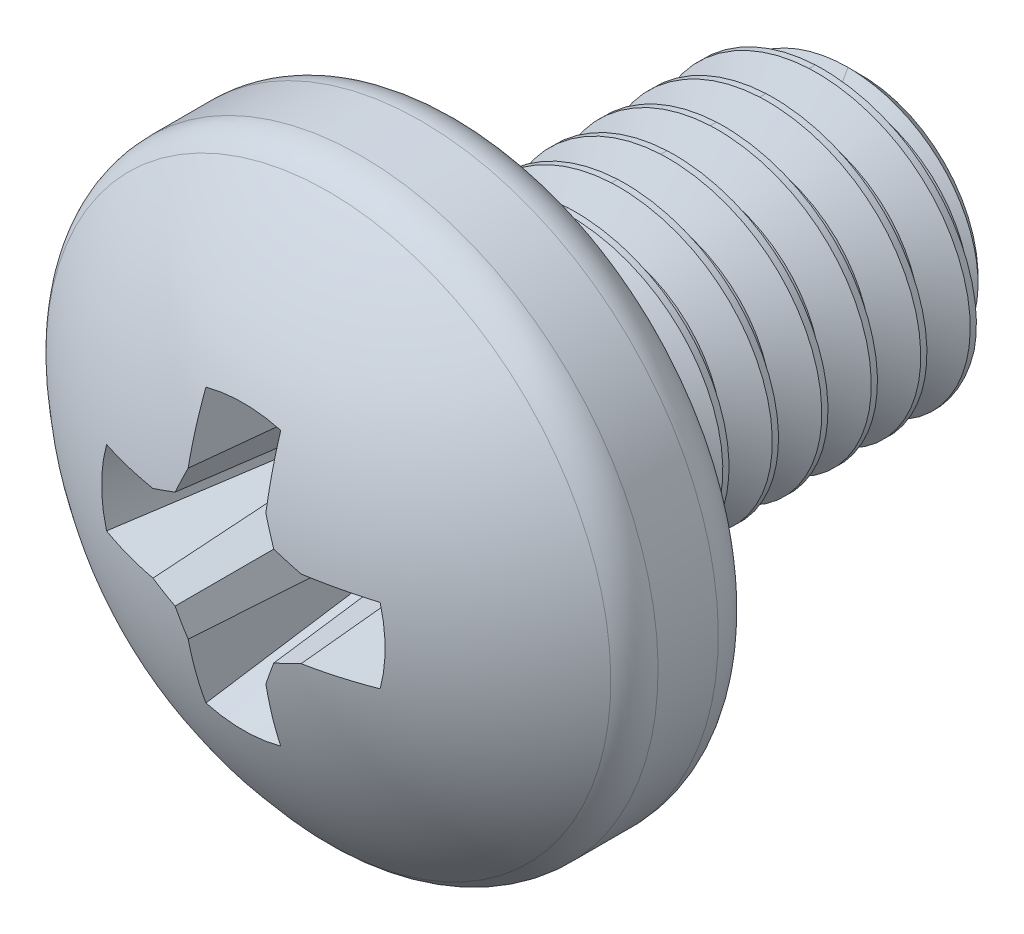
ISO-10303-21;
HEADER;
FILE_DESCRIPTION(('STEP AP214'),'2;1');
FILE_NAME('part.step','',(''),(''),'','','');
FILE_SCHEMA(('AUTOMOTIVE_DESIGN { 1 0 10303 214 1 1 1 1 }'));
ENDSEC;
DATA;
#1=APPLICATION_CONTEXT('core data for automotive mechanical design processes');
#2=APPLICATION_PROTOCOL_DEFINITION('international standard','automotive_design',2000,#1);
#3=PRODUCT_CONTEXT('',#1,'mechanical');
#4=PRODUCT('Part','Part','',(#3));
#5=PRODUCT_RELATED_PRODUCT_CATEGORY('part','',(#4));
#6=PRODUCT_DEFINITION_FORMATION('','',#4);
#7=PRODUCT_DEFINITION_CONTEXT('part definition',#1,'design');
#8=PRODUCT_DEFINITION('design','',#6,#7);
#9=PRODUCT_DEFINITION_SHAPE('','',#8);
#10=(LENGTH_UNIT() NAMED_UNIT(*) SI_UNIT(.MILLI.,.METRE.));
#11=(NAMED_UNIT(*) PLANE_ANGLE_UNIT() SI_UNIT($,.RADIAN.));
#12=(NAMED_UNIT(*) SI_UNIT($,.STERADIAN.) SOLID_ANGLE_UNIT());
#13=UNCERTAINTY_MEASURE_WITH_UNIT(LENGTH_MEASURE(1.E-05),#10,'distance_accuracy_value','');
#14=(GEOMETRIC_REPRESENTATION_CONTEXT(3) GLOBAL_UNCERTAINTY_ASSIGNED_CONTEXT((#13)) GLOBAL_UNIT_ASSIGNED_CONTEXT((#10,
#11,#12)) REPRESENTATION_CONTEXT('',''));
#15=CARTESIAN_POINT('',(0.,0.,0.));
#16=DIRECTION('',(0.,0.,1.));
#17=DIRECTION('',(1.,0.,0.));
#18=AXIS2_PLACEMENT_3D('',#15,#16,#17);
#19=CARTESIAN_POINT('',(0.,0.,0.));
#20=DIRECTION('',(0.,0.,1.));
#21=DIRECTION('',(1.,0.,0.));
#22=AXIS2_PLACEMENT_3D('',#19,#20,#21);
#23=CYLINDRICAL_SURFACE('',#22,1.5);
#24=CARTESIAN_POINT('',(0.,1.5,-0.03125));
#25=CARTESIAN_POINT('',(-0.866025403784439,1.5,0.0104166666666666));
#26=CARTESIAN_POINT('',(-1.29903810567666,0.75,0.0520833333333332));
#27=CARTESIAN_POINT('',(-1.73205080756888,0.,0.0937499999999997));
#28=CARTESIAN_POINT('',(-1.29903810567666,-0.75,0.135416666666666));
#29=CARTESIAN_POINT('',(-0.866025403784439,-1.5,0.177083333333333));
#30=CARTESIAN_POINT('',(0.,-1.5,0.218749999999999));
#31=CARTESIAN_POINT('',(0.866025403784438,-1.5,0.260416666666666));
#32=CARTESIAN_POINT('',(1.29903810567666,-0.750000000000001,0.302083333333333));
#33=CARTESIAN_POINT('',(1.73205080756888,0.,0.343749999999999));
#34=CARTESIAN_POINT('',(1.29903810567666,0.749999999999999,0.385416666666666));
#35=CARTESIAN_POINT('',(0.86602540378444,1.5,0.427083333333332));
#36=CARTESIAN_POINT('',(0.,1.5,0.468749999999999));
#37=CARTESIAN_POINT('',(-0.866025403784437,1.5,0.510416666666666));
#38=CARTESIAN_POINT('',(-1.29903810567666,0.750000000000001,0.552083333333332));
#39=CARTESIAN_POINT('',(-1.73205080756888,0.,0.593749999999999));
#40=CARTESIAN_POINT('',(-1.29903810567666,-0.749999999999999,0.635416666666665));
#41=CARTESIAN_POINT('',(-0.866025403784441,-1.5,0.677083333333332));
#42=CARTESIAN_POINT('',(0.,-1.5,0.718749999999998));
#43=CARTESIAN_POINT('',(0.866025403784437,-1.5,0.760416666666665));
#44=CARTESIAN_POINT('',(1.29903810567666,-0.750000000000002,0.802083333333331));
#45=CARTESIAN_POINT('',(1.73205080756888,0.,0.843749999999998));
#46=CARTESIAN_POINT('',(1.29903810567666,0.749999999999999,0.885416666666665));
#47=CARTESIAN_POINT('',(0.866025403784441,1.5,0.927083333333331));
#48=CARTESIAN_POINT('',(0.,1.5,0.968749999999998));
#49=CARTESIAN_POINT('',(-0.866025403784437,1.5,1.01041666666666));
#50=CARTESIAN_POINT('',(-1.29903810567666,0.750000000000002,1.05208333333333));
#51=CARTESIAN_POINT('',(-1.73205080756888,0.,1.09375));
#52=CARTESIAN_POINT('',(-1.29903810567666,-0.749999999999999,1.13541666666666));
#53=CARTESIAN_POINT('',(-0.866025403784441,-1.5,1.17708333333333));
#54=CARTESIAN_POINT('',(0.,-1.5,1.21875));
#55=CARTESIAN_POINT('',(0.866025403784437,-1.5,1.26041666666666));
#56=CARTESIAN_POINT('',(1.29903810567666,-0.750000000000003,1.30208333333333));
#57=CARTESIAN_POINT('',(1.73205080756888,0.,1.34375));
#58=CARTESIAN_POINT('',(1.29903810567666,0.749999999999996,1.38541666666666));
#59=CARTESIAN_POINT('',(0.866025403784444,1.5,1.42708333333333));
#60=CARTESIAN_POINT('',(0.,1.5,1.46875));
#61=CARTESIAN_POINT('',(-0.866025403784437,1.5,1.51041666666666));
#62=CARTESIAN_POINT('',(-1.29903810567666,0.750000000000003,1.55208333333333));
#63=CARTESIAN_POINT('',(-1.73205080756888,0.,1.59375));
#64=CARTESIAN_POINT('',(-1.29903810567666,-0.749999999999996,1.63541666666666));
#65=CARTESIAN_POINT('',(-0.866025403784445,-1.5,1.67708333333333));
#66=CARTESIAN_POINT('',(0.,-1.5,1.71875));
#67=CARTESIAN_POINT('',(0.866025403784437,-1.5,1.76041666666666));
#68=CARTESIAN_POINT('',(1.29903810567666,-0.750000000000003,1.80208333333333));
#69=CARTESIAN_POINT('',(1.73205080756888,0.,1.84375));
#70=CARTESIAN_POINT('',(1.29903810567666,0.749999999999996,1.88541666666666));
#71=CARTESIAN_POINT('',(0.866025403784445,1.5,1.92708333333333));
#72=CARTESIAN_POINT('',(0.,1.5,1.96875));
#73=CARTESIAN_POINT('',(-0.866025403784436,1.5,2.01041666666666));
#74=CARTESIAN_POINT('',(-1.29903810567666,0.750000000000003,2.05208333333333));
#75=CARTESIAN_POINT('',(-1.73205080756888,0.,2.09375));
#76=CARTESIAN_POINT('',(-1.29903810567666,-0.749999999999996,2.13541666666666));
#77=CARTESIAN_POINT('',(-0.866025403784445,-1.5,2.17708333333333));
#78=CARTESIAN_POINT('',(0.,-1.5,2.21875));
#79=CARTESIAN_POINT('',(0.866025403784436,-1.5,2.26041666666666));
#80=CARTESIAN_POINT('',(1.29903810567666,-0.750000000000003,2.30208333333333));
#81=CARTESIAN_POINT('',(1.73205080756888,0.,2.34374999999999));
#82=CARTESIAN_POINT('',(1.29903810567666,0.749999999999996,2.38541666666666));
#83=CARTESIAN_POINT('',(0.866025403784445,1.5,2.42708333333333));
#84=CARTESIAN_POINT('',(0.,1.5,2.46874999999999));
#85=CARTESIAN_POINT('',(-0.866025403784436,1.5,2.51041666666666));
#86=CARTESIAN_POINT('',(-1.29903810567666,0.750000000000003,2.55208333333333));
#87=CARTESIAN_POINT('',(-1.73205080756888,0.,2.59374999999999));
#88=CARTESIAN_POINT('',(-1.29903810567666,-0.749999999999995,2.63541666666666));
#89=CARTESIAN_POINT('',(-0.86602540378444,-1.5,2.67708333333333));
#90=CARTESIAN_POINT('',(0.,-1.5,2.71874999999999));
#91=CARTESIAN_POINT('',(0.866025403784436,-1.5,2.76041666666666));
#92=CARTESIAN_POINT('',(1.29903810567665,-0.750000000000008,2.80208333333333));
#93=CARTESIAN_POINT('',(1.73205080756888,0.,2.84374999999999));
#94=CARTESIAN_POINT('',(1.29903810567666,0.749999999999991,2.88541666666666));
#95=CARTESIAN_POINT('',(0.866025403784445,1.5,2.92708333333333));
#96=CARTESIAN_POINT('',(0.,1.5,2.96874999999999));
#97=CARTESIAN_POINT('',(-0.86602540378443,1.50000000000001,3.01041666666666));
#98=CARTESIAN_POINT('',(-1.29903810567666,0.750000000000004,3.05208333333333));
#99=CARTESIAN_POINT('',(-1.73205080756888,0.,3.09374999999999));
#100=CARTESIAN_POINT('',(-1.29903810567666,-0.749999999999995,3.13541666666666));
#101=CARTESIAN_POINT('',(-0.86602540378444,-1.5,3.17708333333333));
#102=CARTESIAN_POINT('',(0.,-1.5,3.21874999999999));
#103=CARTESIAN_POINT('',(0.866025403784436,-1.5,3.26041666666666));
#104=CARTESIAN_POINT('',(1.29903810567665,-0.750000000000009,3.30208333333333));
#105=CARTESIAN_POINT('',(1.73205080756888,0.,3.34374999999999));
#106=CARTESIAN_POINT('',(1.29903810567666,0.74999999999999,3.38541666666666));
#107=CARTESIAN_POINT('',(0.866025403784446,1.5,3.42708333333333));
#108=CARTESIAN_POINT('',(0.,1.5,3.46874999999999));
#109=CARTESIAN_POINT('',(-0.86602540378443,1.50000000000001,3.51041666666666));
#110=CARTESIAN_POINT('',(-1.29903810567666,0.750000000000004,3.55208333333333));
#111=CARTESIAN_POINT('',(-1.73205080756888,0.,3.59374999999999));
#112=CARTESIAN_POINT('',(-1.29903810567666,-0.749999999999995,3.63541666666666));
#113=CARTESIAN_POINT('',(-0.866025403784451,-1.49999999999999,3.67708333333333));
#114=CARTESIAN_POINT('',(0.,-1.5,3.71874999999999));
#115=CARTESIAN_POINT('',(0.866025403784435,-1.5,3.76041666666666));
#116=CARTESIAN_POINT('',(1.29903810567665,-0.750000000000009,3.80208333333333));
#117=CARTESIAN_POINT('',(1.73205080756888,0.,3.84374999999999));
#118=CARTESIAN_POINT('',(1.29903810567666,0.74999999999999,3.88541666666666));
#119=CARTESIAN_POINT('',(0.866025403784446,1.5,3.92708333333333));
#120=CARTESIAN_POINT('',(0.,1.5,3.96874999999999));
#121=CARTESIAN_POINT('',(-0.86602540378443,1.50000000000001,4.01041666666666));
#122=CARTESIAN_POINT('',(-1.29903810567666,0.750000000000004,4.05208333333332));
#123=CARTESIAN_POINT('',(-1.73205080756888,0.,4.09374999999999));
#124=CARTESIAN_POINT('',(-1.29903810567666,-0.749999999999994,4.13541666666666));
#125=CARTESIAN_POINT('',(-0.866025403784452,-1.49999999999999,4.17708333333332));
#126=CARTESIAN_POINT('',(0.,-1.5,4.21874999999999));
#127=CARTESIAN_POINT('',(0.866025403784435,-1.5,4.26041666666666));
#128=CARTESIAN_POINT('',(1.29903810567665,-0.750000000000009,4.30208333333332));
#129=CARTESIAN_POINT('',(1.73205080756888,0.,4.34374999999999));
#130=CARTESIAN_POINT('',(1.29903810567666,0.74999999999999,4.38541666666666));
#131=CARTESIAN_POINT('',(0.866025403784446,1.5,4.42708333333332));
#132=CARTESIAN_POINT('',(0.,1.5,4.46874999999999));
#133=CARTESIAN_POINT('',(-0.866025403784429,1.50000000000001,4.51041666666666));
#134=CARTESIAN_POINT('',(-1.29903810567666,0.750000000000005,4.55208333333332));
#135=CARTESIAN_POINT('',(-1.73205080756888,0.,4.59374999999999));
#136=CARTESIAN_POINT('',(-1.29903810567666,-0.749999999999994,4.63541666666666));
#137=CARTESIAN_POINT('',(-0.866025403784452,-1.49999999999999,4.67708333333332));
#138=CARTESIAN_POINT('',(0.,-1.5,4.71874999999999));
#139=CARTESIAN_POINT('',(0.866025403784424,-1.50000000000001,4.76041666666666));
#140=CARTESIAN_POINT('',(1.29903810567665,-0.750000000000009,4.80208333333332));
#141=CARTESIAN_POINT('',(1.73205080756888,0.,4.84374999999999));
#142=CARTESIAN_POINT('',(1.29903810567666,0.749999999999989,4.88541666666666));
#143=CARTESIAN_POINT('',(0.866025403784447,1.5,4.92708333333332));
#144=CARTESIAN_POINT('',(0.,1.5,4.96874999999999));
#145=(BOUNDED_CURVE() B_SPLINE_CURVE(2,(#24,#25,#26,#27,#28,#29,#30,#31,#32,#33,#34,#35,#36,#37,
#38,#39,#40,#41,#42,#43,#44,#45,#46,#47,#48,#49,#50,#51,#52,#53,#54,#55,#56,#57,#58,#59,#60,#61,
#62,#63,#64,#65,#66,#67,#68,#69,#70,#71,#72,#73,#74,#75,#76,#77,#78,#79,#80,#81,#82,#83,#84,#85,
#86,#87,#88,#89,#90,#91,#92,#93,#94,#95,#96,#97,#98,#99,#100,#101,#102,#103,#104,#105,#106,#107,
#108,#109,#110,#111,#112,#113,#114,#115,#116,#117,#118,#119,#120,#121,#122,#123,#124,#125,#126,
#127,#128,#129,#130,#131,#132,#133,#134,#135,#136,#137,#138,#139,#140,#141,#142,#143,#144),
.UNSPECIFIED.,.F.,.F.) B_SPLINE_CURVE_WITH_KNOTS((3,2,2,2,2,2,2,2,2,2,2,2,2,2,2,2,2,2,2,2,2,2,2,
2,2,2,2,2,2,2,2,2,2,2,2,2,2,2,2,2,2,2,2,2,2,2,2,2,2,2,2,2,2,2,2,2,2,2,2,2,3),(0.,
0.0166666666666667,0.0333333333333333,0.05,0.0666666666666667,0.0833333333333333,0.1,
0.116666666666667,0.133333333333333,0.15,0.166666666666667,0.183333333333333,0.2,
0.216666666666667,0.233333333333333,0.25,0.266666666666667,0.283333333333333,0.3,
0.316666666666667,0.333333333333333,0.35,0.366666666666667,0.383333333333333,0.4,
0.416666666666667,0.433333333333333,0.45,0.466666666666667,0.483333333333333,0.5,
0.516666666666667,0.533333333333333,0.55,0.566666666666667,0.583333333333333,0.6,
0.616666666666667,0.633333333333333,0.65,0.666666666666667,0.683333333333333,0.7,
0.716666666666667,0.733333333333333,0.75,0.766666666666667,0.783333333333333,0.8,
0.816666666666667,0.833333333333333,0.85,0.866666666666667,0.883333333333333,0.9,
0.916666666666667,0.933333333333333,0.95,0.966666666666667,0.983333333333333,1.),
.UNSPECIFIED.) CURVE() GEOMETRIC_REPRESENTATION_ITEM() RATIONAL_B_SPLINE_CURVE((1.,
0.866025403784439,1.,0.866025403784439,1.,0.866025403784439,1.,0.866025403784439,1.,
0.866025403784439,1.,0.866025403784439,1.,0.866025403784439,1.,0.866025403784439,1.,
0.866025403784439,1.,0.866025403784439,1.,0.866025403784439,1.,0.866025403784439,1.,
0.866025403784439,1.,0.866025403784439,1.,0.866025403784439,1.,0.866025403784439,1.,
0.866025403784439,1.,0.866025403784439,1.,0.866025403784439,1.,0.866025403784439,1.,
0.866025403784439,1.,0.866025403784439,1.,0.866025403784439,1.,0.866025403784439,1.,
0.866025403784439,1.,0.866025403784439,1.,0.866025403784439,1.,0.866025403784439,1.,
0.866025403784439,1.,0.866025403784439,1.,0.866025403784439,1.,0.866025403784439,1.,
0.866025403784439,1.,0.866025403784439,1.,0.866025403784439,1.,0.866025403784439,1.,
0.866025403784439,1.,0.866025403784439,1.,0.866025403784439,1.,0.866025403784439,1.,
0.866025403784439,1.,0.866025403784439,1.,0.866025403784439,1.,0.866025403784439,1.,
0.866025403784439,1.,0.866025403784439,1.,0.866025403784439,1.,0.866025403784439,1.,
0.866025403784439,1.,0.866025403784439,1.,0.866025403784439,1.,0.866025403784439,1.,
0.866025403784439,1.,0.866025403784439,1.,0.866025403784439,1.,0.866025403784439,1.,
0.866025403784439,1.,0.866025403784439,1.,0.866025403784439,1.,0.866025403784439,1.)) REPRESENTATION_ITEM(''));
#146=CARTESIAN_POINT('',(0.,1.5,3.46874999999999));
#147=VERTEX_POINT('',#146);
#148=CARTESIAN_POINT('',(0.,-1.5,3.71874999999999));
#149=VERTEX_POINT('',#148);
#150=EDGE_CURVE('E882',#147,#149,#145,.T.);
#151=ORIENTED_EDGE('',*,*,#150,.T.);
#152=DIRECTION('',(0.,0.,1.));
#153=VECTOR('',#152,1.);
#154=CARTESIAN_POINT('',(0.,-1.5,0.));
#155=LINE('',#154,#153);
#156=CARTESIAN_POINT('',(0.,-1.5,3.78124999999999));
#157=VERTEX_POINT('',#156);
#158=EDGE_CURVE('E11',#149,#157,#155,.T.);
#159=ORIENTED_EDGE('',*,*,#158,.T.);
#160=CARTESIAN_POINT('',(0.,1.5,0.03125));
#161=CARTESIAN_POINT('',(-0.866025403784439,1.5,0.0729166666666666));
#162=CARTESIAN_POINT('',(-1.29903810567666,0.75,0.114583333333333));
#163=CARTESIAN_POINT('',(-1.73205080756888,0.,0.15625));
#164=CARTESIAN_POINT('',(-1.29903810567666,-0.75,0.197916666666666));
#165=CARTESIAN_POINT('',(-0.866025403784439,-1.5,0.239583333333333));
#166=CARTESIAN_POINT('',(0.,-1.5,0.28125));
#167=CARTESIAN_POINT('',(0.866025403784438,-1.5,0.322916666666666));
#168=CARTESIAN_POINT('',(1.29903810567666,-0.750000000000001,0.364583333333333));
#169=CARTESIAN_POINT('',(1.73205080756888,0.,0.406249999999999));
#170=CARTESIAN_POINT('',(1.29903810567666,0.749999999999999,0.447916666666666));
#171=CARTESIAN_POINT('',(0.86602540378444,1.5,0.489583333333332));
#172=CARTESIAN_POINT('',(0.,1.5,0.531249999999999));
#173=CARTESIAN_POINT('',(-0.866025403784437,1.5,0.572916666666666));
#174=CARTESIAN_POINT('',(-1.29903810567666,0.750000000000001,0.614583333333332));
#175=CARTESIAN_POINT('',(-1.73205080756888,0.,0.656249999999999));
#176=CARTESIAN_POINT('',(-1.29903810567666,-0.749999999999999,0.697916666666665));
#177=CARTESIAN_POINT('',(-0.866025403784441,-1.5,0.739583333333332));
#178=CARTESIAN_POINT('',(0.,-1.5,0.781249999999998));
#179=CARTESIAN_POINT('',(0.866025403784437,-1.5,0.822916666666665));
#180=CARTESIAN_POINT('',(1.29903810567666,-0.750000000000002,0.864583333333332));
#181=CARTESIAN_POINT('',(1.73205080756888,0.,0.906249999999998));
#182=CARTESIAN_POINT('',(1.29903810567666,0.749999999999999,0.947916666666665));
#183=CARTESIAN_POINT('',(0.866025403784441,1.5,0.989583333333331));
#184=CARTESIAN_POINT('',(0.,1.5,1.03125));
#185=CARTESIAN_POINT('',(-0.866025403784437,1.5,1.07291666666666));
#186=CARTESIAN_POINT('',(-1.29903810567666,0.750000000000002,1.11458333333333));
#187=CARTESIAN_POINT('',(-1.73205080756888,0.,1.15625));
#188=CARTESIAN_POINT('',(-1.29903810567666,-0.749999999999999,1.19791666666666));
#189=CARTESIAN_POINT('',(-0.866025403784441,-1.5,1.23958333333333));
#190=CARTESIAN_POINT('',(0.,-1.5,1.28125));
#191=CARTESIAN_POINT('',(0.866025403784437,-1.5,1.32291666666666));
#192=CARTESIAN_POINT('',(1.29903810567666,-0.750000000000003,1.36458333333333));
#193=CARTESIAN_POINT('',(1.73205080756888,0.,1.40625));
#194=CARTESIAN_POINT('',(1.29903810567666,0.749999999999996,1.44791666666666));
#195=CARTESIAN_POINT('',(0.866025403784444,1.5,1.48958333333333));
#196=CARTESIAN_POINT('',(0.,1.5,1.53125));
#197=CARTESIAN_POINT('',(-0.866025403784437,1.5,1.57291666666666));
#198=CARTESIAN_POINT('',(-1.29903810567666,0.750000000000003,1.61458333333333));
#199=CARTESIAN_POINT('',(-1.73205080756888,0.,1.65625));
#200=CARTESIAN_POINT('',(-1.29903810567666,-0.749999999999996,1.69791666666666));
#201=CARTESIAN_POINT('',(-0.866025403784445,-1.5,1.73958333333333));
#202=CARTESIAN_POINT('',(0.,-1.5,1.78125));
#203=CARTESIAN_POINT('',(0.866025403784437,-1.5,1.82291666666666));
#204=CARTESIAN_POINT('',(1.29903810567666,-0.750000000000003,1.86458333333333));
#205=CARTESIAN_POINT('',(1.73205080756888,0.,1.90625));
#206=CARTESIAN_POINT('',(1.29903810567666,0.749999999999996,1.94791666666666));
#207=CARTESIAN_POINT('',(0.866025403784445,1.5,1.98958333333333));
#208=CARTESIAN_POINT('',(0.,1.5,2.03125));
#209=CARTESIAN_POINT('',(-0.866025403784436,1.5,2.07291666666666));
#210=CARTESIAN_POINT('',(-1.29903810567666,0.750000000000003,2.11458333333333));
#211=CARTESIAN_POINT('',(-1.73205080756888,0.,2.15625));
#212=CARTESIAN_POINT('',(-1.29903810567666,-0.749999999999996,2.19791666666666));
#213=CARTESIAN_POINT('',(-0.866025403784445,-1.5,2.23958333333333));
#214=CARTESIAN_POINT('',(0.,-1.5,2.28125));
#215=CARTESIAN_POINT('',(0.866025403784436,-1.5,2.32291666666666));
#216=CARTESIAN_POINT('',(1.29903810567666,-0.750000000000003,2.36458333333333));
#217=CARTESIAN_POINT('',(1.73205080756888,0.,2.40624999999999));
#218=CARTESIAN_POINT('',(1.29903810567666,0.749999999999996,2.44791666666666));
#219=CARTESIAN_POINT('',(0.866025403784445,1.5,2.48958333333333));
#220=CARTESIAN_POINT('',(0.,1.5,2.53124999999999));
#221=CARTESIAN_POINT('',(-0.866025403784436,1.5,2.57291666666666));
#222=CARTESIAN_POINT('',(-1.29903810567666,0.750000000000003,2.61458333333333));
#223=CARTESIAN_POINT('',(-1.73205080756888,0.,2.65624999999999));
#224=CARTESIAN_POINT('',(-1.29903810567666,-0.749999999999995,2.69791666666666));
#225=CARTESIAN_POINT('',(-0.86602540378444,-1.5,2.73958333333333));
#226=CARTESIAN_POINT('',(0.,-1.5,2.78124999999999));
#227=CARTESIAN_POINT('',(0.866025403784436,-1.5,2.82291666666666));
#228=CARTESIAN_POINT('',(1.29903810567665,-0.750000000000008,2.86458333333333));
#229=CARTESIAN_POINT('',(1.73205080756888,0.,2.90624999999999));
#230=CARTESIAN_POINT('',(1.29903810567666,0.749999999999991,2.94791666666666));
#231=CARTESIAN_POINT('',(0.866025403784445,1.5,2.98958333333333));
#232=CARTESIAN_POINT('',(0.,1.5,3.03124999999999));
#233=CARTESIAN_POINT('',(-0.86602540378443,1.50000000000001,3.07291666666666));
#234=CARTESIAN_POINT('',(-1.29903810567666,0.750000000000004,3.11458333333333));
#235=CARTESIAN_POINT('',(-1.73205080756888,0.,3.15624999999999));
#236=CARTESIAN_POINT('',(-1.29903810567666,-0.749999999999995,3.19791666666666));
#237=CARTESIAN_POINT('',(-0.86602540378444,-1.5,3.23958333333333));
#238=CARTESIAN_POINT('',(0.,-1.5,3.28124999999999));
#239=CARTESIAN_POINT('',(0.866025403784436,-1.5,3.32291666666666));
#240=CARTESIAN_POINT('',(1.29903810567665,-0.750000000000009,3.36458333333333));
#241=CARTESIAN_POINT('',(1.73205080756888,0.,3.40624999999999));
#242=CARTESIAN_POINT('',(1.29903810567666,0.74999999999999,3.44791666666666));
#243=CARTESIAN_POINT('',(0.866025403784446,1.5,3.48958333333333));
#244=CARTESIAN_POINT('',(0.,1.5,3.53124999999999));
#245=CARTESIAN_POINT('',(-0.86602540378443,1.50000000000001,3.57291666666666));
#246=CARTESIAN_POINT('',(-1.29903810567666,0.750000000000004,3.61458333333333));
#247=CARTESIAN_POINT('',(-1.73205080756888,0.,3.65624999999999));
#248=CARTESIAN_POINT('',(-1.29903810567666,-0.749999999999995,3.69791666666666));
#249=CARTESIAN_POINT('',(-0.866025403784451,-1.49999999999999,3.73958333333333));
#250=CARTESIAN_POINT('',(0.,-1.5,3.78124999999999));
#251=CARTESIAN_POINT('',(0.866025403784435,-1.5,3.82291666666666));
#252=CARTESIAN_POINT('',(1.29903810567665,-0.750000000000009,3.86458333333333));
#253=CARTESIAN_POINT('',(1.73205080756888,0.,3.90624999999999));
#254=CARTESIAN_POINT('',(1.29903810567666,0.74999999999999,3.94791666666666));
#255=CARTESIAN_POINT('',(0.866025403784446,1.5,3.98958333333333));
#256=CARTESIAN_POINT('',(0.,1.5,4.03124999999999));
#257=CARTESIAN_POINT('',(-0.86602540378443,1.50000000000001,4.07291666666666));
#258=CARTESIAN_POINT('',(-1.29903810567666,0.750000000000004,4.11458333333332));
#259=CARTESIAN_POINT('',(-1.73205080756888,0.,4.15624999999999));
#260=CARTESIAN_POINT('',(-1.29903810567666,-0.749999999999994,4.19791666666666));
#261=CARTESIAN_POINT('',(-0.866025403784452,-1.49999999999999,4.23958333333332));
#262=CARTESIAN_POINT('',(0.,-1.5,4.28124999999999));
#263=CARTESIAN_POINT('',(0.866025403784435,-1.5,4.32291666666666));
#264=CARTESIAN_POINT('',(1.29903810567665,-0.750000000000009,4.36458333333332));
#265=CARTESIAN_POINT('',(1.73205080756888,0.,4.40624999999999));
#266=CARTESIAN_POINT('',(1.29903810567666,0.74999999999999,4.44791666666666));
#267=CARTESIAN_POINT('',(0.866025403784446,1.5,4.48958333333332));
#268=CARTESIAN_POINT('',(0.,1.5,4.53124999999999));
#269=CARTESIAN_POINT('',(-0.866025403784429,1.50000000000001,4.57291666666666));
#270=CARTESIAN_POINT('',(-1.29903810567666,0.750000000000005,4.61458333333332));
#271=CARTESIAN_POINT('',(-1.73205080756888,0.,4.65624999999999));
#272=CARTESIAN_POINT('',(-1.29903810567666,-0.749999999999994,4.69791666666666));
#273=CARTESIAN_POINT('',(-0.866025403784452,-1.49999999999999,4.73958333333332));
#274=CARTESIAN_POINT('',(0.,-1.5,4.78124999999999));
#275=CARTESIAN_POINT('',(0.866025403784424,-1.50000000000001,4.82291666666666));
#276=CARTESIAN_POINT('',(1.29903810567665,-0.750000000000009,4.86458333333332));
#277=CARTESIAN_POINT('',(1.73205080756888,0.,4.90624999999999));
#278=CARTESIAN_POINT('',(1.29903810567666,0.749999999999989,4.94791666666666));
#279=CARTESIAN_POINT('',(0.866025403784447,1.5,4.98958333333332));
#280=CARTESIAN_POINT('',(0.,1.5,5.03124999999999));
#281=(BOUNDED_CURVE() B_SPLINE_CURVE(2,(#160,#161,#162,#163,#164,#165,#166,#167,#168,#169,#170,
#171,#172,#173,#174,#175,#176,#177,#178,#179,#180,#181,#182,#183,#184,#185,#186,#187,#188,#189,
#190,#191,#192,#193,#194,#195,#196,#197,#198,#199,#200,#201,#202,#203,#204,#205,#206,#207,#208,
#209,#210,#211,#212,#213,#214,#215,#216,#217,#218,#219,#220,#221,#222,#223,#224,#225,#226,#227,
#228,#229,#230,#231,#232,#233,#234,#235,#236,#237,#238,#239,#240,#241,#242,#243,#244,#245,#246,
#247,#248,#249,#250,#251,#252,#253,#254,#255,#256,#257,#258,#259,#260,#261,#262,#263,#264,#265,
#266,#267,#268,#269,#270,#271,#272,#273,#274,#275,#276,#277,#278,#279,#280),.UNSPECIFIED.,.F.,
.F.) B_SPLINE_CURVE_WITH_KNOTS((3,2,2,2,2,2,2,2,2,2,2,2,2,2,2,2,2,2,2,2,2,2,2,2,2,2,2,2,2,2,2,2,
2,2,2,2,2,2,2,2,2,2,2,2,2,2,2,2,2,2,2,2,2,2,2,2,2,2,2,2,3),(0.,0.0166666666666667,
0.0333333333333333,0.05,0.0666666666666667,0.0833333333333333,0.1,0.116666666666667,
0.133333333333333,0.15,0.166666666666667,0.183333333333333,0.2,0.216666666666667,
0.233333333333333,0.25,0.266666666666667,0.283333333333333,0.3,0.316666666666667,
0.333333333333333,0.35,0.366666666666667,0.383333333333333,0.4,0.416666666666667,
0.433333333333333,0.45,0.466666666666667,0.483333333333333,0.5,0.516666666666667,
0.533333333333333,0.55,0.566666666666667,0.583333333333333,0.6,0.616666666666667,
0.633333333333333,0.65,0.666666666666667,0.683333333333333,0.7,0.716666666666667,
0.733333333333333,0.75,0.766666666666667,0.783333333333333,0.8,0.816666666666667,
0.833333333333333,0.85,0.866666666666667,0.883333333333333,0.9,0.916666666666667,
0.933333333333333,0.95,0.966666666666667,0.983333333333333,1.),
.UNSPECIFIED.) CURVE() GEOMETRIC_REPRESENTATION_ITEM() RATIONAL_B_SPLINE_CURVE((1.,
0.866025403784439,1.,0.866025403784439,1.,0.866025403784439,1.,0.866025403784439,1.,
0.866025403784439,1.,0.866025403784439,1.,0.866025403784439,1.,0.866025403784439,1.,
0.866025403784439,1.,0.866025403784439,1.,0.866025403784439,1.,0.866025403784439,1.,
0.866025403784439,1.,0.866025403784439,1.,0.866025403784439,1.,0.866025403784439,1.,
0.866025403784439,1.,0.866025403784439,1.,0.866025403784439,1.,0.866025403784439,1.,
0.866025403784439,1.,0.866025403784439,1.,0.866025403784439,1.,0.866025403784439,1.,
0.866025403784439,1.,0.866025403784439,1.,0.866025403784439,1.,0.866025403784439,1.,
0.866025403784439,1.,0.866025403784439,1.,0.866025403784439,1.,0.866025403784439,1.,
0.866025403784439,1.,0.866025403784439,1.,0.866025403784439,1.,0.866025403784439,1.,
0.866025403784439,1.,0.866025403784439,1.,0.866025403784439,1.,0.866025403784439,1.,
0.866025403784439,1.,0.866025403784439,1.,0.866025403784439,1.,0.866025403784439,1.,
0.866025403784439,1.,0.866025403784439,1.,0.866025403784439,1.,0.866025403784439,1.,
0.866025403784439,1.,0.866025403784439,1.,0.866025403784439,1.,0.866025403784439,1.,
0.866025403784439,1.,0.866025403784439,1.,0.866025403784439,1.,0.866025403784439,1.,
0.866025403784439,1.,0.866025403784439,1.,0.866025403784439,1.,0.866025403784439,1.)) REPRESENTATION_ITEM(''));
#282=CARTESIAN_POINT('',(0.,1.5,3.53124999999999));
#283=VERTEX_POINT('',#282);
#284=EDGE_CURVE('E944',#283,#157,#281,.T.);
#285=ORIENTED_EDGE('',*,*,#284,.F.);
#286=DIRECTION('',(0.,0.,-1.));
#287=VECTOR('',#286,1.);
#288=CARTESIAN_POINT('',(0.,1.5,0.));
#289=LINE('',#288,#287);
#290=EDGE_CURVE('E973',#283,#147,#289,.T.);
#291=ORIENTED_EDGE('',*,*,#290,.T.);
#292=EDGE_LOOP('',(#151,#159,#285,#291));
#293=FACE_BOUND('',#292,.T.);
#294=ADVANCED_FACE('F40',(#293),#23,.T.);
#295=CARTESIAN_POINT('',(0.,1.5,2.96874999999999));
#296=VERTEX_POINT('',#295);
#297=CARTESIAN_POINT('',(0.,-1.5,3.21874999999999));
#298=VERTEX_POINT('',#297);
#299=EDGE_CURVE('E873',#296,#298,#145,.T.);
#300=ORIENTED_EDGE('',*,*,#299,.T.);
#301=CARTESIAN_POINT('',(0.,-1.5,3.28124999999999));
#302=VERTEX_POINT('',#301);
#303=EDGE_CURVE('E50',#298,#302,#155,.T.);
#304=ORIENTED_EDGE('',*,*,#303,.T.);
#305=CARTESIAN_POINT('',(0.,1.5,3.03124999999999));
#306=VERTEX_POINT('',#305);
#307=EDGE_CURVE('E962',#306,#302,#281,.T.);
#308=ORIENTED_EDGE('',*,*,#307,.F.);
#309=EDGE_CURVE('E975',#306,#296,#289,.T.);
#310=ORIENTED_EDGE('',*,*,#309,.T.);
#311=EDGE_LOOP('',(#300,#304,#308,#310));
#312=FACE_BOUND('',#311,.T.);
#313=ADVANCED_FACE('F798',(#312),#23,.T.);
#314=CARTESIAN_POINT('',(0.,1.5,2.46874999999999));
#315=VERTEX_POINT('',#314);
#316=CARTESIAN_POINT('',(0.,-1.5,2.71874999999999));
#317=VERTEX_POINT('',#316);
#318=EDGE_CURVE('E863',#315,#317,#145,.T.);
#319=ORIENTED_EDGE('',*,*,#318,.T.);
#320=CARTESIAN_POINT('',(0.,-1.5,2.78124999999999));
#321=VERTEX_POINT('',#320);
#322=EDGE_CURVE('E994',#317,#321,#155,.T.);
#323=ORIENTED_EDGE('',*,*,#322,.T.);
#324=CARTESIAN_POINT('',(0.,1.5,2.53124999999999));
#325=VERTEX_POINT('',#324);
#326=EDGE_CURVE('E958',#325,#321,#281,.T.);
#327=ORIENTED_EDGE('',*,*,#326,.F.);
#328=EDGE_CURVE('E998',#325,#315,#289,.T.);
#329=ORIENTED_EDGE('',*,*,#328,.T.);
#330=EDGE_LOOP('',(#319,#323,#327,#329));
#331=FACE_BOUND('',#330,.T.);
#332=ADVANCED_FACE('F803',(#331),#23,.T.);
#333=CARTESIAN_POINT('',(0.,1.5,1.96875));
#334=VERTEX_POINT('',#333);
#335=CARTESIAN_POINT('',(0.,-1.5,2.21875));
#336=VERTEX_POINT('',#335);
#337=EDGE_CURVE('E853',#334,#336,#145,.T.);
#338=ORIENTED_EDGE('',*,*,#337,.T.);
#339=CARTESIAN_POINT('',(0.,-1.5,2.28125));
#340=VERTEX_POINT('',#339);
#341=EDGE_CURVE('E1003',#336,#340,#155,.T.);
#342=ORIENTED_EDGE('',*,*,#341,.T.);
#343=CARTESIAN_POINT('',(0.,1.5,2.03125));
#344=VERTEX_POINT('',#343);
#345=EDGE_CURVE('E953',#344,#340,#281,.T.);
#346=ORIENTED_EDGE('',*,*,#345,.F.);
#347=EDGE_CURVE('E1008',#344,#334,#289,.T.);
#348=ORIENTED_EDGE('',*,*,#347,.T.);
#349=EDGE_LOOP('',(#338,#342,#346,#348));
#350=FACE_BOUND('',#349,.T.);
#351=ADVANCED_FACE('F1045',(#350),#23,.T.);
#352=CARTESIAN_POINT('',(0.,1.5,1.46875));
#353=VERTEX_POINT('',#352);
#354=CARTESIAN_POINT('',(0.,-1.5,1.71875));
#355=VERTEX_POINT('',#354);
#356=EDGE_CURVE('E845',#353,#355,#145,.T.);
#357=ORIENTED_EDGE('',*,*,#356,.T.);
#358=CARTESIAN_POINT('',(0.,-1.5,1.78125));
#359=VERTEX_POINT('',#358);
#360=EDGE_CURVE('E1012',#355,#359,#155,.T.);
#361=ORIENTED_EDGE('',*,*,#360,.T.);
#362=CARTESIAN_POINT('',(0.,1.5,1.53125));
#363=VERTEX_POINT('',#362);
#364=EDGE_CURVE('E947',#363,#359,#281,.T.);
#365=ORIENTED_EDGE('',*,*,#364,.F.);
#366=EDGE_CURVE('E1017',#363,#353,#289,.T.);
#367=ORIENTED_EDGE('',*,*,#366,.T.);
#368=EDGE_LOOP('',(#357,#361,#365,#367));
#369=FACE_BOUND('',#368,.T.);
#370=ADVANCED_FACE('F1040',(#369),#23,.T.);
#371=CARTESIAN_POINT('',(0.,1.5,0.968749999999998));
#372=VERTEX_POINT('',#371);
#373=CARTESIAN_POINT('',(0.,-1.5,1.21875));
#374=VERTEX_POINT('',#373);
#375=EDGE_CURVE('E839',#372,#374,#145,.T.);
#376=ORIENTED_EDGE('',*,*,#375,.T.);
#377=CARTESIAN_POINT('',(0.,-1.5,1.28125));
#378=VERTEX_POINT('',#377);
#379=EDGE_CURVE('E832',#374,#378,#155,.T.);
#380=ORIENTED_EDGE('',*,*,#379,.T.);
#381=CARTESIAN_POINT('',(0.,1.5,1.03125));
#382=VERTEX_POINT('',#381);
#383=EDGE_CURVE('E942',#382,#378,#281,.T.);
#384=ORIENTED_EDGE('',*,*,#383,.F.);
#385=EDGE_CURVE('E941',#382,#372,#289,.T.);
#386=ORIENTED_EDGE('',*,*,#385,.T.);
#387=EDGE_LOOP('',(#376,#380,#384,#386));
#388=FACE_BOUND('',#387,.T.);
#389=ADVANCED_FACE('F1037',(#388),#23,.T.);
#390=CARTESIAN_POINT('',(0.,1.5,0.468749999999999));
#391=VERTEX_POINT('',#390);
#392=CARTESIAN_POINT('',(0.,-1.5,0.718749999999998));
#393=VERTEX_POINT('',#392);
#394=EDGE_CURVE('E404',#391,#393,#145,.T.);
#395=ORIENTED_EDGE('',*,*,#394,.T.);
#396=CARTESIAN_POINT('',(0.,-1.5,0.781249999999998));
#397=VERTEX_POINT('',#396);
#398=EDGE_CURVE('E44',#393,#397,#155,.T.);
#399=ORIENTED_EDGE('',*,*,#398,.T.);
#400=CARTESIAN_POINT('',(0.,1.5,0.531249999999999));
#401=VERTEX_POINT('',#400);
#402=EDGE_CURVE('E911',#401,#397,#281,.T.);
#403=ORIENTED_EDGE('',*,*,#402,.F.);
#404=EDGE_CURVE('E605',#401,#391,#289,.T.);
#405=ORIENTED_EDGE('',*,*,#404,.T.);
#406=EDGE_LOOP('',(#395,#399,#403,#405));
#407=FACE_BOUND('',#406,.T.);
#408=ADVANCED_FACE('F843',(#407),#23,.T.);
#409=CARTESIAN_POINT('',(0.,0.,4.));
#410=DIRECTION('',(0.,0.,1.));
#411=DIRECTION('',(1.,0.,0.));
#412=AXIS2_PLACEMENT_3D('',#409,#410,#411);
#413=CIRCLE('',#412,1.5);
#414=CARTESIAN_POINT('',(0.,1.5,4.));
#415=VERTEX_POINT('',#414);
#416=CARTESIAN_POINT('',(-0.581737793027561,1.38259941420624,4.00000000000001));
#417=VERTEX_POINT('',#416);
#418=EDGE_CURVE('E390',#415,#417,#413,.T.);
#419=ORIENTED_EDGE('',*,*,#418,.F.);
#420=CARTESIAN_POINT('',(0.,1.5,3.96874999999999));
#421=VERTEX_POINT('',#420);
#422=EDGE_CURVE('E833',#415,#421,#289,.T.);
#423=ORIENTED_EDGE('',*,*,#422,.T.);
#424=EDGE_CURVE('E841',#421,#417,#145,.T.);
#425=ORIENTED_EDGE('',*,*,#424,.T.);
#426=EDGE_LOOP('',(#419,#423,#425));
#427=FACE_BOUND('',#426,.T.);
#428=ADVANCED_FACE('F978',(#427),#23,.T.);
#429=ORIENTED_EDGE('',*,*,#158,.F.);
#430=EDGE_CURVE('E406',#149,#421,#145,.T.);
#431=ORIENTED_EDGE('',*,*,#430,.T.);
#432=ORIENTED_EDGE('',*,*,#422,.F.);
#433=CARTESIAN_POINT('',(0.581737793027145,1.38259941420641,4.));
#434=VERTEX_POINT('',#433);
#435=EDGE_CURVE('E447',#434,#415,#413,.T.);
#436=ORIENTED_EDGE('',*,*,#435,.F.);
#437=EDGE_CURVE('E385',#157,#434,#281,.T.);
#438=ORIENTED_EDGE('',*,*,#437,.F.);
#439=EDGE_LOOP('',(#429,#431,#432,#436,#438));
#440=FACE_BOUND('',#439,.T.);
#441=ADVANCED_FACE('F977',(#440),#23,.T.);
#442=ORIENTED_EDGE('',*,*,#303,.F.);
#443=EDGE_CURVE('E879',#298,#147,#145,.T.);
#444=ORIENTED_EDGE('',*,*,#443,.T.);
#445=ORIENTED_EDGE('',*,*,#290,.F.);
#446=EDGE_CURVE('E965',#302,#283,#281,.T.);
#447=ORIENTED_EDGE('',*,*,#446,.F.);
#448=EDGE_LOOP('',(#442,#444,#445,#447));
#449=FACE_BOUND('',#448,.T.);
#450=ADVANCED_FACE('F1056',(#449),#23,.T.);
#451=ORIENTED_EDGE('',*,*,#322,.F.);
#452=EDGE_CURVE('E870',#317,#296,#145,.T.);
#453=ORIENTED_EDGE('',*,*,#452,.T.);
#454=ORIENTED_EDGE('',*,*,#309,.F.);
#455=EDGE_CURVE('E960',#321,#306,#281,.T.);
#456=ORIENTED_EDGE('',*,*,#455,.F.);
#457=EDGE_LOOP('',(#451,#453,#454,#456));
#458=FACE_BOUND('',#457,.T.);
#459=ADVANCED_FACE('F1055',(#458),#23,.T.);
#460=ORIENTED_EDGE('',*,*,#341,.F.);
#461=EDGE_CURVE('E860',#336,#315,#145,.T.);
#462=ORIENTED_EDGE('',*,*,#461,.T.);
#463=ORIENTED_EDGE('',*,*,#328,.F.);
#464=EDGE_CURVE('E955',#340,#325,#281,.T.);
#465=ORIENTED_EDGE('',*,*,#464,.F.);
#466=EDGE_LOOP('',(#460,#462,#463,#465));
#467=FACE_BOUND('',#466,.T.);
#468=ADVANCED_FACE('F1050',(#467),#23,.T.);
#469=ORIENTED_EDGE('',*,*,#360,.F.);
#470=EDGE_CURVE('E850',#355,#334,#145,.T.);
#471=ORIENTED_EDGE('',*,*,#470,.T.);
#472=ORIENTED_EDGE('',*,*,#347,.F.);
#473=EDGE_CURVE('E950',#359,#344,#281,.T.);
#474=ORIENTED_EDGE('',*,*,#473,.F.);
#475=EDGE_LOOP('',(#469,#471,#472,#474));
#476=FACE_BOUND('',#475,.T.);
#477=ADVANCED_FACE('F819',(#476),#23,.T.);
#478=ORIENTED_EDGE('',*,*,#379,.F.);
#479=EDGE_CURVE('E842',#374,#353,#145,.T.);
#480=ORIENTED_EDGE('',*,*,#479,.T.);
#481=ORIENTED_EDGE('',*,*,#366,.F.);
#482=EDGE_CURVE('E945',#378,#363,#281,.T.);
#483=ORIENTED_EDGE('',*,*,#482,.F.);
#484=EDGE_LOOP('',(#478,#480,#481,#483));
#485=FACE_BOUND('',#484,.T.);
#486=ADVANCED_FACE('F814',(#485),#23,.T.);
#487=ORIENTED_EDGE('',*,*,#398,.F.);
#488=EDGE_CURVE('E824',#393,#372,#145,.T.);
#489=ORIENTED_EDGE('',*,*,#488,.T.);
#490=ORIENTED_EDGE('',*,*,#385,.F.);
#491=EDGE_CURVE('E826',#397,#382,#281,.T.);
#492=ORIENTED_EDGE('',*,*,#491,.F.);
#493=EDGE_LOOP('',(#487,#489,#490,#492));
#494=FACE_BOUND('',#493,.T.);
#495=ADVANCED_FACE('F454',(#494),#23,.T.);
#496=CARTESIAN_POINT('',(0.,1.5,0.03125));
#497=CARTESIAN_POINT('',(-0.866025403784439,1.5,0.0729166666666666));
#498=CARTESIAN_POINT('',(-1.29903810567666,0.75,0.114583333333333));
#499=CARTESIAN_POINT('',(-1.73205080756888,0.,0.15625));
#500=CARTESIAN_POINT('',(-1.29903810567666,-0.75,0.197916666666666));
#501=CARTESIAN_POINT('',(-0.866025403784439,-1.5,0.239583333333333));
#502=CARTESIAN_POINT('',(0.,-1.5,0.28125));
#503=CARTESIAN_POINT('',(0.866025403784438,-1.5,0.322916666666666));
#504=CARTESIAN_POINT('',(1.29903810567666,-0.750000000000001,0.364583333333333));
#505=CARTESIAN_POINT('',(1.73205080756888,0.,0.406249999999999));
#506=CARTESIAN_POINT('',(1.29903810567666,0.749999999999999,0.447916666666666));
#507=CARTESIAN_POINT('',(0.86602540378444,1.5,0.489583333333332));
#508=CARTESIAN_POINT('',(0.,1.5,0.531249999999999));
#509=CARTESIAN_POINT('',(-0.866025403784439,1.5,0.572916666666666));
#510=CARTESIAN_POINT('',(-1.29903810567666,0.75,0.614583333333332));
#511=CARTESIAN_POINT('',(-1.73205080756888,0.,0.656249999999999));
#512=CARTESIAN_POINT('',(-1.29903810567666,-0.75,0.697916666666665));
#513=CARTESIAN_POINT('',(-0.866025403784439,-1.5,0.739583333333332));
#514=CARTESIAN_POINT('',(0.,-1.5,0.781249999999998));
#515=CARTESIAN_POINT('',(0.866025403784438,-1.5,0.822916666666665));
#516=CARTESIAN_POINT('',(1.29903810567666,-0.750000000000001,0.864583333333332));
#517=CARTESIAN_POINT('',(1.73205080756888,0.,0.906249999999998));
#518=CARTESIAN_POINT('',(1.29903810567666,0.749999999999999,0.947916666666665));
#519=CARTESIAN_POINT('',(0.86602540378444,1.5,0.989583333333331));
#520=CARTESIAN_POINT('',(0.,1.5,1.03125));
#521=CARTESIAN_POINT('',(-0.866025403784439,1.5,1.07291666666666));
#522=CARTESIAN_POINT('',(-1.29903810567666,0.75,1.11458333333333));
#523=CARTESIAN_POINT('',(-1.73205080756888,0.,1.15625));
#524=CARTESIAN_POINT('',(-1.29903810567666,-0.75,1.19791666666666));
#525=CARTESIAN_POINT('',(-0.866025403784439,-1.5,1.23958333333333));
#526=CARTESIAN_POINT('',(0.,-1.5,1.28125));
#527=CARTESIAN_POINT('',(0.866025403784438,-1.5,1.32291666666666));
#528=CARTESIAN_POINT('',(1.29903810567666,-0.750000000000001,1.36458333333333));
#529=CARTESIAN_POINT('',(1.73205080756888,0.,1.40625));
#530=CARTESIAN_POINT('',(1.29903810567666,0.749999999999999,1.44791666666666));
#531=CARTESIAN_POINT('',(0.86602540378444,1.5,1.48958333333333));
#532=CARTESIAN_POINT('',(0.,1.5,1.53125));
#533=CARTESIAN_POINT('',(-0.866025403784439,1.5,1.57291666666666));
#534=CARTESIAN_POINT('',(-1.29903810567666,0.75,1.61458333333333));
#535=CARTESIAN_POINT('',(-1.73205080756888,0.,1.65625));
#536=CARTESIAN_POINT('',(-1.29903810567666,-0.75,1.69791666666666));
#537=CARTESIAN_POINT('',(-0.866025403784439,-1.5,1.73958333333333));
#538=CARTESIAN_POINT('',(0.,-1.5,1.78125));
#539=CARTESIAN_POINT('',(0.866025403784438,-1.5,1.82291666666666));
#540=CARTESIAN_POINT('',(1.29903810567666,-0.750000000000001,1.86458333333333));
#541=CARTESIAN_POINT('',(1.73205080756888,0.,1.90625));
#542=CARTESIAN_POINT('',(1.29903810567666,0.749999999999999,1.94791666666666));
#543=CARTESIAN_POINT('',(0.86602540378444,1.5,1.98958333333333));
#544=CARTESIAN_POINT('',(0.,1.5,2.03125));
#545=CARTESIAN_POINT('',(-0.866025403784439,1.5,2.07291666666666));
#546=CARTESIAN_POINT('',(-1.29903810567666,0.75,2.11458333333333));
#547=CARTESIAN_POINT('',(-1.73205080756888,0.,2.15625));
#548=CARTESIAN_POINT('',(-1.29903810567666,-0.75,2.19791666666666));
#549=CARTESIAN_POINT('',(-0.866025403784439,-1.5,2.23958333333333));
#550=CARTESIAN_POINT('',(0.,-1.5,2.28125));
#551=CARTESIAN_POINT('',(0.866025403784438,-1.5,2.32291666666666));
#552=CARTESIAN_POINT('',(1.29903810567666,-0.750000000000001,2.36458333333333));
#553=CARTESIAN_POINT('',(1.73205080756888,0.,2.40624999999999));
#554=CARTESIAN_POINT('',(1.29903810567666,0.749999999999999,2.44791666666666));
#555=CARTESIAN_POINT('',(0.86602540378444,1.5,2.48958333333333));
#556=CARTESIAN_POINT('',(0.,1.5,2.53124999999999));
#557=CARTESIAN_POINT('',(-0.866025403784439,1.5,2.57291666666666));
#558=CARTESIAN_POINT('',(-1.29903810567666,0.75,2.61458333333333));
#559=CARTESIAN_POINT('',(-1.73205080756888,0.,2.65624999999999));
#560=CARTESIAN_POINT('',(-1.29903810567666,-0.75,2.69791666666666));
#561=CARTESIAN_POINT('',(-0.866025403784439,-1.5,2.73958333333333));
#562=CARTESIAN_POINT('',(0.,-1.5,2.78124999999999));
#563=CARTESIAN_POINT('',(0.866025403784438,-1.5,2.82291666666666));
#564=CARTESIAN_POINT('',(1.29903810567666,-0.750000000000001,2.86458333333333));
#565=CARTESIAN_POINT('',(1.73205080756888,0.,2.90624999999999));
#566=CARTESIAN_POINT('',(1.29903810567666,0.749999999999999,2.94791666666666));
#567=CARTESIAN_POINT('',(0.86602540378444,1.5,2.98958333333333));
#568=CARTESIAN_POINT('',(0.,1.5,3.03124999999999));
#569=CARTESIAN_POINT('',(-0.866025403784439,1.5,3.07291666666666));
#570=CARTESIAN_POINT('',(-1.29903810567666,0.75,3.11458333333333));
#571=CARTESIAN_POINT('',(-1.73205080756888,0.,3.15624999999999));
#572=CARTESIAN_POINT('',(-1.29903810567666,-0.75,3.19791666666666));
#573=CARTESIAN_POINT('',(-0.866025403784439,-1.5,3.23958333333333));
#574=CARTESIAN_POINT('',(0.,-1.5,3.28124999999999));
#575=CARTESIAN_POINT('',(0.866025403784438,-1.5,3.32291666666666));
#576=CARTESIAN_POINT('',(1.29903810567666,-0.750000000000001,3.36458333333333));
#577=CARTESIAN_POINT('',(1.73205080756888,0.,3.40624999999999));
#578=CARTESIAN_POINT('',(1.29903810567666,0.749999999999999,3.44791666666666));
#579=CARTESIAN_POINT('',(0.86602540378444,1.5,3.48958333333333));
#580=CARTESIAN_POINT('',(0.,1.5,3.53124999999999));
#581=CARTESIAN_POINT('',(-0.866025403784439,1.5,3.57291666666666));
#582=CARTESIAN_POINT('',(-1.29903810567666,0.75,3.61458333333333));
#583=CARTESIAN_POINT('',(-1.73205080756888,0.,3.65624999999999));
#584=CARTESIAN_POINT('',(-1.29903810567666,-0.75,3.69791666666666));
#585=CARTESIAN_POINT('',(-0.866025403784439,-1.5,3.73958333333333));
#586=CARTESIAN_POINT('',(0.,-1.5,3.78124999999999));
#587=CARTESIAN_POINT('',(0.866025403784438,-1.5,3.82291666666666));
#588=CARTESIAN_POINT('',(1.29903810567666,-0.750000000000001,3.86458333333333));
#589=CARTESIAN_POINT('',(1.73205080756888,0.,3.90624999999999));
#590=CARTESIAN_POINT('',(1.29903810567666,0.749999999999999,3.94791666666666));
#591=CARTESIAN_POINT('',(0.86602540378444,1.5,3.98958333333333));
#592=CARTESIAN_POINT('',(0.,1.5,4.03124999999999));
#593=CARTESIAN_POINT('',(-0.866025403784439,1.5,4.07291666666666));
#594=CARTESIAN_POINT('',(-1.29903810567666,0.75,4.11458333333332));
#595=CARTESIAN_POINT('',(-1.73205080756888,0.,4.15624999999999));
#596=CARTESIAN_POINT('',(-1.29903810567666,-0.75,4.19791666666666));
#597=CARTESIAN_POINT('',(-0.866025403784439,-1.5,4.23958333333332));
#598=CARTESIAN_POINT('',(0.,-1.5,4.28124999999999));
#599=CARTESIAN_POINT('',(0.866025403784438,-1.5,4.32291666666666));
#600=CARTESIAN_POINT('',(1.29903810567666,-0.750000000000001,4.36458333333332));
#601=CARTESIAN_POINT('',(1.73205080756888,0.,4.40624999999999));
#602=CARTESIAN_POINT('',(1.29903810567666,0.749999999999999,4.44791666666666));
#603=CARTESIAN_POINT('',(0.86602540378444,1.5,4.48958333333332));
#604=CARTESIAN_POINT('',(0.,1.5,4.53124999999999));
#605=CARTESIAN_POINT('',(-0.866025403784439,1.5,4.57291666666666));
#606=CARTESIAN_POINT('',(-1.29903810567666,0.75,4.61458333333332));
#607=CARTESIAN_POINT('',(-1.73205080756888,0.,4.65624999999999));
#608=CARTESIAN_POINT('',(-1.29903810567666,-0.75,4.69791666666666));
#609=CARTESIAN_POINT('',(-0.866025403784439,-1.5,4.73958333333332));
#610=CARTESIAN_POINT('',(0.,-1.5,4.78124999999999));
#611=CARTESIAN_POINT('',(0.866025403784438,-1.5,4.82291666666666));
#612=CARTESIAN_POINT('',(1.29903810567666,-0.750000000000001,4.86458333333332));
#613=CARTESIAN_POINT('',(1.73205080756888,0.,4.90624999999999));
#614=CARTESIAN_POINT('',(1.29903810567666,0.749999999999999,4.94791666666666));
#615=CARTESIAN_POINT('',(0.86602540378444,1.5,4.98958333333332));
#616=CARTESIAN_POINT('',(0.,1.5,5.03124999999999));
#617=CARTESIAN_POINT('',(0.,1.17524047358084,0.218750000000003));
#618=CARTESIAN_POINT('',(-0.678525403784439,1.17524047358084,0.26041666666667));
#619=CARTESIAN_POINT('',(-1.01778810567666,0.587620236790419,0.302083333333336));
#620=CARTESIAN_POINT('',(-1.35705080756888,0.,0.343750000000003));
#621=CARTESIAN_POINT('',(-1.01778810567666,-0.587620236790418,0.385416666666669));
#622=CARTESIAN_POINT('',(-0.67852540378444,-1.17524047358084,0.427083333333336));
#623=CARTESIAN_POINT('',(0.,-1.17524047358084,0.468750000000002));
#624=CARTESIAN_POINT('',(0.678525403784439,-1.17524047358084,0.510416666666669));
#625=CARTESIAN_POINT('',(1.01778810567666,-0.587620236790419,0.552083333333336));
#626=CARTESIAN_POINT('',(1.35705080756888,0.,0.593750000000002));
#627=CARTESIAN_POINT('',(1.01778810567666,0.587620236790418,0.635416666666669));
#628=CARTESIAN_POINT('',(0.67852540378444,1.17524047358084,0.677083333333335));
#629=CARTESIAN_POINT('',(0.,1.17524047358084,0.718750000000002));
#630=CARTESIAN_POINT('',(-0.678525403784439,1.17524047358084,0.760416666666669));
#631=CARTESIAN_POINT('',(-1.01778810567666,0.587620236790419,0.802083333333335));
#632=CARTESIAN_POINT('',(-1.35705080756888,0.,0.843750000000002));
#633=CARTESIAN_POINT('',(-1.01778810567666,-0.587620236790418,0.885416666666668));
#634=CARTESIAN_POINT('',(-0.67852540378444,-1.17524047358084,0.927083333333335));
#635=CARTESIAN_POINT('',(0.,-1.17524047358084,0.968750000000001));
#636=CARTESIAN_POINT('',(0.678525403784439,-1.17524047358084,1.01041666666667));
#637=CARTESIAN_POINT('',(1.01778810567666,-0.587620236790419,1.05208333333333));
#638=CARTESIAN_POINT('',(1.35705080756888,0.,1.09375));
#639=CARTESIAN_POINT('',(1.01778810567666,0.587620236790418,1.13541666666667));
#640=CARTESIAN_POINT('',(0.67852540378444,1.17524047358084,1.17708333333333));
#641=CARTESIAN_POINT('',(0.,1.17524047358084,1.21875));
#642=CARTESIAN_POINT('',(-0.678525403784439,1.17524047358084,1.26041666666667));
#643=CARTESIAN_POINT('',(-1.01778810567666,0.587620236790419,1.30208333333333));
#644=CARTESIAN_POINT('',(-1.35705080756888,0.,1.34375));
#645=CARTESIAN_POINT('',(-1.01778810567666,-0.587620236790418,1.38541666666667));
#646=CARTESIAN_POINT('',(-0.67852540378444,-1.17524047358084,1.42708333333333));
#647=CARTESIAN_POINT('',(0.,-1.17524047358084,1.46875));
#648=CARTESIAN_POINT('',(0.678525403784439,-1.17524047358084,1.51041666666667));
#649=CARTESIAN_POINT('',(1.01778810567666,-0.587620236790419,1.55208333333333));
#650=CARTESIAN_POINT('',(1.35705080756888,0.,1.59375));
#651=CARTESIAN_POINT('',(1.01778810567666,0.587620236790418,1.63541666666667));
#652=CARTESIAN_POINT('',(0.67852540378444,1.17524047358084,1.67708333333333));
#653=CARTESIAN_POINT('',(0.,1.17524047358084,1.71875));
#654=CARTESIAN_POINT('',(-0.678525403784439,1.17524047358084,1.76041666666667));
#655=CARTESIAN_POINT('',(-1.01778810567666,0.587620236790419,1.80208333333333));
#656=CARTESIAN_POINT('',(-1.35705080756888,0.,1.84375));
#657=CARTESIAN_POINT('',(-1.01778810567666,-0.587620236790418,1.88541666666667));
#658=CARTESIAN_POINT('',(-0.67852540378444,-1.17524047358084,1.92708333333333));
#659=CARTESIAN_POINT('',(0.,-1.17524047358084,1.96875));
#660=CARTESIAN_POINT('',(0.678525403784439,-1.17524047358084,2.01041666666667));
#661=CARTESIAN_POINT('',(1.01778810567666,-0.587620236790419,2.05208333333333));
#662=CARTESIAN_POINT('',(1.35705080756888,0.,2.09375));
#663=CARTESIAN_POINT('',(1.01778810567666,0.587620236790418,2.13541666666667));
#664=CARTESIAN_POINT('',(0.67852540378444,1.17524047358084,2.17708333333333));
#665=CARTESIAN_POINT('',(0.,1.17524047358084,2.21875));
#666=CARTESIAN_POINT('',(-0.678525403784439,1.17524047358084,2.26041666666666));
#667=CARTESIAN_POINT('',(-1.01778810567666,0.587620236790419,2.30208333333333));
#668=CARTESIAN_POINT('',(-1.35705080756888,0.,2.34375));
#669=CARTESIAN_POINT('',(-1.01778810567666,-0.587620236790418,2.38541666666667));
#670=CARTESIAN_POINT('',(-0.67852540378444,-1.17524047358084,2.42708333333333));
#671=CARTESIAN_POINT('',(0.,-1.17524047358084,2.46875));
#672=CARTESIAN_POINT('',(0.678525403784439,-1.17524047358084,2.51041666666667));
#673=CARTESIAN_POINT('',(1.01778810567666,-0.587620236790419,2.55208333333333));
#674=CARTESIAN_POINT('',(1.35705080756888,0.,2.59375));
#675=CARTESIAN_POINT('',(1.01778810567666,0.587620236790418,2.63541666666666));
#676=CARTESIAN_POINT('',(0.67852540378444,1.17524047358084,2.67708333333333));
#677=CARTESIAN_POINT('',(0.,1.17524047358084,2.71875));
#678=CARTESIAN_POINT('',(-0.678525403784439,1.17524047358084,2.76041666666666));
#679=CARTESIAN_POINT('',(-1.01778810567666,0.587620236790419,2.80208333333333));
#680=CARTESIAN_POINT('',(-1.35705080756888,0.,2.84375));
#681=CARTESIAN_POINT('',(-1.01778810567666,-0.587620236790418,2.88541666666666));
#682=CARTESIAN_POINT('',(-0.67852540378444,-1.17524047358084,2.92708333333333));
#683=CARTESIAN_POINT('',(0.,-1.17524047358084,2.96875));
#684=CARTESIAN_POINT('',(0.678525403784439,-1.17524047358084,3.01041666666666));
#685=CARTESIAN_POINT('',(1.01778810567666,-0.587620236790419,3.05208333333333));
#686=CARTESIAN_POINT('',(1.35705080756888,0.,3.09375));
#687=CARTESIAN_POINT('',(1.01778810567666,0.587620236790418,3.13541666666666));
#688=CARTESIAN_POINT('',(0.67852540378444,1.17524047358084,3.17708333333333));
#689=CARTESIAN_POINT('',(0.,1.17524047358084,3.21875));
#690=CARTESIAN_POINT('',(-0.678525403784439,1.17524047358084,3.26041666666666));
#691=CARTESIAN_POINT('',(-1.01778810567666,0.587620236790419,3.30208333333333));
#692=CARTESIAN_POINT('',(-1.35705080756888,0.,3.34375));
#693=CARTESIAN_POINT('',(-1.01778810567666,-0.587620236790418,3.38541666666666));
#694=CARTESIAN_POINT('',(-0.67852540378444,-1.17524047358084,3.42708333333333));
#695=CARTESIAN_POINT('',(0.,-1.17524047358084,3.46875));
#696=CARTESIAN_POINT('',(0.678525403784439,-1.17524047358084,3.51041666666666));
#697=CARTESIAN_POINT('',(1.01778810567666,-0.587620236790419,3.55208333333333));
#698=CARTESIAN_POINT('',(1.35705080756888,0.,3.59375));
#699=CARTESIAN_POINT('',(1.01778810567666,0.587620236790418,3.63541666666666));
#700=CARTESIAN_POINT('',(0.67852540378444,1.17524047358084,3.67708333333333));
#701=CARTESIAN_POINT('',(0.,1.17524047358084,3.71875));
#702=CARTESIAN_POINT('',(-0.678525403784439,1.17524047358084,3.76041666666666));
#703=CARTESIAN_POINT('',(-1.01778810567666,0.587620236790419,3.80208333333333));
#704=CARTESIAN_POINT('',(-1.35705080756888,0.,3.84375));
#705=CARTESIAN_POINT('',(-1.01778810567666,-0.587620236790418,3.88541666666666));
#706=CARTESIAN_POINT('',(-0.67852540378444,-1.17524047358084,3.92708333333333));
#707=CARTESIAN_POINT('',(0.,-1.17524047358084,3.96874999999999));
#708=CARTESIAN_POINT('',(0.678525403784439,-1.17524047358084,4.01041666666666));
#709=CARTESIAN_POINT('',(1.01778810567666,-0.587620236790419,4.05208333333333));
#710=CARTESIAN_POINT('',(1.35705080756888,0.,4.09374999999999));
#711=CARTESIAN_POINT('',(1.01778810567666,0.587620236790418,4.13541666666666));
#712=CARTESIAN_POINT('',(0.67852540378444,1.17524047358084,4.17708333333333));
#713=CARTESIAN_POINT('',(0.,1.17524047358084,4.21874999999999));
#714=CARTESIAN_POINT('',(-0.678525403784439,1.17524047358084,4.26041666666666));
#715=CARTESIAN_POINT('',(-1.01778810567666,0.587620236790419,4.30208333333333));
#716=CARTESIAN_POINT('',(-1.35705080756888,0.,4.34374999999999));
#717=CARTESIAN_POINT('',(-1.01778810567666,-0.587620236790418,4.38541666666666));
#718=CARTESIAN_POINT('',(-0.67852540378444,-1.17524047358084,4.42708333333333));
#719=CARTESIAN_POINT('',(0.,-1.17524047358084,4.46874999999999));
#720=CARTESIAN_POINT('',(0.678525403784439,-1.17524047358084,4.51041666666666));
#721=CARTESIAN_POINT('',(1.01778810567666,-0.587620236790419,4.55208333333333));
#722=CARTESIAN_POINT('',(1.35705080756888,0.,4.59374999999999));
#723=CARTESIAN_POINT('',(1.01778810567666,0.587620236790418,4.63541666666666));
#724=CARTESIAN_POINT('',(0.67852540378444,1.17524047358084,4.67708333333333));
#725=CARTESIAN_POINT('',(0.,1.17524047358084,4.71874999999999));
#726=CARTESIAN_POINT('',(-0.678525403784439,1.17524047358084,4.76041666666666));
#727=CARTESIAN_POINT('',(-1.01778810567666,0.587620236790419,4.80208333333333));
#728=CARTESIAN_POINT('',(-1.35705080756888,0.,4.84374999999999));
#729=CARTESIAN_POINT('',(-1.01778810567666,-0.587620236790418,4.88541666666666));
#730=CARTESIAN_POINT('',(-0.67852540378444,-1.17524047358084,4.92708333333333));
#731=CARTESIAN_POINT('',(0.,-1.17524047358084,4.96874999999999));
#732=CARTESIAN_POINT('',(0.678525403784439,-1.17524047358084,5.01041666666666));
#733=CARTESIAN_POINT('',(1.01778810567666,-0.587620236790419,5.05208333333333));
#734=CARTESIAN_POINT('',(1.35705080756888,0.,5.09374999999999));
#735=CARTESIAN_POINT('',(1.01778810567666,0.587620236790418,5.13541666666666));
#736=CARTESIAN_POINT('',(0.67852540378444,1.17524047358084,5.17708333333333));
#737=CARTESIAN_POINT('',(0.,1.17524047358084,5.21874999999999));
#738=(BOUNDED_SURFACE() B_SPLINE_SURFACE(1,2,((#496,#497,#498,#499,#500,#501,#502,#503,#504,
#505,#506,#507,#508,#509,#510,#511,#512,#513,#514,#515,#516,#517,#518,#519,#520,#521,#522,#523,
#524,#525,#526,#527,#528,#529,#530,#531,#532,#533,#534,#535,#536,#537,#538,#539,#540,#541,#542,
#543,#544,#545,#546,#547,#548,#549,#550,#551,#552,#553,#554,#555,#556,#557,#558,#559,#560,#561,
#562,#563,#564,#565,#566,#567,#568,#569,#570,#571,#572,#573,#574,#575,#576,#577,#578,#579,#580,
#581,#582,#583,#584,#585,#586,#587,#588,#589,#590,#591,#592,#593,#594,#595,#596,#597,#598,#599,
#600,#601,#602,#603,#604,#605,#606,#607,#608,#609,#610,#611,#612,#613,#614,#615,#616),(#617,
#618,#619,#620,#621,#622,#623,#624,#625,#626,#627,#628,#629,#630,#631,#632,#633,#634,#635,#636,
#637,#638,#639,#640,#641,#642,#643,#644,#645,#646,#647,#648,#649,#650,#651,#652,#653,#654,#655,
#656,#657,#658,#659,#660,#661,#662,#663,#664,#665,#666,#667,#668,#669,#670,#671,#672,#673,#674,
#675,#676,#677,#678,#679,#680,#681,#682,#683,#684,#685,#686,#687,#688,#689,#690,#691,#692,#693,
#694,#695,#696,#697,#698,#699,#700,#701,#702,#703,#704,#705,#706,#707,#708,#709,#710,#711,#712,
#713,#714,#715,#716,#717,#718,#719,#720,#721,#722,#723,#724,#725,#726,#727,#728,#729,#730,#731,
#732,#733,#734,#735,#736,#737)),.UNSPECIFIED.,.F.,.F.,.F.) B_SPLINE_SURFACE_WITH_KNOTS((2,2),(3,
2,2,2,2,2,2,2,2,2,2,2,2,2,2,2,2,2,2,2,2,2,2,2,2,2,2,2,2,2,2,2,2,2,2,2,2,2,2,2,2,2,2,2,2,2,2,2,2,
2,2,2,2,2,2,2,2,2,2,2,3),(0.,1.),(0.,0.0166666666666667,0.0333333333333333,0.05,
0.0666666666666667,0.0833333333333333,0.1,0.116666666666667,0.133333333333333,0.15,
0.166666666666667,0.183333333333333,0.2,0.216666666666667,0.233333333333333,0.25,
0.266666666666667,0.283333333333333,0.3,0.316666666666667,0.333333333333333,0.35,
0.366666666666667,0.383333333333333,0.4,0.416666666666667,0.433333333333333,0.45,
0.466666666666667,0.483333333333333,0.5,0.516666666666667,0.533333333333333,0.55,
0.566666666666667,0.583333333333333,0.6,0.616666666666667,0.633333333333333,0.65,
0.666666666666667,0.683333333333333,0.7,0.716666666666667,0.733333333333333,0.75,
0.766666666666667,0.783333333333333,0.8,0.816666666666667,0.833333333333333,0.85,
0.866666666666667,0.883333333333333,0.9,0.916666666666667,0.933333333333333,0.95,
0.966666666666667,0.983333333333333,1.),
.UNSPECIFIED.) GEOMETRIC_REPRESENTATION_ITEM() RATIONAL_B_SPLINE_SURFACE(((1.,0.866025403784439,
1.,0.866025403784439,1.,0.866025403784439,1.,0.866025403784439,1.,0.866025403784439,1.,
0.866025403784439,1.,0.866025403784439,1.,0.866025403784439,1.,0.866025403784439,1.,
0.866025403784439,1.,0.866025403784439,1.,0.866025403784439,1.,0.866025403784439,1.,
0.866025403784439,1.,0.866025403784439,1.,0.866025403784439,1.,0.866025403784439,1.,
0.866025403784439,1.,0.866025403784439,1.,0.866025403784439,1.,0.866025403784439,1.,
0.866025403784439,1.,0.866025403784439,1.,0.866025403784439,1.,0.866025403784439,1.,
0.866025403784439,1.,0.866025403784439,1.,0.866025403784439,1.,0.866025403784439,1.,
0.866025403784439,1.,0.866025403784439,1.,0.866025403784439,1.,0.866025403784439,1.,
0.866025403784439,1.,0.866025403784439,1.,0.866025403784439,1.,0.866025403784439,1.,
0.866025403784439,1.,0.866025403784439,1.,0.866025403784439,1.,0.866025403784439,1.,
0.866025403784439,1.,0.866025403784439,1.,0.866025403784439,1.,0.866025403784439,1.,
0.866025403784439,1.,0.866025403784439,1.,0.866025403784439,1.,0.866025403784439,1.,
0.866025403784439,1.,0.866025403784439,1.,0.866025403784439,1.,0.866025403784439,1.,
0.866025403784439,1.,0.866025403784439,1.,0.866025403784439,1.,0.866025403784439,1.,
0.866025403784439,1.,0.866025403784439,1.,0.866025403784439,1.),(1.,0.866025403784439,1.,
0.866025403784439,1.,0.866025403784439,1.,0.866025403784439,1.,0.866025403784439,1.,
0.866025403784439,1.,0.866025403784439,1.,0.866025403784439,1.,0.866025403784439,1.,
0.866025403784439,1.,0.866025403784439,1.,0.866025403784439,1.,0.866025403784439,1.,
0.866025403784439,1.,0.866025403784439,1.,0.866025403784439,1.,0.866025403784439,1.,
0.866025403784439,1.,0.866025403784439,1.,0.866025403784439,1.,0.866025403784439,1.,
0.866025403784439,1.,0.866025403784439,1.,0.866025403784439,1.,0.866025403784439,1.,
0.866025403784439,1.,0.866025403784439,1.,0.866025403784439,1.,0.866025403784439,1.,
0.866025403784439,1.,0.866025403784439,1.,0.866025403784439,1.,0.866025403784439,1.,
0.866025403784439,1.,0.866025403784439,1.,0.866025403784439,1.,0.866025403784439,1.,
0.866025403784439,1.,0.866025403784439,1.,0.866025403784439,1.,0.866025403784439,1.,
0.866025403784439,1.,0.866025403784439,1.,0.866025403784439,1.,0.866025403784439,1.,
0.866025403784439,1.,0.866025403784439,1.,0.866025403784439,1.,0.866025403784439,1.,
0.866025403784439,1.,0.866025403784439,1.,0.866025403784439,1.,0.866025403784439,1.,
0.866025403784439,1.,0.866025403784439,1.,0.866025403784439,1.,0.866025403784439,1.,
0.866025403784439,1.,0.866025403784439,1.,0.866025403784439,1.))) REPRESENTATION_ITEM('') SURFACE());
#739=CARTESIAN_POINT('',(0.455787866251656,-1.08325786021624,4.));
#740=CARTESIAN_POINT('',(0.487884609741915,-1.07413010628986,4.));
#741=CARTESIAN_POINT('',(0.519575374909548,-1.06365393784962,4.));
#742=CARTESIAN_POINT('',(0.581956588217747,-1.04006968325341,4.));
#743=CARTESIAN_POINT('',(0.612647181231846,-1.02696198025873,4.));
#744=CARTESIAN_POINT('',(0.702741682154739,-0.983883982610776,4.));
#745=CARTESIAN_POINT('',(0.760393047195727,-0.950094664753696,4.));
#746=CARTESIAN_POINT('',(0.841981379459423,-0.892568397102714,4.));
#747=CARTESIAN_POINT('',(0.868393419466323,-0.87222209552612,4.));
#748=CARTESIAN_POINT('',(0.919423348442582,-0.829379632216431,4.));
#749=CARTESIAN_POINT('',(0.944041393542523,-0.806883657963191,4.));
#750=CARTESIAN_POINT('',(0.991304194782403,-0.759897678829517,4.));
#751=CARTESIAN_POINT('',(1.01394860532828,-0.735407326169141,4.));
#752=CARTESIAN_POINT('',(1.04631837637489,-0.697322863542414,4.));
#753=CARTESIAN_POINT('',(1.05684352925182,-0.68440130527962,4.));
#754=CARTESIAN_POINT('',(1.07733221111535,-0.658120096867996,4.));
#755=CARTESIAN_POINT('',(1.08729572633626,-0.644760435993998,4.));
#756=CARTESIAN_POINT('',(1.11639279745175,-0.604124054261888,4.));
#757=CARTESIAN_POINT('',(1.13474088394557,-0.576280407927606,4.));
#758=CARTESIAN_POINT('',(1.16931706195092,-0.519311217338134,4.));
#759=CARTESIAN_POINT('',(1.18554510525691,-0.490185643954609,4.));
#760=CARTESIAN_POINT('',(1.2157764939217,-0.430772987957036,4.));
#761=CARTESIAN_POINT('',(1.22977834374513,-0.400485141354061,4.));
#762=CARTESIAN_POINT('',(1.25546800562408,-0.338953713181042,4.));
#763=CARTESIAN_POINT('',(1.2671558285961,-0.307710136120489,4.));
#764=CARTESIAN_POINT('',(1.30121451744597,-0.205022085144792,4.));
#765=CARTESIAN_POINT('',(1.31878948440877,-0.131914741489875,4.));
#766=CARTESIAN_POINT('',(1.34138398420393,0.0161587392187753,4.));
#767=CARTESIAN_POINT('',(1.34640566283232,0.0911245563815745,4.));
#768=CARTESIAN_POINT('',(1.34378556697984,0.240757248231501,4.));
#769=CARTESIAN_POINT('',(1.336157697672,0.315424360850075,4.));
#770=CARTESIAN_POINT('',(1.30851918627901,0.462427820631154,4.));
#771=CARTESIAN_POINT('',(1.28851095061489,0.534764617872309,4.));
#772=CARTESIAN_POINT('',(1.23663277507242,0.674963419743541,4.));
#773=CARTESIAN_POINT('',(1.20476828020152,0.742827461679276,4.));
#774=CARTESIAN_POINT('',(1.1312330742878,0.87306569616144,4.));
#775=CARTESIAN_POINT('',(1.08955125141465,0.935433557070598,4.));
#776=CARTESIAN_POINT('',(0.993391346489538,1.05796286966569,4.));
#777=CARTESIAN_POINT('',(0.938143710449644,1.11752292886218,4.));
#778=CARTESIAN_POINT('',(0.818710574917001,1.22669640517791,4.));
#779=CARTESIAN_POINT('',(0.754543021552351,1.27632931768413,4.));
#780=CARTESIAN_POINT('',(0.669753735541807,1.3314352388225,4.));
#781=CARTESIAN_POINT('',(0.652436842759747,1.34218431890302,4.));
#782=CARTESIAN_POINT('',(0.617393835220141,1.3629435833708,4.));
#783=CARTESIAN_POINT('',(0.599668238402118,1.37295464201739,4.));
#784=CARTESIAN_POINT('',(0.581737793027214,1.38259941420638,4.));
#785=B_SPLINE_CURVE_WITH_KNOTS('',3,(#739,#740,#741,#742,#743,#744,#745,#746,#747,#748,#749,
#750,#751,#752,#753,#754,#755,#756,#757,#758,#759,#760,#761,#762,#763,#764,#765,#766,#767,#768,
#769,#770,#771,#772,#773,#774,#775,#776,#777,#778,#779,#780,#781,#782,#783,#784),.UNSPECIFIED.,
.F.,.F.,(4,2,2,2,2,2,2,2,2,2,2,2,2,2,2,2,2,2,2,2,2,2,4),(0.,0.100035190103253,0.200055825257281,
0.399404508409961,0.499335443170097,0.599257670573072,0.699197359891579,0.749181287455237,
0.799166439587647,0.899099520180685,0.999034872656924,1.09903707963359,1.19903881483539,
1.42343334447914,1.64778951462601,1.87189922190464,2.09596538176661,2.31992876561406,
2.54414687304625,2.78677078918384,3.02891344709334,3.09004836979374,3.15110966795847),.UNSPECIFIED.);
#786=CARTESIAN_POINT('',(0.455787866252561,-1.08325786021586,4.00000000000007));
#787=VERTEX_POINT('',#786);
#788=EDGE_CURVE('E382',#787,#434,#785,.T.);
#789=CARTESIAN_POINT('',(0.,1.17524047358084,0.218750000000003));
#790=CARTESIAN_POINT('',(-0.678525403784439,1.17524047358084,0.26041666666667));
#791=CARTESIAN_POINT('',(-1.01778810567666,0.587620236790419,0.302083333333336));
#792=CARTESIAN_POINT('',(-1.35705080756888,0.,0.343750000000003));
#793=CARTESIAN_POINT('',(-1.01778810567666,-0.587620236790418,0.385416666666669));
#794=CARTESIAN_POINT('',(-0.67852540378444,-1.17524047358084,0.427083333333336));
#795=CARTESIAN_POINT('',(0.,-1.17524047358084,0.468750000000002));
#796=CARTESIAN_POINT('',(0.678525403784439,-1.17524047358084,0.510416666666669));
#797=CARTESIAN_POINT('',(1.01778810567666,-0.587620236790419,0.552083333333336));
#798=CARTESIAN_POINT('',(1.35705080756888,0.,0.593750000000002));
#799=CARTESIAN_POINT('',(1.01778810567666,0.587620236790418,0.635416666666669));
#800=CARTESIAN_POINT('',(0.67852540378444,1.17524047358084,0.677083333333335));
#801=CARTESIAN_POINT('',(0.,1.17524047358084,0.718750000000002));
#802=CARTESIAN_POINT('',(-0.678525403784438,1.17524047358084,0.760416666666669));
#803=CARTESIAN_POINT('',(-1.01778810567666,0.587620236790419,0.802083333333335));
#804=CARTESIAN_POINT('',(-1.35705080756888,0.,0.843750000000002));
#805=CARTESIAN_POINT('',(-1.01778810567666,-0.587620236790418,0.885416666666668));
#806=CARTESIAN_POINT('',(-0.678525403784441,-1.17524047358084,0.927083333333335));
#807=CARTESIAN_POINT('',(0.,-1.17524047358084,0.968750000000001));
#808=CARTESIAN_POINT('',(0.678525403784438,-1.17524047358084,1.01041666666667));
#809=CARTESIAN_POINT('',(1.01778810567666,-0.58762023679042,1.05208333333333));
#810=CARTESIAN_POINT('',(1.35705080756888,0.,1.09375));
#811=CARTESIAN_POINT('',(1.01778810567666,0.587620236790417,1.13541666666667));
#812=CARTESIAN_POINT('',(0.678525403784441,1.17524047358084,1.17708333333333));
#813=CARTESIAN_POINT('',(0.,1.17524047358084,1.21875));
#814=CARTESIAN_POINT('',(-0.678525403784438,1.17524047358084,1.26041666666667));
#815=CARTESIAN_POINT('',(-1.01778810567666,0.58762023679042,1.30208333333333));
#816=CARTESIAN_POINT('',(-1.35705080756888,0.,1.34375));
#817=CARTESIAN_POINT('',(-1.01778810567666,-0.587620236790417,1.38541666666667));
#818=CARTESIAN_POINT('',(-0.678525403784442,-1.17524047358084,1.42708333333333));
#819=CARTESIAN_POINT('',(0.,-1.17524047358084,1.46875));
#820=CARTESIAN_POINT('',(0.678525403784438,-1.17524047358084,1.51041666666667));
#821=CARTESIAN_POINT('',(1.01778810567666,-0.58762023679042,1.55208333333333));
#822=CARTESIAN_POINT('',(1.35705080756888,0.,1.59375));
#823=CARTESIAN_POINT('',(1.01778810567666,0.587620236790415,1.63541666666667));
#824=CARTESIAN_POINT('',(0.678525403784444,1.17524047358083,1.67708333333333));
#825=CARTESIAN_POINT('',(0.,1.17524047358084,1.71875));
#826=CARTESIAN_POINT('',(-0.678525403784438,1.17524047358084,1.76041666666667));
#827=CARTESIAN_POINT('',(-1.01778810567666,0.58762023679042,1.80208333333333));
#828=CARTESIAN_POINT('',(-1.35705080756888,0.,1.84375));
#829=CARTESIAN_POINT('',(-1.01778810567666,-0.587620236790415,1.88541666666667));
#830=CARTESIAN_POINT('',(-0.678525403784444,-1.17524047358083,1.92708333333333));
#831=CARTESIAN_POINT('',(0.,-1.17524047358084,1.96875));
#832=CARTESIAN_POINT('',(0.678525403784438,-1.17524047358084,2.01041666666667));
#833=CARTESIAN_POINT('',(1.01778810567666,-0.587620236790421,2.05208333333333));
#834=CARTESIAN_POINT('',(1.35705080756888,0.,2.09375));
#835=CARTESIAN_POINT('',(1.01778810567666,0.587620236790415,2.13541666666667));
#836=CARTESIAN_POINT('',(0.678525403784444,1.17524047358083,2.17708333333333));
#837=CARTESIAN_POINT('',(0.,1.17524047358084,2.21875));
#838=CARTESIAN_POINT('',(-0.678525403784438,1.17524047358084,2.26041666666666));
#839=CARTESIAN_POINT('',(-1.01778810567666,0.587620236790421,2.30208333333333));
#840=CARTESIAN_POINT('',(-1.35705080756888,0.,2.34375));
#841=CARTESIAN_POINT('',(-1.01778810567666,-0.587620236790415,2.38541666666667));
#842=CARTESIAN_POINT('',(-0.678525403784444,-1.17524047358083,2.42708333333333));
#843=CARTESIAN_POINT('',(0.,-1.17524047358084,2.46875));
#844=CARTESIAN_POINT('',(0.678525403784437,-1.17524047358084,2.51041666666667));
#845=CARTESIAN_POINT('',(1.01778810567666,-0.587620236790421,2.55208333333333));
#846=CARTESIAN_POINT('',(1.35705080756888,0.,2.59375));
#847=CARTESIAN_POINT('',(1.01778810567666,0.587620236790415,2.63541666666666));
#848=CARTESIAN_POINT('',(0.678525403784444,1.17524047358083,2.67708333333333));
#849=CARTESIAN_POINT('',(0.,1.17524047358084,2.71875));
#850=CARTESIAN_POINT('',(-0.678525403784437,1.17524047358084,2.76041666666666));
#851=CARTESIAN_POINT('',(-1.01778810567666,0.587620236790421,2.80208333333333));
#852=CARTESIAN_POINT('',(-1.35705080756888,0.,2.84375));
#853=CARTESIAN_POINT('',(-1.01778810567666,-0.587620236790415,2.88541666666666));
#854=CARTESIAN_POINT('',(-0.67852540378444,-1.17524047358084,2.92708333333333));
#855=CARTESIAN_POINT('',(0.,-1.17524047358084,2.96875));
#856=CARTESIAN_POINT('',(0.678525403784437,-1.17524047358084,3.01041666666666));
#857=CARTESIAN_POINT('',(1.01778810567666,-0.587620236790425,3.05208333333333));
#858=CARTESIAN_POINT('',(1.35705080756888,0.,3.09375));
#859=CARTESIAN_POINT('',(1.01778810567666,0.587620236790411,3.13541666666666));
#860=CARTESIAN_POINT('',(0.678525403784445,1.17524047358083,3.17708333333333));
#861=CARTESIAN_POINT('',(0.,1.17524047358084,3.21875));
#862=CARTESIAN_POINT('',(-0.678525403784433,1.17524047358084,3.26041666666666));
#863=CARTESIAN_POINT('',(-1.01778810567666,0.587620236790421,3.30208333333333));
#864=CARTESIAN_POINT('',(-1.35705080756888,0.,3.34375));
#865=CARTESIAN_POINT('',(-1.01778810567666,-0.587620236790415,3.38541666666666));
#866=CARTESIAN_POINT('',(-0.678525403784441,-1.17524047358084,3.42708333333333));
#867=CARTESIAN_POINT('',(0.,-1.17524047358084,3.46875));
#868=CARTESIAN_POINT('',(0.678525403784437,-1.17524047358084,3.51041666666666));
#869=CARTESIAN_POINT('',(1.01778810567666,-0.587620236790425,3.55208333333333));
#870=CARTESIAN_POINT('',(1.35705080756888,0.,3.59375));
#871=CARTESIAN_POINT('',(1.01778810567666,0.587620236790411,3.63541666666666));
#872=CARTESIAN_POINT('',(0.678525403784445,1.17524047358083,3.67708333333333));
#873=CARTESIAN_POINT('',(0.,1.17524047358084,3.71875));
#874=CARTESIAN_POINT('',(-0.678525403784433,1.17524047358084,3.76041666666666));
#875=CARTESIAN_POINT('',(-1.01778810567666,0.587620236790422,3.80208333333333));
#876=CARTESIAN_POINT('',(-1.35705080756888,0.,3.84375));
#877=CARTESIAN_POINT('',(-1.01778810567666,-0.587620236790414,3.88541666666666));
#878=CARTESIAN_POINT('',(-0.678525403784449,-1.17524047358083,3.92708333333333));
#879=CARTESIAN_POINT('',(0.,-1.17524047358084,3.96874999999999));
#880=CARTESIAN_POINT('',(0.678525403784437,-1.17524047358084,4.01041666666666));
#881=CARTESIAN_POINT('',(1.01778810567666,-0.587620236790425,4.05208333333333));
#882=CARTESIAN_POINT('',(1.35705080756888,0.,4.09374999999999));
#883=CARTESIAN_POINT('',(1.01778810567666,0.587620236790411,4.13541666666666));
#884=CARTESIAN_POINT('',(0.678525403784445,1.17524047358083,4.17708333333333));
#885=CARTESIAN_POINT('',(0.,1.17524047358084,4.21874999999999));
#886=CARTESIAN_POINT('',(-0.678525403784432,1.17524047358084,4.26041666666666));
#887=CARTESIAN_POINT('',(-1.01778810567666,0.587620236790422,4.30208333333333));
#888=CARTESIAN_POINT('',(-1.35705080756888,0.,4.34374999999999));
#889=CARTESIAN_POINT('',(-1.01778810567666,-0.587620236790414,4.38541666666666));
#890=CARTESIAN_POINT('',(-0.678525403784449,-1.17524047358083,4.42708333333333));
#891=CARTESIAN_POINT('',(0.,-1.17524047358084,4.46874999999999));
#892=CARTESIAN_POINT('',(0.678525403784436,-1.17524047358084,4.51041666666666));
#893=CARTESIAN_POINT('',(1.01778810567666,-0.587620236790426,4.55208333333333));
#894=CARTESIAN_POINT('',(1.35705080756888,0.,4.59374999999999));
#895=CARTESIAN_POINT('',(1.01778810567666,0.58762023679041,4.63541666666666));
#896=CARTESIAN_POINT('',(0.678525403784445,1.17524047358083,4.67708333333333));
#897=CARTESIAN_POINT('',(0.,1.17524047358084,4.71874999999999));
#898=CARTESIAN_POINT('',(-0.678525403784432,1.17524047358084,4.76041666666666));
#899=CARTESIAN_POINT('',(-1.01778810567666,0.587620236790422,4.80208333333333));
#900=CARTESIAN_POINT('',(-1.35705080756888,0.,4.84374999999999));
#901=CARTESIAN_POINT('',(-1.01778810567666,-0.587620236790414,4.88541666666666));
#902=CARTESIAN_POINT('',(-0.67852540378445,-1.17524047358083,4.92708333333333));
#903=CARTESIAN_POINT('',(0.,-1.17524047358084,4.96874999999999));
#904=CARTESIAN_POINT('',(0.678525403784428,-1.17524047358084,5.01041666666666));
#905=CARTESIAN_POINT('',(1.01778810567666,-0.587620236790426,5.05208333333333));
#906=CARTESIAN_POINT('',(1.35705080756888,0.,5.09374999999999));
#907=CARTESIAN_POINT('',(1.01778810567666,0.58762023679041,5.13541666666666));
#908=CARTESIAN_POINT('',(0.678525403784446,1.17524047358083,5.17708333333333));
#909=CARTESIAN_POINT('',(0.,1.17524047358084,5.21874999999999));
#910=(BOUNDED_CURVE() B_SPLINE_CURVE(2,(#789,#790,#791,#792,#793,#794,#795,#796,#797,#798,#799,
#800,#801,#802,#803,#804,#805,#806,#807,#808,#809,#810,#811,#812,#813,#814,#815,#816,#817,#818,
#819,#820,#821,#822,#823,#824,#825,#826,#827,#828,#829,#830,#831,#832,#833,#834,#835,#836,#837,
#838,#839,#840,#841,#842,#843,#844,#845,#846,#847,#848,#849,#850,#851,#852,#853,#854,#855,#856,
#857,#858,#859,#860,#861,#862,#863,#864,#865,#866,#867,#868,#869,#870,#871,#872,#873,#874,#875,
#876,#877,#878,#879,#880,#881,#882,#883,#884,#885,#886,#887,#888,#889,#890,#891,#892,#893,#894,
#895,#896,#897,#898,#899,#900,#901,#902,#903,#904,#905,#906,#907,#908,#909),.UNSPECIFIED.,.F.,
.F.) B_SPLINE_CURVE_WITH_KNOTS((3,2,2,2,2,2,2,2,2,2,2,2,2,2,2,2,2,2,2,2,2,2,2,2,2,2,2,2,2,2,2,2,
2,2,2,2,2,2,2,2,2,2,2,2,2,2,2,2,2,2,2,2,2,2,2,2,2,2,2,2,3),(0.,0.0166666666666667,
0.0333333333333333,0.05,0.0666666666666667,0.0833333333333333,0.1,0.116666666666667,
0.133333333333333,0.15,0.166666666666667,0.183333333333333,0.2,0.216666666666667,
0.233333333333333,0.25,0.266666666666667,0.283333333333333,0.3,0.316666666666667,
0.333333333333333,0.35,0.366666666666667,0.383333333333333,0.4,0.416666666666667,
0.433333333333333,0.45,0.466666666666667,0.483333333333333,0.5,0.516666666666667,
0.533333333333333,0.55,0.566666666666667,0.583333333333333,0.6,0.616666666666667,
0.633333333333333,0.65,0.666666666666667,0.683333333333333,0.7,0.716666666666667,
0.733333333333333,0.75,0.766666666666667,0.783333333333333,0.8,0.816666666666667,
0.833333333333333,0.85,0.866666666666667,0.883333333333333,0.9,0.916666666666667,
0.933333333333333,0.95,0.966666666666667,0.983333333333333,1.),
.UNSPECIFIED.) CURVE() GEOMETRIC_REPRESENTATION_ITEM() RATIONAL_B_SPLINE_CURVE((1.,
0.866025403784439,1.,0.866025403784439,1.,0.866025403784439,1.,0.866025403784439,1.,
0.866025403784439,1.,0.866025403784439,1.,0.866025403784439,1.,0.866025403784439,1.,
0.866025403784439,1.,0.866025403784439,1.,0.866025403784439,1.,0.866025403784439,1.,
0.866025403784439,1.,0.866025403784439,1.,0.866025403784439,1.,0.866025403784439,1.,
0.866025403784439,1.,0.866025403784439,1.,0.866025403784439,1.,0.866025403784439,1.,
0.866025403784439,1.,0.866025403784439,1.,0.866025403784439,1.,0.866025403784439,1.,
0.866025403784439,1.,0.866025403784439,1.,0.866025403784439,1.,0.866025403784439,1.,
0.866025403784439,1.,0.866025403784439,1.,0.866025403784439,1.,0.866025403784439,1.,
0.866025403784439,1.,0.866025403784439,1.,0.866025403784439,1.,0.866025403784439,1.,
0.866025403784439,1.,0.866025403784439,1.,0.866025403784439,1.,0.866025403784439,1.,
0.866025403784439,1.,0.866025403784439,1.,0.866025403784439,1.,0.866025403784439,1.,
0.866025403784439,1.,0.866025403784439,1.,0.866025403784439,1.,0.866025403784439,1.,
0.866025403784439,1.,0.866025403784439,1.,0.866025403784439,1.,0.866025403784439,1.,
0.866025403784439,1.,0.866025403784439,1.,0.866025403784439,1.,0.866025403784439,1.,
0.866025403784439,1.,0.866025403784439,1.,0.866025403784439,1.,0.866025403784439,1.)) REPRESENTATION_ITEM(''));
#911=CARTESIAN_POINT('',(0.,1.17524047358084,0.218750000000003));
#912=VERTEX_POINT('',#911);
#913=EDGE_CURVE('E365',#912,#787,#910,.T.);
#914=DIRECTION('',(0.,-0.866025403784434,0.500000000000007));
#915=VECTOR('',#914,1.);
#916=CARTESIAN_POINT('',(0.,1.5,0.03125));
#917=LINE('',#916,#915);
#918=CARTESIAN_POINT('',(0.,1.31392241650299,0.138681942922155));
#919=VERTEX_POINT('',#918);
#920=EDGE_CURVE('E919',#919,#912,#917,.T.);
#921=CARTESIAN_POINT('',(0.778543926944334,-1.28213468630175,0.324759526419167));
#922=CARTESIAN_POINT('',(0.716838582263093,-1.31672404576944,0.322266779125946));
#923=CARTESIAN_POINT('',(0.652675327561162,-1.34688162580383,0.319769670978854));
#924=CARTESIAN_POINT('',(0.520646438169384,-1.39790514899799,0.31480188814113));
#925=CARTESIAN_POINT('',(0.452775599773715,-1.41875763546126,0.312331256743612));
#926=CARTESIAN_POINT('',(0.301637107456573,-1.45366449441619,0.306996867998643));
#927=CARTESIAN_POINT('',(0.217891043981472,-1.46567892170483,0.304147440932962));
#928=CARTESIAN_POINT('',(0.0495727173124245,-1.47552128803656,0.298707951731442));
#929=CARTESIAN_POINT('',(-0.0349993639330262,-1.47335228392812,0.296117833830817));
#930=CARTESIAN_POINT('',(-0.201885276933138,-1.45436030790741,0.290681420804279));
#931=CARTESIAN_POINT('',(-0.284210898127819,-1.43764175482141,0.287837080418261));
#932=CARTESIAN_POINT('',(-0.444724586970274,-1.39024029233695,0.282001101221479));
#933=CARTESIAN_POINT('',(-0.522912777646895,-1.35955779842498,0.2790094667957));
#934=CARTESIAN_POINT('',(-0.670681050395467,-1.28619571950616,0.273038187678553));
#935=CARTESIAN_POINT('',(-0.740442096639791,-1.24388014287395,0.270060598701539));
#936=CARTESIAN_POINT('',(-0.871869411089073,-1.14813570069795,0.264122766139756));
#937=CARTESIAN_POINT('',(-0.93353477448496,-1.09470559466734,0.261162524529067));
#938=CARTESIAN_POINT('',(-1.04703843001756,-0.978198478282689,0.255341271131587));
#939=CARTESIAN_POINT('',(-1.09887583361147,-0.915120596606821,0.252480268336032));
#940=CARTESIAN_POINT('',(-1.16809998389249,-0.814724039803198,0.248337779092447));
#941=CARTESIAN_POINT('',(-1.18975920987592,-0.780281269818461,0.246981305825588));
#942=CARTESIAN_POINT('',(-1.23009589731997,-0.709691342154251,0.244318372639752));
#943=CARTESIAN_POINT('',(-1.24877361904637,-0.67354433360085,0.243011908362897));
#944=CARTESIAN_POINT('',(-1.29975860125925,-0.563203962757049,0.238989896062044));
#945=CARTESIAN_POINT('',(-1.32728039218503,-0.486733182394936,0.236158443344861));
#946=CARTESIAN_POINT('',(-1.36863373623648,-0.330234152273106,0.230342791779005));
#947=CARTESIAN_POINT('',(-1.38246701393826,-0.250206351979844,0.22735861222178));
#948=CARTESIAN_POINT('',(-1.39583297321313,-0.0915403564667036,0.221398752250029));
#949=CARTESIAN_POINT('',(-1.39580637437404,-0.0129388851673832,0.218425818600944));
#950=CARTESIAN_POINT('',(-1.38253233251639,0.143192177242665,0.212483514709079));
#951=CARTESIAN_POINT('',(-1.36928320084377,0.220721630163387,0.209514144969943));
#952=CARTESIAN_POINT('',(-1.33981687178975,0.334443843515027,0.205129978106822));
#953=CARTESIAN_POINT('',(-1.32838883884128,0.371938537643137,0.20367961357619));
#954=CARTESIAN_POINT('',(-1.30241116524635,0.445845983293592,0.200813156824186));
#955=CARTESIAN_POINT('',(-1.28786134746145,0.482258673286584,0.199397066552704));
#956=CARTESIAN_POINT('',(-1.25574164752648,0.553718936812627,0.196604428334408));
#957=CARTESIAN_POINT('',(-1.23817213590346,0.588766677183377,0.195227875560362));
#958=CARTESIAN_POINT('',(-1.20015698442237,0.65726833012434,0.192548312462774));
#959=CARTESIAN_POINT('',(-1.17971154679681,0.690722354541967,0.191245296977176));
#960=CARTESIAN_POINT('',(-1.13601192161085,0.755640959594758,0.188574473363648));
#961=CARTESIAN_POINT('',(-1.11276393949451,0.787109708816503,0.187206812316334));
#962=CARTESIAN_POINT('',(-1.06361815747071,0.847887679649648,0.184417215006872));
#963=CARTESIAN_POINT('',(-1.03772027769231,0.877196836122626,0.182995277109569));
#964=CARTESIAN_POINT('',(-0.956343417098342,0.96152789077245,0.178661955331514));
#965=CARTESIAN_POINT('',(-0.897127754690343,1.01303261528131,0.175679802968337));
#966=CARTESIAN_POINT('',(-0.772921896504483,1.10327544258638,0.169728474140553));
#967=CARTESIAN_POINT('',(-0.708210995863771,1.14240155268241,0.166762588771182));
#968=CARTESIAN_POINT('',(-0.573124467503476,1.20923983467,0.160822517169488));
#969=CARTESIAN_POINT('',(-0.502748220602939,1.23695075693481,0.15784833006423));
#970=CARTESIAN_POINT('',(-0.360914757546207,1.27937349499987,0.152083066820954));
#971=CARTESIAN_POINT('',(-0.289587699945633,1.29451742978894,0.149289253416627));
#972=CARTESIAN_POINT('',(-0.181515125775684,1.3084243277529,0.145213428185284));
#973=CARTESIAN_POINT('',(-0.145290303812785,1.31159110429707,0.14387326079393));
#974=CARTESIAN_POINT('',(-0.0726987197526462,1.31497283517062,0.141240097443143));
#975=CARTESIAN_POINT('',(-0.0363319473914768,1.3151875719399,0.13994710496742));
#976=CARTESIAN_POINT('',(0.,1.31392241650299,0.138681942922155));
#977=B_SPLINE_CURVE_WITH_KNOTS('',3,(#921,#922,#923,#924,#925,#926,#927,#928,#929,#930,#931,
#932,#933,#934,#935,#936,#937,#938,#939,#940,#941,#942,#943,#944,#945,#946,#947,#948,#949,#950,
#951,#952,#953,#954,#955,#956,#957,#958,#959,#960,#961,#962,#963,#964,#965,#966,#967,#968,#969,
#970,#971,#972,#973,#974,#975,#976),.UNSPECIFIED.,.F.,.F.,(4,2,2,2,2,2,2,2,2,2,2,2,2,2,2,2,2,2,
2,2,2,2,2,2,2,2,2,4),(0.,0.212132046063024,0.42456988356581,0.677306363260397,0.92998837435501,
1.18087176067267,1.43174768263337,1.67552532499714,1.91933018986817,2.16315708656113,
2.28516181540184,2.40715588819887,2.64978122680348,2.89237599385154,3.1272571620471,
3.3621683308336,3.47972754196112,3.59729342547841,3.71484489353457,3.83238809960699,
3.9496756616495,4.06696675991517,4.3012658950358,4.52725509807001,4.75326903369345,
4.97114514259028,5.0802036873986,5.18927026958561),.UNSPECIFIED.);
#978=CARTESIAN_POINT('',(0.778543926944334,-1.28213468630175,0.324759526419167));
#979=VERTEX_POINT('',#978);
#980=EDGE_CURVE('E439',#979,#919,#977,.T.);
#981=EDGE_CURVE('E379',#979,#401,#281,.T.);
#982=ORIENTED_EDGE('',*,*,#788,.F.);
#983=ORIENTED_EDGE('',*,*,#913,.F.);
#984=ORIENTED_EDGE('',*,*,#920,.F.);
#985=ORIENTED_EDGE('',*,*,#980,.F.);
#986=ORIENTED_EDGE('',*,*,#981,.T.);
#987=ORIENTED_EDGE('',*,*,#402,.T.);
#988=ORIENTED_EDGE('',*,*,#491,.T.);
#989=ORIENTED_EDGE('',*,*,#383,.T.);
#990=ORIENTED_EDGE('',*,*,#482,.T.);
#991=ORIENTED_EDGE('',*,*,#364,.T.);
#992=ORIENTED_EDGE('',*,*,#473,.T.);
#993=ORIENTED_EDGE('',*,*,#345,.T.);
#994=ORIENTED_EDGE('',*,*,#464,.T.);
#995=ORIENTED_EDGE('',*,*,#326,.T.);
#996=ORIENTED_EDGE('',*,*,#455,.T.);
#997=ORIENTED_EDGE('',*,*,#307,.T.);
#998=ORIENTED_EDGE('',*,*,#446,.T.);
#999=ORIENTED_EDGE('',*,*,#284,.T.);
#1000=ORIENTED_EDGE('',*,*,#437,.T.);
#1001=EDGE_LOOP('',(#982,#983,#984,#985,#986,#987,#988,#989,#990,#991,#992,#993,#994,#995,#996,
#997,#998,#999,#1000));
#1002=FACE_BOUND('',#1001,.T.);
#1003=ADVANCED_FACE('F383',(#1002),#738,.F.);
#1004=CARTESIAN_POINT('',(0.,1.17524047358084,-0.218749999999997));
#1005=CARTESIAN_POINT('',(-0.678525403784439,1.17524047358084,-0.17708333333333));
#1006=CARTESIAN_POINT('',(-1.01778810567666,0.587620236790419,-0.135416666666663));
#1007=CARTESIAN_POINT('',(-1.35705080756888,0.,-0.0937499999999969));
#1008=CARTESIAN_POINT('',(-1.01778810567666,-0.587620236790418,-0.0520833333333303));
#1009=CARTESIAN_POINT('',(-0.67852540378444,-1.17524047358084,-0.0104166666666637));
#1010=CARTESIAN_POINT('',(0.,-1.17524047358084,0.0312500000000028));
#1011=CARTESIAN_POINT('',(0.678525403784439,-1.17524047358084,0.0729166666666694));
#1012=CARTESIAN_POINT('',(1.01778810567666,-0.587620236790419,0.114583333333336));
#1013=CARTESIAN_POINT('',(1.35705080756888,0.,0.156250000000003));
#1014=CARTESIAN_POINT('',(1.01778810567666,0.587620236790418,0.197916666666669));
#1015=CARTESIAN_POINT('',(0.67852540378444,1.17524047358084,0.239583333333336));
#1016=CARTESIAN_POINT('',(0.,1.17524047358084,0.281250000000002));
#1017=CARTESIAN_POINT('',(-0.678525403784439,1.17524047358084,0.322916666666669));
#1018=CARTESIAN_POINT('',(-1.01778810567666,0.587620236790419,0.364583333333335));
#1019=CARTESIAN_POINT('',(-1.35705080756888,0.,0.406250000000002));
#1020=CARTESIAN_POINT('',(-1.01778810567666,-0.587620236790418,0.447916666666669));
#1021=CARTESIAN_POINT('',(-0.67852540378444,-1.17524047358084,0.489583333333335));
#1022=CARTESIAN_POINT('',(0.,-1.17524047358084,0.531250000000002));
#1023=CARTESIAN_POINT('',(0.678525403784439,-1.17524047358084,0.572916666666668));
#1024=CARTESIAN_POINT('',(1.01778810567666,-0.587620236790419,0.614583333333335));
#1025=CARTESIAN_POINT('',(1.35705080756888,0.,0.656250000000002));
#1026=CARTESIAN_POINT('',(1.01778810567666,0.587620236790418,0.697916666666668));
#1027=CARTESIAN_POINT('',(0.67852540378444,1.17524047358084,0.739583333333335));
#1028=CARTESIAN_POINT('',(0.,1.17524047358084,0.781250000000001));
#1029=CARTESIAN_POINT('',(-0.678525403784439,1.17524047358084,0.822916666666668));
#1030=CARTESIAN_POINT('',(-1.01778810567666,0.587620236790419,0.864583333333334));
#1031=CARTESIAN_POINT('',(-1.35705080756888,0.,0.906250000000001));
#1032=CARTESIAN_POINT('',(-1.01778810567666,-0.587620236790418,0.947916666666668));
#1033=CARTESIAN_POINT('',(-0.67852540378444,-1.17524047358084,0.989583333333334));
#1034=CARTESIAN_POINT('',(0.,-1.17524047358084,1.03125));
#1035=CARTESIAN_POINT('',(0.678525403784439,-1.17524047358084,1.07291666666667));
#1036=CARTESIAN_POINT('',(1.01778810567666,-0.587620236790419,1.11458333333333));
#1037=CARTESIAN_POINT('',(1.35705080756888,0.,1.15625));
#1038=CARTESIAN_POINT('',(1.01778810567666,0.587620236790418,1.19791666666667));
#1039=CARTESIAN_POINT('',(0.67852540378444,1.17524047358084,1.23958333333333));
#1040=CARTESIAN_POINT('',(0.,1.17524047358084,1.28125));
#1041=CARTESIAN_POINT('',(-0.678525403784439,1.17524047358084,1.32291666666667));
#1042=CARTESIAN_POINT('',(-1.01778810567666,0.587620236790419,1.36458333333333));
#1043=CARTESIAN_POINT('',(-1.35705080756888,0.,1.40625));
#1044=CARTESIAN_POINT('',(-1.01778810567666,-0.587620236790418,1.44791666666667));
#1045=CARTESIAN_POINT('',(-0.67852540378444,-1.17524047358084,1.48958333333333));
#1046=CARTESIAN_POINT('',(0.,-1.17524047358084,1.53125));
#1047=CARTESIAN_POINT('',(0.678525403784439,-1.17524047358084,1.57291666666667));
#1048=CARTESIAN_POINT('',(1.01778810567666,-0.587620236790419,1.61458333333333));
#1049=CARTESIAN_POINT('',(1.35705080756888,0.,1.65625));
#1050=CARTESIAN_POINT('',(1.01778810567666,0.587620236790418,1.69791666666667));
#1051=CARTESIAN_POINT('',(0.67852540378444,1.17524047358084,1.73958333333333));
#1052=CARTESIAN_POINT('',(0.,1.17524047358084,1.78125));
#1053=CARTESIAN_POINT('',(-0.678525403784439,1.17524047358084,1.82291666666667));
#1054=CARTESIAN_POINT('',(-1.01778810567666,0.587620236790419,1.86458333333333));
#1055=CARTESIAN_POINT('',(-1.35705080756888,0.,1.90625));
#1056=CARTESIAN_POINT('',(-1.01778810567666,-0.587620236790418,1.94791666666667));
#1057=CARTESIAN_POINT('',(-0.67852540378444,-1.17524047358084,1.98958333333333));
#1058=CARTESIAN_POINT('',(0.,-1.17524047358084,2.03125));
#1059=CARTESIAN_POINT('',(0.678525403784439,-1.17524047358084,2.07291666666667));
#1060=CARTESIAN_POINT('',(1.01778810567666,-0.587620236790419,2.11458333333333));
#1061=CARTESIAN_POINT('',(1.35705080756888,0.,2.15625));
#1062=CARTESIAN_POINT('',(1.01778810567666,0.587620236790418,2.19791666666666));
#1063=CARTESIAN_POINT('',(0.67852540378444,1.17524047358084,2.23958333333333));
#1064=CARTESIAN_POINT('',(0.,1.17524047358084,2.28125));
#1065=CARTESIAN_POINT('',(-0.678525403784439,1.17524047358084,2.32291666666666));
#1066=CARTESIAN_POINT('',(-1.01778810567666,0.587620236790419,2.36458333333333));
#1067=CARTESIAN_POINT('',(-1.35705080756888,0.,2.40625));
#1068=CARTESIAN_POINT('',(-1.01778810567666,-0.587620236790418,2.44791666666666));
#1069=CARTESIAN_POINT('',(-0.67852540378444,-1.17524047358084,2.48958333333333));
#1070=CARTESIAN_POINT('',(0.,-1.17524047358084,2.53125));
#1071=CARTESIAN_POINT('',(0.678525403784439,-1.17524047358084,2.57291666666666));
#1072=CARTESIAN_POINT('',(1.01778810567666,-0.587620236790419,2.61458333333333));
#1073=CARTESIAN_POINT('',(1.35705080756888,0.,2.65625));
#1074=CARTESIAN_POINT('',(1.01778810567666,0.587620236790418,2.69791666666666));
#1075=CARTESIAN_POINT('',(0.67852540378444,1.17524047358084,2.73958333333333));
#1076=CARTESIAN_POINT('',(0.,1.17524047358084,2.78125));
#1077=CARTESIAN_POINT('',(-0.678525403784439,1.17524047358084,2.82291666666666));
#1078=CARTESIAN_POINT('',(-1.01778810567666,0.587620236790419,2.86458333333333));
#1079=CARTESIAN_POINT('',(-1.35705080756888,0.,2.90625));
#1080=CARTESIAN_POINT('',(-1.01778810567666,-0.587620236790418,2.94791666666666));
#1081=CARTESIAN_POINT('',(-0.67852540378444,-1.17524047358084,2.98958333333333));
#1082=CARTESIAN_POINT('',(0.,-1.17524047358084,3.03125));
#1083=CARTESIAN_POINT('',(0.678525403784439,-1.17524047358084,3.07291666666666));
#1084=CARTESIAN_POINT('',(1.01778810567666,-0.587620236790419,3.11458333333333));
#1085=CARTESIAN_POINT('',(1.35705080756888,0.,3.15625));
#1086=CARTESIAN_POINT('',(1.01778810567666,0.587620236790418,3.19791666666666));
#1087=CARTESIAN_POINT('',(0.67852540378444,1.17524047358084,3.23958333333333));
#1088=CARTESIAN_POINT('',(0.,1.17524047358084,3.28125));
#1089=CARTESIAN_POINT('',(-0.678525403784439,1.17524047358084,3.32291666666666));
#1090=CARTESIAN_POINT('',(-1.01778810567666,0.587620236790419,3.36458333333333));
#1091=CARTESIAN_POINT('',(-1.35705080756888,0.,3.40625));
#1092=CARTESIAN_POINT('',(-1.01778810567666,-0.587620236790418,3.44791666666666));
#1093=CARTESIAN_POINT('',(-0.67852540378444,-1.17524047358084,3.48958333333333));
#1094=CARTESIAN_POINT('',(0.,-1.17524047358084,3.53125));
#1095=CARTESIAN_POINT('',(0.678525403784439,-1.17524047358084,3.57291666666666));
#1096=CARTESIAN_POINT('',(1.01778810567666,-0.587620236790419,3.61458333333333));
#1097=CARTESIAN_POINT('',(1.35705080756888,0.,3.65625));
#1098=CARTESIAN_POINT('',(1.01778810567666,0.587620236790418,3.69791666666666));
#1099=CARTESIAN_POINT('',(0.67852540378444,1.17524047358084,3.73958333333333));
#1100=CARTESIAN_POINT('',(0.,1.17524047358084,3.78124999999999));
#1101=CARTESIAN_POINT('',(-0.678525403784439,1.17524047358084,3.82291666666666));
#1102=CARTESIAN_POINT('',(-1.01778810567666,0.587620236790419,3.86458333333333));
#1103=CARTESIAN_POINT('',(-1.35705080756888,0.,3.90624999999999));
#1104=CARTESIAN_POINT('',(-1.01778810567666,-0.587620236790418,3.94791666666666));
#1105=CARTESIAN_POINT('',(-0.67852540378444,-1.17524047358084,3.98958333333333));
#1106=CARTESIAN_POINT('',(0.,-1.17524047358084,4.03124999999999));
#1107=CARTESIAN_POINT('',(0.678525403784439,-1.17524047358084,4.07291666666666));
#1108=CARTESIAN_POINT('',(1.01778810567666,-0.587620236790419,4.11458333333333));
#1109=CARTESIAN_POINT('',(1.35705080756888,0.,4.15624999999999));
#1110=CARTESIAN_POINT('',(1.01778810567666,0.587620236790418,4.19791666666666));
#1111=CARTESIAN_POINT('',(0.67852540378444,1.17524047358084,4.23958333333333));
#1112=CARTESIAN_POINT('',(0.,1.17524047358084,4.28124999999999));
#1113=CARTESIAN_POINT('',(-0.678525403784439,1.17524047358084,4.32291666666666));
#1114=CARTESIAN_POINT('',(-1.01778810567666,0.587620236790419,4.36458333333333));
#1115=CARTESIAN_POINT('',(-1.35705080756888,0.,4.40624999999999));
#1116=CARTESIAN_POINT('',(-1.01778810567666,-0.587620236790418,4.44791666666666));
#1117=CARTESIAN_POINT('',(-0.67852540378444,-1.17524047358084,4.48958333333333));
#1118=CARTESIAN_POINT('',(0.,-1.17524047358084,4.53124999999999));
#1119=CARTESIAN_POINT('',(0.678525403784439,-1.17524047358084,4.57291666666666));
#1120=CARTESIAN_POINT('',(1.01778810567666,-0.587620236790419,4.61458333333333));
#1121=CARTESIAN_POINT('',(1.35705080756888,0.,4.65624999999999));
#1122=CARTESIAN_POINT('',(1.01778810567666,0.587620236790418,4.69791666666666));
#1123=CARTESIAN_POINT('',(0.67852540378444,1.17524047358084,4.73958333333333));
#1124=CARTESIAN_POINT('',(0.,1.17524047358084,4.78124999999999));
#1125=CARTESIAN_POINT('',(0.,1.5,-0.03125));
#1126=CARTESIAN_POINT('',(-0.866025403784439,1.5,0.0104166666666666));
#1127=CARTESIAN_POINT('',(-1.29903810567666,0.75,0.0520833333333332));
#1128=CARTESIAN_POINT('',(-1.73205080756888,0.,0.0937499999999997));
#1129=CARTESIAN_POINT('',(-1.29903810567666,-0.75,0.135416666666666));
#1130=CARTESIAN_POINT('',(-0.866025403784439,-1.5,0.177083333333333));
#1131=CARTESIAN_POINT('',(0.,-1.5,0.218749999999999));
#1132=CARTESIAN_POINT('',(0.866025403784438,-1.5,0.260416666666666));
#1133=CARTESIAN_POINT('',(1.29903810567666,-0.750000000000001,0.302083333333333));
#1134=CARTESIAN_POINT('',(1.73205080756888,0.,0.343749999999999));
#1135=CARTESIAN_POINT('',(1.29903810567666,0.749999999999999,0.385416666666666));
#1136=CARTESIAN_POINT('',(0.86602540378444,1.5,0.427083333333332));
#1137=CARTESIAN_POINT('',(0.,1.5,0.468749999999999));
#1138=CARTESIAN_POINT('',(-0.866025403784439,1.5,0.510416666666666));
#1139=CARTESIAN_POINT('',(-1.29903810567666,0.75,0.552083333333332));
#1140=CARTESIAN_POINT('',(-1.73205080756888,0.,0.593749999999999));
#1141=CARTESIAN_POINT('',(-1.29903810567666,-0.75,0.635416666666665));
#1142=CARTESIAN_POINT('',(-0.866025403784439,-1.5,0.677083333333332));
#1143=CARTESIAN_POINT('',(0.,-1.5,0.718749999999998));
#1144=CARTESIAN_POINT('',(0.866025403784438,-1.5,0.760416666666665));
#1145=CARTESIAN_POINT('',(1.29903810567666,-0.750000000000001,0.802083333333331));
#1146=CARTESIAN_POINT('',(1.73205080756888,0.,0.843749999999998));
#1147=CARTESIAN_POINT('',(1.29903810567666,0.749999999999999,0.885416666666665));
#1148=CARTESIAN_POINT('',(0.86602540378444,1.5,0.927083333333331));
#1149=CARTESIAN_POINT('',(0.,1.5,0.968749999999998));
#1150=CARTESIAN_POINT('',(-0.866025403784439,1.5,1.01041666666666));
#1151=CARTESIAN_POINT('',(-1.29903810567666,0.75,1.05208333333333));
#1152=CARTESIAN_POINT('',(-1.73205080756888,0.,1.09375));
#1153=CARTESIAN_POINT('',(-1.29903810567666,-0.75,1.13541666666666));
#1154=CARTESIAN_POINT('',(-0.866025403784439,-1.5,1.17708333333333));
#1155=CARTESIAN_POINT('',(0.,-1.5,1.21875));
#1156=CARTESIAN_POINT('',(0.866025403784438,-1.5,1.26041666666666));
#1157=CARTESIAN_POINT('',(1.29903810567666,-0.750000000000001,1.30208333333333));
#1158=CARTESIAN_POINT('',(1.73205080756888,0.,1.34375));
#1159=CARTESIAN_POINT('',(1.29903810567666,0.749999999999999,1.38541666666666));
#1160=CARTESIAN_POINT('',(0.86602540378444,1.5,1.42708333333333));
#1161=CARTESIAN_POINT('',(0.,1.5,1.46875));
#1162=CARTESIAN_POINT('',(-0.866025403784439,1.5,1.51041666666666));
#1163=CARTESIAN_POINT('',(-1.29903810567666,0.75,1.55208333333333));
#1164=CARTESIAN_POINT('',(-1.73205080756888,0.,1.59375));
#1165=CARTESIAN_POINT('',(-1.29903810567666,-0.75,1.63541666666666));
#1166=CARTESIAN_POINT('',(-0.866025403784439,-1.5,1.67708333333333));
#1167=CARTESIAN_POINT('',(0.,-1.5,1.71875));
#1168=CARTESIAN_POINT('',(0.866025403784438,-1.5,1.76041666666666));
#1169=CARTESIAN_POINT('',(1.29903810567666,-0.750000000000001,1.80208333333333));
#1170=CARTESIAN_POINT('',(1.73205080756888,0.,1.84375));
#1171=CARTESIAN_POINT('',(1.29903810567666,0.749999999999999,1.88541666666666));
#1172=CARTESIAN_POINT('',(0.86602540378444,1.5,1.92708333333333));
#1173=CARTESIAN_POINT('',(0.,1.5,1.96875));
#1174=CARTESIAN_POINT('',(-0.866025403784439,1.5,2.01041666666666));
#1175=CARTESIAN_POINT('',(-1.29903810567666,0.75,2.05208333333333));
#1176=CARTESIAN_POINT('',(-1.73205080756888,0.,2.09375));
#1177=CARTESIAN_POINT('',(-1.29903810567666,-0.75,2.13541666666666));
#1178=CARTESIAN_POINT('',(-0.866025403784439,-1.5,2.17708333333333));
#1179=CARTESIAN_POINT('',(0.,-1.5,2.21875));
#1180=CARTESIAN_POINT('',(0.866025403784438,-1.5,2.26041666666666));
#1181=CARTESIAN_POINT('',(1.29903810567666,-0.750000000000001,2.30208333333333));
#1182=CARTESIAN_POINT('',(1.73205080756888,0.,2.34374999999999));
#1183=CARTESIAN_POINT('',(1.29903810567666,0.749999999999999,2.38541666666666));
#1184=CARTESIAN_POINT('',(0.86602540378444,1.5,2.42708333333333));
#1185=CARTESIAN_POINT('',(0.,1.5,2.46874999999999));
#1186=CARTESIAN_POINT('',(-0.866025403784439,1.5,2.51041666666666));
#1187=CARTESIAN_POINT('',(-1.29903810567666,0.75,2.55208333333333));
#1188=CARTESIAN_POINT('',(-1.73205080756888,0.,2.59374999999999));
#1189=CARTESIAN_POINT('',(-1.29903810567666,-0.75,2.63541666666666));
#1190=CARTESIAN_POINT('',(-0.866025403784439,-1.5,2.67708333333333));
#1191=CARTESIAN_POINT('',(0.,-1.5,2.71874999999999));
#1192=CARTESIAN_POINT('',(0.866025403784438,-1.5,2.76041666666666));
#1193=CARTESIAN_POINT('',(1.29903810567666,-0.750000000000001,2.80208333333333));
#1194=CARTESIAN_POINT('',(1.73205080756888,0.,2.84374999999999));
#1195=CARTESIAN_POINT('',(1.29903810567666,0.749999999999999,2.88541666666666));
#1196=CARTESIAN_POINT('',(0.86602540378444,1.5,2.92708333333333));
#1197=CARTESIAN_POINT('',(0.,1.5,2.96874999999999));
#1198=CARTESIAN_POINT('',(-0.866025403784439,1.5,3.01041666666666));
#1199=CARTESIAN_POINT('',(-1.29903810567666,0.75,3.05208333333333));
#1200=CARTESIAN_POINT('',(-1.73205080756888,0.,3.09374999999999));
#1201=CARTESIAN_POINT('',(-1.29903810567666,-0.75,3.13541666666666));
#1202=CARTESIAN_POINT('',(-0.866025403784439,-1.5,3.17708333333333));
#1203=CARTESIAN_POINT('',(0.,-1.5,3.21874999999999));
#1204=CARTESIAN_POINT('',(0.866025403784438,-1.5,3.26041666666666));
#1205=CARTESIAN_POINT('',(1.29903810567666,-0.750000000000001,3.30208333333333));
#1206=CARTESIAN_POINT('',(1.73205080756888,0.,3.34374999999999));
#1207=CARTESIAN_POINT('',(1.29903810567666,0.749999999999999,3.38541666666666));
#1208=CARTESIAN_POINT('',(0.86602540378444,1.5,3.42708333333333));
#1209=CARTESIAN_POINT('',(0.,1.5,3.46874999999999));
#1210=CARTESIAN_POINT('',(-0.866025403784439,1.5,3.51041666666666));
#1211=CARTESIAN_POINT('',(-1.29903810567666,0.75,3.55208333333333));
#1212=CARTESIAN_POINT('',(-1.73205080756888,0.,3.59374999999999));
#1213=CARTESIAN_POINT('',(-1.29903810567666,-0.75,3.63541666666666));
#1214=CARTESIAN_POINT('',(-0.866025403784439,-1.5,3.67708333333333));
#1215=CARTESIAN_POINT('',(0.,-1.5,3.71874999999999));
#1216=CARTESIAN_POINT('',(0.866025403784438,-1.5,3.76041666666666));
#1217=CARTESIAN_POINT('',(1.29903810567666,-0.750000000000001,3.80208333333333));
#1218=CARTESIAN_POINT('',(1.73205080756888,0.,3.84374999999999));
#1219=CARTESIAN_POINT('',(1.29903810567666,0.749999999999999,3.88541666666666));
#1220=CARTESIAN_POINT('',(0.86602540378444,1.5,3.92708333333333));
#1221=CARTESIAN_POINT('',(0.,1.5,3.96874999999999));
#1222=CARTESIAN_POINT('',(-0.866025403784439,1.5,4.01041666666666));
#1223=CARTESIAN_POINT('',(-1.29903810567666,0.75,4.05208333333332));
#1224=CARTESIAN_POINT('',(-1.73205080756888,0.,4.09374999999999));
#1225=CARTESIAN_POINT('',(-1.29903810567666,-0.75,4.13541666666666));
#1226=CARTESIAN_POINT('',(-0.866025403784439,-1.5,4.17708333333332));
#1227=CARTESIAN_POINT('',(0.,-1.5,4.21874999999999));
#1228=CARTESIAN_POINT('',(0.866025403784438,-1.5,4.26041666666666));
#1229=CARTESIAN_POINT('',(1.29903810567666,-0.750000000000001,4.30208333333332));
#1230=CARTESIAN_POINT('',(1.73205080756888,0.,4.34374999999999));
#1231=CARTESIAN_POINT('',(1.29903810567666,0.749999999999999,4.38541666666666));
#1232=CARTESIAN_POINT('',(0.86602540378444,1.5,4.42708333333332));
#1233=CARTESIAN_POINT('',(0.,1.5,4.46874999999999));
#1234=CARTESIAN_POINT('',(-0.866025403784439,1.5,4.51041666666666));
#1235=CARTESIAN_POINT('',(-1.29903810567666,0.75,4.55208333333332));
#1236=CARTESIAN_POINT('',(-1.73205080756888,0.,4.59374999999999));
#1237=CARTESIAN_POINT('',(-1.29903810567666,-0.75,4.63541666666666));
#1238=CARTESIAN_POINT('',(-0.866025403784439,-1.5,4.67708333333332));
#1239=CARTESIAN_POINT('',(0.,-1.5,4.71874999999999));
#1240=CARTESIAN_POINT('',(0.866025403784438,-1.5,4.76041666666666));
#1241=CARTESIAN_POINT('',(1.29903810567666,-0.750000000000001,4.80208333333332));
#1242=CARTESIAN_POINT('',(1.73205080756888,0.,4.84374999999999));
#1243=CARTESIAN_POINT('',(1.29903810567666,0.749999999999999,4.88541666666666));
#1244=CARTESIAN_POINT('',(0.86602540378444,1.5,4.92708333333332));
#1245=CARTESIAN_POINT('',(0.,1.5,4.96874999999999));
#1246=(BOUNDED_SURFACE() B_SPLINE_SURFACE(1,2,((#1004,#1005,#1006,#1007,#1008,#1009,#1010,#1011,
#1012,#1013,#1014,#1015,#1016,#1017,#1018,#1019,#1020,#1021,#1022,#1023,#1024,#1025,#1026,#1027,
#1028,#1029,#1030,#1031,#1032,#1033,#1034,#1035,#1036,#1037,#1038,#1039,#1040,#1041,#1042,#1043,
#1044,#1045,#1046,#1047,#1048,#1049,#1050,#1051,#1052,#1053,#1054,#1055,#1056,#1057,#1058,#1059,
#1060,#1061,#1062,#1063,#1064,#1065,#1066,#1067,#1068,#1069,#1070,#1071,#1072,#1073,#1074,#1075,
#1076,#1077,#1078,#1079,#1080,#1081,#1082,#1083,#1084,#1085,#1086,#1087,#1088,#1089,#1090,#1091,
#1092,#1093,#1094,#1095,#1096,#1097,#1098,#1099,#1100,#1101,#1102,#1103,#1104,#1105,#1106,#1107,
#1108,#1109,#1110,#1111,#1112,#1113,#1114,#1115,#1116,#1117,#1118,#1119,#1120,#1121,#1122,#1123,
#1124),(#1125,#1126,#1127,#1128,#1129,#1130,#1131,#1132,#1133,#1134,#1135,#1136,#1137,#1138,
#1139,#1140,#1141,#1142,#1143,#1144,#1145,#1146,#1147,#1148,#1149,#1150,#1151,#1152,#1153,#1154,
#1155,#1156,#1157,#1158,#1159,#1160,#1161,#1162,#1163,#1164,#1165,#1166,#1167,#1168,#1169,#1170,
#1171,#1172,#1173,#1174,#1175,#1176,#1177,#1178,#1179,#1180,#1181,#1182,#1183,#1184,#1185,#1186,
#1187,#1188,#1189,#1190,#1191,#1192,#1193,#1194,#1195,#1196,#1197,#1198,#1199,#1200,#1201,#1202,
#1203,#1204,#1205,#1206,#1207,#1208,#1209,#1210,#1211,#1212,#1213,#1214,#1215,#1216,#1217,#1218,
#1219,#1220,#1221,#1222,#1223,#1224,#1225,#1226,#1227,#1228,#1229,#1230,#1231,#1232,#1233,#1234,
#1235,#1236,#1237,#1238,#1239,#1240,#1241,#1242,#1243,#1244,#1245)),.UNSPECIFIED.,.F.,.F.,
.F.) B_SPLINE_SURFACE_WITH_KNOTS((2,2),(3,2,2,2,2,2,2,2,2,2,2,2,2,2,2,2,2,2,2,2,2,2,2,2,2,2,2,2,
2,2,2,2,2,2,2,2,2,2,2,2,2,2,2,2,2,2,2,2,2,2,2,2,2,2,2,2,2,2,2,2,3),(0.,1.),(0.,
0.0166666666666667,0.0333333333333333,0.05,0.0666666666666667,0.0833333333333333,0.1,
0.116666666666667,0.133333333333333,0.15,0.166666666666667,0.183333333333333,0.2,
0.216666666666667,0.233333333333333,0.25,0.266666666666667,0.283333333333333,0.3,
0.316666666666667,0.333333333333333,0.35,0.366666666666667,0.383333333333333,0.4,
0.416666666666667,0.433333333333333,0.45,0.466666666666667,0.483333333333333,0.5,
0.516666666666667,0.533333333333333,0.55,0.566666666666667,0.583333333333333,0.6,
0.616666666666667,0.633333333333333,0.65,0.666666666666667,0.683333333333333,0.7,
0.716666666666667,0.733333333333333,0.75,0.766666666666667,0.783333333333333,0.8,
0.816666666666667,0.833333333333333,0.85,0.866666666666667,0.883333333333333,0.9,
0.916666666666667,0.933333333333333,0.95,0.966666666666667,0.983333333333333,1.),
.UNSPECIFIED.) GEOMETRIC_REPRESENTATION_ITEM() RATIONAL_B_SPLINE_SURFACE(((1.,0.866025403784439,
1.,0.866025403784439,1.,0.866025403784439,1.,0.866025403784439,1.,0.866025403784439,1.,
0.866025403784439,1.,0.866025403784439,1.,0.866025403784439,1.,0.866025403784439,1.,
0.866025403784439,1.,0.866025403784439,1.,0.866025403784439,1.,0.866025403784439,1.,
0.866025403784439,1.,0.866025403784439,1.,0.866025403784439,1.,0.866025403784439,1.,
0.866025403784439,1.,0.866025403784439,1.,0.866025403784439,1.,0.866025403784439,1.,
0.866025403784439,1.,0.866025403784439,1.,0.866025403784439,1.,0.866025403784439,1.,
0.866025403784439,1.,0.866025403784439,1.,0.866025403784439,1.,0.866025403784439,1.,
0.866025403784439,1.,0.866025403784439,1.,0.866025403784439,1.,0.866025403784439,1.,
0.866025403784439,1.,0.866025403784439,1.,0.866025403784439,1.,0.866025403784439,1.,
0.866025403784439,1.,0.866025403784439,1.,0.866025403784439,1.,0.866025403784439,1.,
0.866025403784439,1.,0.866025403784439,1.,0.866025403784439,1.,0.866025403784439,1.,
0.866025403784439,1.,0.866025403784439,1.,0.866025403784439,1.,0.866025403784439,1.,
0.866025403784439,1.,0.866025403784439,1.,0.866025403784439,1.,0.866025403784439,1.,
0.866025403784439,1.,0.866025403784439,1.,0.866025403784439,1.,0.866025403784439,1.,
0.866025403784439,1.,0.866025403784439,1.,0.866025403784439,1.),(1.,0.866025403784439,1.,
0.866025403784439,1.,0.866025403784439,1.,0.866025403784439,1.,0.866025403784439,1.,
0.866025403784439,1.,0.866025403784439,1.,0.866025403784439,1.,0.866025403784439,1.,
0.866025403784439,1.,0.866025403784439,1.,0.866025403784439,1.,0.866025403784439,1.,
0.866025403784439,1.,0.866025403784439,1.,0.866025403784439,1.,0.866025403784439,1.,
0.866025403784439,1.,0.866025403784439,1.,0.866025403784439,1.,0.866025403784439,1.,
0.866025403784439,1.,0.866025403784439,1.,0.866025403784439,1.,0.866025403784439,1.,
0.866025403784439,1.,0.866025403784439,1.,0.866025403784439,1.,0.866025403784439,1.,
0.866025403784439,1.,0.866025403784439,1.,0.866025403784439,1.,0.866025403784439,1.,
0.866025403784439,1.,0.866025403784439,1.,0.866025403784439,1.,0.866025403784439,1.,
0.866025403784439,1.,0.866025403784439,1.,0.866025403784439,1.,0.866025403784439,1.,
0.866025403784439,1.,0.866025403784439,1.,0.866025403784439,1.,0.866025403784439,1.,
0.866025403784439,1.,0.866025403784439,1.,0.866025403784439,1.,0.866025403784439,1.,
0.866025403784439,1.,0.866025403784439,1.,0.866025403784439,1.,0.866025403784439,1.,
0.866025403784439,1.,0.866025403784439,1.,0.866025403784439,1.,0.866025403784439,1.,
0.866025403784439,1.,0.866025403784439,1.,0.866025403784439,1.))) REPRESENTATION_ITEM('') SURFACE());
#1247=CARTESIAN_POINT('',(-0.581737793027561,1.38259941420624,4.00000000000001));
#1248=CARTESIAN_POINT('',(-0.61292239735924,1.36582611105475,4.));
#1249=CARTESIAN_POINT('',(-0.643489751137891,1.34793934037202,4.));
#1250=CARTESIAN_POINT('',(-0.703267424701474,1.31001062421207,4.));
#1251=CARTESIAN_POINT('',(-0.732477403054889,1.28996814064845,4.));
#1252=CARTESIAN_POINT('',(-0.817896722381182,1.22670432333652,4.));
#1253=CARTESIAN_POINT('',(-0.871859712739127,1.18036585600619,4.));
#1254=CARTESIAN_POINT('',(-0.95161286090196,1.10121914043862,4.));
#1255=CARTESIAN_POINT('',(-0.979803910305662,1.07077207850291,4.));
#1256=CARTESIAN_POINT('',(-1.03353482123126,1.00759972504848,4.));
#1257=CARTESIAN_POINT('',(-1.05907428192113,0.974874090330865,4.));
#1258=CARTESIAN_POINT('',(-1.10730703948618,0.907388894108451,4.));
#1259=CARTESIAN_POINT('',(-1.13000006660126,0.87262914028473,4.));
#1260=CARTESIAN_POINT('',(-1.17238227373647,0.801318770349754,4.));
#1261=CARTESIAN_POINT('',(-1.19207148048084,0.764768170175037,4.));
#1262=CARTESIAN_POINT('',(-1.21929744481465,0.70870663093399,4.));
#1263=CARTESIAN_POINT('',(-1.22800912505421,0.689759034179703,4.));
#1264=CARTESIAN_POINT('',(-1.24452467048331,0.651472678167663,4.));
#1265=CARTESIAN_POINT('',(-1.25232858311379,0.63213393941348,4.));
#1266=CARTESIAN_POINT('',(-1.2743698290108,0.573608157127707,4.));
#1267=CARTESIAN_POINT('',(-1.28724324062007,0.5338980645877,4.));
#1268=CARTESIAN_POINT('',(-1.30920080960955,0.453486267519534,4.));
#1269=CARTESIAN_POINT('',(-1.31828845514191,0.412785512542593,4.));
#1270=CARTESIAN_POINT('',(-1.33261643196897,0.330720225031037,4.));
#1271=CARTESIAN_POINT('',(-1.33785657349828,0.289355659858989,4.));
#1272=CARTESIAN_POINT('',(-1.3470875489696,0.172692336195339,4.));
#1273=CARTESIAN_POINT('',(-1.34664410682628,0.0969928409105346,4.));
#1274=CARTESIAN_POINT('',(-1.33295274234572,-0.0532328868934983,4.));
#1275=CARTESIAN_POINT('',(-1.31969813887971,-0.127758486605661,4.));
#1276=CARTESIAN_POINT('',(-1.28089578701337,-0.272931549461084,4.));
#1277=CARTESIAN_POINT('',(-1.25544993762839,-0.34360584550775,4.));
#1278=CARTESIAN_POINT('',(-1.20871286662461,-0.445581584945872,4.));
#1279=CARTESIAN_POINT('',(-1.19170009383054,-0.478909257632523,4.));
#1280=CARTESIAN_POINT('',(-1.15491813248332,-0.54402569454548,4.));
#1281=CARTESIAN_POINT('',(-1.13514880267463,-0.575814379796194,4.));
#1282=CARTESIAN_POINT('',(-1.10350825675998,-0.622261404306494,4.));
#1283=CARTESIAN_POINT('',(-1.09259509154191,-0.63758117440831,4.));
#1284=CARTESIAN_POINT('',(-1.07005444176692,-0.667685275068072,4.));
#1285=CARTESIAN_POINT('',(-1.05842701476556,-0.682469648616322,4.));
#1286=CARTESIAN_POINT('',(-1.02251864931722,-0.725967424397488,4.));
#1287=CARTESIAN_POINT('',(-0.997203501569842,-0.753837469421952,4.));
#1288=CARTESIAN_POINT('',(-0.94406758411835,-0.807032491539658,4.));
#1289=CARTESIAN_POINT('',(-0.916248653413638,-0.832359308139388,4.));
#1290=CARTESIAN_POINT('',(-0.858346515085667,-0.880260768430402,4.));
#1291=CARTESIAN_POINT('',(-0.828263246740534,-0.90283533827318,4.));
#1292=CARTESIAN_POINT('',(-0.745043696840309,-0.959296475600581,4.));
#1293=CARTESIAN_POINT('',(-0.690056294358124,-0.990529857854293,4.));
#1294=CARTESIAN_POINT('',(-0.604405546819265,-1.03052868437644,4.));
#1295=CARTESIAN_POINT('',(-0.575288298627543,-1.04273079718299,4.));
#1296=CARTESIAN_POINT('',(-0.516164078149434,-1.06477778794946,4.));
#1297=CARTESIAN_POINT('',(-0.486156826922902,-1.07462191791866,4.));
#1298=CARTESIAN_POINT('',(-0.455787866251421,-1.08325786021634,4.));
#1299=B_SPLINE_CURVE_WITH_KNOTS('',3,(#1247,#1248,#1249,#1250,#1251,#1252,#1253,#1254,#1255,
#1256,#1257,#1258,#1259,#1260,#1261,#1262,#1263,#1264,#1265,#1266,#1267,#1268,#1269,#1270,#1271,
#1272,#1273,#1274,#1275,#1276,#1277,#1278,#1279,#1280,#1281,#1282,#1283,#1284,#1285,#1286,#1287,
#1288,#1289,#1290,#1291,#1292,#1293,#1294,#1295,#1296,#1297,#1298),.UNSPECIFIED.,.F.,.F.,(4,2,2,
2,2,2,2,2,2,2,2,2,2,2,2,2,2,2,2,2,2,2,2,2,2,4),(0.,0.106172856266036,0.212372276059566,
0.424891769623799,0.549253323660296,0.673633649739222,0.798025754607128,0.922416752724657,
0.984961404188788,1.04750278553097,1.1725407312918,1.29746321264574,1.42239185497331,
1.6483108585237,1.87434774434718,2.09852744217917,2.21067732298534,2.32283295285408,
2.37924522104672,2.4356529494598,2.54842513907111,2.66111516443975,2.77380821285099,
2.96258814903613,3.05721707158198,3.15187597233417),.UNSPECIFIED.);
#1300=CARTESIAN_POINT('',(-0.455787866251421,-1.08325786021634,4.));
#1301=VERTEX_POINT('',#1300);
#1302=EDGE_CURVE('E391',#417,#1301,#1299,.T.);
#1303=CARTESIAN_POINT('',(1.46053184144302,-0.341828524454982,0.324759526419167));
#1304=VERTEX_POINT('',#1303);
#1305=EDGE_CURVE('E398',#1304,#391,#145,.T.);
#1306=CARTESIAN_POINT('',(-0.455787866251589,-1.08325786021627,0.));
#1307=CARTESIAN_POINT('',(-0.428333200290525,-1.10059603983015,0.00533089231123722));
#1308=CARTESIAN_POINT('',(-0.400125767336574,-1.11675969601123,0.0106021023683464));
#1309=CARTESIAN_POINT('',(-0.342404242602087,-1.14663593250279,0.0209980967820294));
#1310=CARTESIAN_POINT('',(-0.3128897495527,-1.16034775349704,0.0261228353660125));
#1311=CARTESIAN_POINT('',(-0.252947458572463,-1.18513414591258,0.0361657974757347));
#1312=CARTESIAN_POINT('',(-0.222526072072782,-1.1962237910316,0.0410850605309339));
#1313=CARTESIAN_POINT('',(-0.160845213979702,-1.21580614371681,0.0507406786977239));
#1314=CARTESIAN_POINT('',(-0.129585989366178,-1.22429960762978,0.0554770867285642));
#1315=CARTESIAN_POINT('',(-0.0349099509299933,-1.24566800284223,0.0692783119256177));
#1316=CARTESIAN_POINT('',(0.0295167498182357,-1.25447730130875,0.0779540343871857));
#1317=CARTESIAN_POINT('',(0.126463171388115,-1.26077207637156,0.0914472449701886));
#1318=CARTESIAN_POINT('',(0.15887179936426,-1.26171386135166,0.0960311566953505));
#1319=CARTESIAN_POINT('',(0.223664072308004,-1.26123095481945,0.105268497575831));
#1320=CARTESIAN_POINT('',(0.256047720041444,-1.25980658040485,0.109921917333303));
#1321=CARTESIAN_POINT('',(0.360738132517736,-1.2513663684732,0.125102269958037));
#1322=CARTESIAN_POINT('',(0.432703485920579,-1.23960453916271,0.135749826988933));
#1323=CARTESIAN_POINT('',(0.573702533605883,-1.20454044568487,0.157005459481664));
#1324=CARTESIAN_POINT('',(0.642736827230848,-1.18124055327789,0.167613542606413));
#1325=CARTESIAN_POINT('',(0.779064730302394,-1.12243079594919,0.189009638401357));
#1326=CARTESIAN_POINT('',(0.84615442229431,-1.08643709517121,0.199785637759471));
#1327=CARTESIAN_POINT('',(0.941463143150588,-1.02434543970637,0.215521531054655));
#1328=CARTESIAN_POINT('',(0.97235416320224,-1.00228963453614,0.220697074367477));
#1329=CARTESIAN_POINT('',(1.03217616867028,-0.955620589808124,0.230884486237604));
#1330=CARTESIAN_POINT('',(1.06110735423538,-0.931007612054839,0.235896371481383));
#1331=CARTESIAN_POINT('',(1.11676411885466,-0.879427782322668,0.245724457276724));
#1332=CARTESIAN_POINT('',(1.14349224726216,-0.852463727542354,0.250540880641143));
#1333=CARTESIAN_POINT('',(1.18181153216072,-0.810387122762,0.257606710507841));
#1334=CARTESIAN_POINT('',(1.19429098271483,-0.796087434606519,0.259935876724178));
#1335=CARTESIAN_POINT('',(1.21863748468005,-0.766965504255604,0.264536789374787));
#1336=CARTESIAN_POINT('',(1.23050454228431,-0.752143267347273,0.266808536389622));
#1337=CARTESIAN_POINT('',(1.25361234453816,-0.722007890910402,0.271301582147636));
#1338=CARTESIAN_POINT('',(1.26485297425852,-0.70669466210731,0.273522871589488));
#1339=CARTESIAN_POINT('',(1.28676954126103,-0.675677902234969,0.278018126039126));
#1340=CARTESIAN_POINT('',(1.29744544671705,-0.659974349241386,0.280292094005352));
#1341=CARTESIAN_POINT('',(1.32857848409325,-0.612293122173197,0.287156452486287));
#1342=CARTESIAN_POINT('',(1.34814960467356,-0.579733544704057,0.291790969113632));
#1343=CARTESIAN_POINT('',(1.37557728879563,-0.5300250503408,0.298798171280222));
#1344=CARTESIAN_POINT('',(1.38436791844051,-0.513376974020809,0.301133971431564));
#1345=CARTESIAN_POINT('',(1.40132777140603,-0.479773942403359,0.305824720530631));
#1346=CARTESIAN_POINT('',(1.40949715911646,-0.462819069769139,0.308179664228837));
#1347=CARTESIAN_POINT('',(1.42517987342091,-0.428678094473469,0.312898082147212));
#1348=CARTESIAN_POINT('',(1.43269525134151,-0.411492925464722,0.315261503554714));
#1349=CARTESIAN_POINT('',(1.44709216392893,-0.376854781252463,0.320001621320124));
#1350=CARTESIAN_POINT('',(1.45397350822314,-0.359401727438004,0.322378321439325));
#1351=CARTESIAN_POINT('',(1.46053184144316,-0.341828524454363,0.324759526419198));
#1352=B_SPLINE_CURVE_WITH_KNOTS('',3,(#1306,#1307,#1308,#1309,#1310,#1311,#1312,#1313,#1314,
#1315,#1316,#1317,#1318,#1319,#1320,#1321,#1322,#1323,#1324,#1325,#1326,#1327,#1328,#1329,#1330,
#1331,#1332,#1333,#1334,#1335,#1336,#1337,#1338,#1339,#1340,#1341,#1342,#1343,#1344,#1345,#1346,
#1347,#1348,#1349,#1350,#1351),.UNSPECIFIED.,.F.,.F.,(4,2,2,2,2,2,2,2,2,2,2,2,2,2,2,2,2,2,2,2,2,
2,4),(0.,0.0986873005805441,0.197405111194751,0.295540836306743,0.39364794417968,
0.589500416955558,0.687680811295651,0.785848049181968,1.00587129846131,1.2258493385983,
1.45532715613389,1.57013998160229,1.68494106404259,1.79960737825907,1.85695874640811,
1.91430953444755,1.97167081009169,2.0290353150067,2.14372132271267,2.20062429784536,
2.2575121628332,2.31421463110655,2.37093406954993),.UNSPECIFIED.);
#1353=CARTESIAN_POINT('',(-0.455787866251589,-1.08325786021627,0.));
#1354=VERTEX_POINT('',#1353);
#1355=EDGE_CURVE('E927',#1354,#1304,#1352,.T.);
#1356=CARTESIAN_POINT('',(0.,1.17524047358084,-0.218749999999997));
#1357=CARTESIAN_POINT('',(-0.678525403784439,1.17524047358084,-0.17708333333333));
#1358=CARTESIAN_POINT('',(-1.01778810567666,0.587620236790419,-0.135416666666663));
#1359=CARTESIAN_POINT('',(-1.35705080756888,0.,-0.0937499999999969));
#1360=CARTESIAN_POINT('',(-1.01778810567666,-0.587620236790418,-0.0520833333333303));
#1361=CARTESIAN_POINT('',(-0.67852540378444,-1.17524047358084,-0.0104166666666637));
#1362=CARTESIAN_POINT('',(0.,-1.17524047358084,0.0312500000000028));
#1363=CARTESIAN_POINT('',(0.678525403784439,-1.17524047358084,0.0729166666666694));
#1364=CARTESIAN_POINT('',(1.01778810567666,-0.587620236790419,0.114583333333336));
#1365=CARTESIAN_POINT('',(1.35705080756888,0.,0.156250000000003));
#1366=CARTESIAN_POINT('',(1.01778810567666,0.587620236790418,0.197916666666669));
#1367=CARTESIAN_POINT('',(0.67852540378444,1.17524047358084,0.239583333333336));
#1368=CARTESIAN_POINT('',(0.,1.17524047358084,0.281250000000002));
#1369=CARTESIAN_POINT('',(-0.678525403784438,1.17524047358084,0.322916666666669));
#1370=CARTESIAN_POINT('',(-1.01778810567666,0.587620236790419,0.364583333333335));
#1371=CARTESIAN_POINT('',(-1.35705080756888,0.,0.406250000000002));
#1372=CARTESIAN_POINT('',(-1.01778810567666,-0.587620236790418,0.447916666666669));
#1373=CARTESIAN_POINT('',(-0.678525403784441,-1.17524047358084,0.489583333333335));
#1374=CARTESIAN_POINT('',(0.,-1.17524047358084,0.531250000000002));
#1375=CARTESIAN_POINT('',(0.678525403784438,-1.17524047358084,0.572916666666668));
#1376=CARTESIAN_POINT('',(1.01778810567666,-0.58762023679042,0.614583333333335));
#1377=CARTESIAN_POINT('',(1.35705080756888,0.,0.656250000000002));
#1378=CARTESIAN_POINT('',(1.01778810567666,0.587620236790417,0.697916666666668));
#1379=CARTESIAN_POINT('',(0.678525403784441,1.17524047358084,0.739583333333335));
#1380=CARTESIAN_POINT('',(0.,1.17524047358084,0.781250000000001));
#1381=CARTESIAN_POINT('',(-0.678525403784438,1.17524047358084,0.822916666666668));
#1382=CARTESIAN_POINT('',(-1.01778810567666,0.58762023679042,0.864583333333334));
#1383=CARTESIAN_POINT('',(-1.35705080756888,0.,0.906250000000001));
#1384=CARTESIAN_POINT('',(-1.01778810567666,-0.587620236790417,0.947916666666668));
#1385=CARTESIAN_POINT('',(-0.678525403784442,-1.17524047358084,0.989583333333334));
#1386=CARTESIAN_POINT('',(0.,-1.17524047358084,1.03125));
#1387=CARTESIAN_POINT('',(0.678525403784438,-1.17524047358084,1.07291666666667));
#1388=CARTESIAN_POINT('',(1.01778810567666,-0.58762023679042,1.11458333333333));
#1389=CARTESIAN_POINT('',(1.35705080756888,0.,1.15625));
#1390=CARTESIAN_POINT('',(1.01778810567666,0.587620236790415,1.19791666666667));
#1391=CARTESIAN_POINT('',(0.678525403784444,1.17524047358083,1.23958333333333));
#1392=CARTESIAN_POINT('',(0.,1.17524047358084,1.28125));
#1393=CARTESIAN_POINT('',(-0.678525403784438,1.17524047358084,1.32291666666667));
#1394=CARTESIAN_POINT('',(-1.01778810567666,0.58762023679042,1.36458333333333));
#1395=CARTESIAN_POINT('',(-1.35705080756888,0.,1.40625));
#1396=CARTESIAN_POINT('',(-1.01778810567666,-0.587620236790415,1.44791666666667));
#1397=CARTESIAN_POINT('',(-0.678525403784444,-1.17524047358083,1.48958333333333));
#1398=CARTESIAN_POINT('',(0.,-1.17524047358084,1.53125));
#1399=CARTESIAN_POINT('',(0.678525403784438,-1.17524047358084,1.57291666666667));
#1400=CARTESIAN_POINT('',(1.01778810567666,-0.587620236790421,1.61458333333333));
#1401=CARTESIAN_POINT('',(1.35705080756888,0.,1.65625));
#1402=CARTESIAN_POINT('',(1.01778810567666,0.587620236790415,1.69791666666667));
#1403=CARTESIAN_POINT('',(0.678525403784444,1.17524047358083,1.73958333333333));
#1404=CARTESIAN_POINT('',(0.,1.17524047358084,1.78125));
#1405=CARTESIAN_POINT('',(-0.678525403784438,1.17524047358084,1.82291666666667));
#1406=CARTESIAN_POINT('',(-1.01778810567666,0.587620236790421,1.86458333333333));
#1407=CARTESIAN_POINT('',(-1.35705080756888,0.,1.90625));
#1408=CARTESIAN_POINT('',(-1.01778810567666,-0.587620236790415,1.94791666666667));
#1409=CARTESIAN_POINT('',(-0.678525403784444,-1.17524047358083,1.98958333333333));
#1410=CARTESIAN_POINT('',(0.,-1.17524047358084,2.03125));
#1411=CARTESIAN_POINT('',(0.678525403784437,-1.17524047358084,2.07291666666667));
#1412=CARTESIAN_POINT('',(1.01778810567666,-0.587620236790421,2.11458333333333));
#1413=CARTESIAN_POINT('',(1.35705080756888,0.,2.15625));
#1414=CARTESIAN_POINT('',(1.01778810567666,0.587620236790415,2.19791666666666));
#1415=CARTESIAN_POINT('',(0.678525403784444,1.17524047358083,2.23958333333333));
#1416=CARTESIAN_POINT('',(0.,1.17524047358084,2.28125));
#1417=CARTESIAN_POINT('',(-0.678525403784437,1.17524047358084,2.32291666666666));
#1418=CARTESIAN_POINT('',(-1.01778810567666,0.587620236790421,2.36458333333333));
#1419=CARTESIAN_POINT('',(-1.35705080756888,0.,2.40625));
#1420=CARTESIAN_POINT('',(-1.01778810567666,-0.587620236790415,2.44791666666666));
#1421=CARTESIAN_POINT('',(-0.67852540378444,-1.17524047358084,2.48958333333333));
#1422=CARTESIAN_POINT('',(0.,-1.17524047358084,2.53125));
#1423=CARTESIAN_POINT('',(0.678525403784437,-1.17524047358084,2.57291666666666));
#1424=CARTESIAN_POINT('',(1.01778810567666,-0.587620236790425,2.61458333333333));
#1425=CARTESIAN_POINT('',(1.35705080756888,0.,2.65625));
#1426=CARTESIAN_POINT('',(1.01778810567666,0.587620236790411,2.69791666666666));
#1427=CARTESIAN_POINT('',(0.678525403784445,1.17524047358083,2.73958333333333));
#1428=CARTESIAN_POINT('',(0.,1.17524047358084,2.78125));
#1429=CARTESIAN_POINT('',(-0.678525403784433,1.17524047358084,2.82291666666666));
#1430=CARTESIAN_POINT('',(-1.01778810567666,0.587620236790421,2.86458333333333));
#1431=CARTESIAN_POINT('',(-1.35705080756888,0.,2.90625));
#1432=CARTESIAN_POINT('',(-1.01778810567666,-0.587620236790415,2.94791666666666));
#1433=CARTESIAN_POINT('',(-0.678525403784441,-1.17524047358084,2.98958333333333));
#1434=CARTESIAN_POINT('',(0.,-1.17524047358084,3.03125));
#1435=CARTESIAN_POINT('',(0.678525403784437,-1.17524047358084,3.07291666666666));
#1436=CARTESIAN_POINT('',(1.01778810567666,-0.587620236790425,3.11458333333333));
#1437=CARTESIAN_POINT('',(1.35705080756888,0.,3.15625));
#1438=CARTESIAN_POINT('',(1.01778810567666,0.587620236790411,3.19791666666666));
#1439=CARTESIAN_POINT('',(0.678525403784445,1.17524047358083,3.23958333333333));
#1440=CARTESIAN_POINT('',(0.,1.17524047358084,3.28125));
#1441=CARTESIAN_POINT('',(-0.678525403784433,1.17524047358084,3.32291666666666));
#1442=CARTESIAN_POINT('',(-1.01778810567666,0.587620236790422,3.36458333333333));
#1443=CARTESIAN_POINT('',(-1.35705080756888,0.,3.40625));
#1444=CARTESIAN_POINT('',(-1.01778810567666,-0.587620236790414,3.44791666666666));
#1445=CARTESIAN_POINT('',(-0.678525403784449,-1.17524047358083,3.48958333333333));
#1446=CARTESIAN_POINT('',(0.,-1.17524047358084,3.53125));
#1447=CARTESIAN_POINT('',(0.678525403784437,-1.17524047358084,3.57291666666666));
#1448=CARTESIAN_POINT('',(1.01778810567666,-0.587620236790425,3.61458333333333));
#1449=CARTESIAN_POINT('',(1.35705080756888,0.,3.65625));
#1450=CARTESIAN_POINT('',(1.01778810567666,0.587620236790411,3.69791666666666));
#1451=CARTESIAN_POINT('',(0.678525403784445,1.17524047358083,3.73958333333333));
#1452=CARTESIAN_POINT('',(0.,1.17524047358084,3.78124999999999));
#1453=CARTESIAN_POINT('',(-0.678525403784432,1.17524047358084,3.82291666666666));
#1454=CARTESIAN_POINT('',(-1.01778810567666,0.587620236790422,3.86458333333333));
#1455=CARTESIAN_POINT('',(-1.35705080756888,0.,3.90624999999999));
#1456=CARTESIAN_POINT('',(-1.01778810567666,-0.587620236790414,3.94791666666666));
#1457=CARTESIAN_POINT('',(-0.678525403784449,-1.17524047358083,3.98958333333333));
#1458=CARTESIAN_POINT('',(0.,-1.17524047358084,4.03124999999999));
#1459=CARTESIAN_POINT('',(0.678525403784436,-1.17524047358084,4.07291666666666));
#1460=CARTESIAN_POINT('',(1.01778810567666,-0.587620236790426,4.11458333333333));
#1461=CARTESIAN_POINT('',(1.35705080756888,0.,4.15624999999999));
#1462=CARTESIAN_POINT('',(1.01778810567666,0.58762023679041,4.19791666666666));
#1463=CARTESIAN_POINT('',(0.678525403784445,1.17524047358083,4.23958333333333));
#1464=CARTESIAN_POINT('',(0.,1.17524047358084,4.28124999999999));
#1465=CARTESIAN_POINT('',(-0.678525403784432,1.17524047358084,4.32291666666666));
#1466=CARTESIAN_POINT('',(-1.01778810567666,0.587620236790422,4.36458333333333));
#1467=CARTESIAN_POINT('',(-1.35705080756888,0.,4.40624999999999));
#1468=CARTESIAN_POINT('',(-1.01778810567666,-0.587620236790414,4.44791666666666));
#1469=CARTESIAN_POINT('',(-0.67852540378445,-1.17524047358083,4.48958333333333));
#1470=CARTESIAN_POINT('',(0.,-1.17524047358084,4.53124999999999));
#1471=CARTESIAN_POINT('',(0.678525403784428,-1.17524047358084,4.57291666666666));
#1472=CARTESIAN_POINT('',(1.01778810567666,-0.587620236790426,4.61458333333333));
#1473=CARTESIAN_POINT('',(1.35705080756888,0.,4.65624999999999));
#1474=CARTESIAN_POINT('',(1.01778810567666,0.58762023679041,4.69791666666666));
#1475=CARTESIAN_POINT('',(0.678525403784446,1.17524047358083,4.73958333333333));
#1476=CARTESIAN_POINT('',(0.,1.17524047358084,4.78124999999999));
#1477=(BOUNDED_CURVE() B_SPLINE_CURVE(2,(#1356,#1357,#1358,#1359,#1360,#1361,#1362,#1363,#1364,
#1365,#1366,#1367,#1368,#1369,#1370,#1371,#1372,#1373,#1374,#1375,#1376,#1377,#1378,#1379,#1380,
#1381,#1382,#1383,#1384,#1385,#1386,#1387,#1388,#1389,#1390,#1391,#1392,#1393,#1394,#1395,#1396,
#1397,#1398,#1399,#1400,#1401,#1402,#1403,#1404,#1405,#1406,#1407,#1408,#1409,#1410,#1411,#1412,
#1413,#1414,#1415,#1416,#1417,#1418,#1419,#1420,#1421,#1422,#1423,#1424,#1425,#1426,#1427,#1428,
#1429,#1430,#1431,#1432,#1433,#1434,#1435,#1436,#1437,#1438,#1439,#1440,#1441,#1442,#1443,#1444,
#1445,#1446,#1447,#1448,#1449,#1450,#1451,#1452,#1453,#1454,#1455,#1456,#1457,#1458,#1459,#1460,
#1461,#1462,#1463,#1464,#1465,#1466,#1467,#1468,#1469,#1470,#1471,#1472,#1473,#1474,#1475,
#1476),.UNSPECIFIED.,.F.,.F.) B_SPLINE_CURVE_WITH_KNOTS((3,2,2,2,2,2,2,2,2,2,2,2,2,2,2,2,2,2,2,
2,2,2,2,2,2,2,2,2,2,2,2,2,2,2,2,2,2,2,2,2,2,2,2,2,2,2,2,2,2,2,2,2,2,2,2,2,2,2,2,2,3),(0.,
0.0166666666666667,0.0333333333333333,0.05,0.0666666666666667,0.0833333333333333,0.1,
0.116666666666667,0.133333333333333,0.15,0.166666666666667,0.183333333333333,0.2,
0.216666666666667,0.233333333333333,0.25,0.266666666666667,0.283333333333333,0.3,
0.316666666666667,0.333333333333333,0.35,0.366666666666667,0.383333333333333,0.4,
0.416666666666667,0.433333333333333,0.45,0.466666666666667,0.483333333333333,0.5,
0.516666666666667,0.533333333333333,0.55,0.566666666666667,0.583333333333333,0.6,
0.616666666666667,0.633333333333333,0.65,0.666666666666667,0.683333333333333,0.7,
0.716666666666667,0.733333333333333,0.75,0.766666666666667,0.783333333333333,0.8,
0.816666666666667,0.833333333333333,0.85,0.866666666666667,0.883333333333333,0.9,
0.916666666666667,0.933333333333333,0.95,0.966666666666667,0.983333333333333,1.),
.UNSPECIFIED.) CURVE() GEOMETRIC_REPRESENTATION_ITEM() RATIONAL_B_SPLINE_CURVE((1.,
0.866025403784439,1.,0.866025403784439,1.,0.866025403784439,1.,0.866025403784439,1.,
0.866025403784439,1.,0.866025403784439,1.,0.866025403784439,1.,0.866025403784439,1.,
0.866025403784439,1.,0.866025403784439,1.,0.866025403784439,1.,0.866025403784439,1.,
0.866025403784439,1.,0.866025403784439,1.,0.866025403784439,1.,0.866025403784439,1.,
0.866025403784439,1.,0.866025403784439,1.,0.866025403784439,1.,0.866025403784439,1.,
0.866025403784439,1.,0.866025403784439,1.,0.866025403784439,1.,0.866025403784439,1.,
0.866025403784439,1.,0.866025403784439,1.,0.866025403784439,1.,0.866025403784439,1.,
0.866025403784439,1.,0.866025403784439,1.,0.866025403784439,1.,0.866025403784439,1.,
0.866025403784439,1.,0.866025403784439,1.,0.866025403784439,1.,0.866025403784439,1.,
0.866025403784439,1.,0.866025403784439,1.,0.866025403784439,1.,0.866025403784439,1.,
0.866025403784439,1.,0.866025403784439,1.,0.866025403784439,1.,0.866025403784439,1.,
0.866025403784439,1.,0.866025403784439,1.,0.866025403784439,1.,0.866025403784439,1.,
0.866025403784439,1.,0.866025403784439,1.,0.866025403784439,1.,0.866025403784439,1.,
0.866025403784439,1.,0.866025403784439,1.,0.866025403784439,1.,0.866025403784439,1.,
0.866025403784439,1.,0.866025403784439,1.,0.866025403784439,1.,0.866025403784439,1.)) REPRESENTATION_ITEM(''));
#1478=EDGE_CURVE('E378',#1354,#1301,#1477,.T.);
#1479=ORIENTED_EDGE('',*,*,#1302,.F.);
#1480=ORIENTED_EDGE('',*,*,#424,.F.);
#1481=ORIENTED_EDGE('',*,*,#430,.F.);
#1482=ORIENTED_EDGE('',*,*,#150,.F.);
#1483=ORIENTED_EDGE('',*,*,#443,.F.);
#1484=ORIENTED_EDGE('',*,*,#299,.F.);
#1485=ORIENTED_EDGE('',*,*,#452,.F.);
#1486=ORIENTED_EDGE('',*,*,#318,.F.);
#1487=ORIENTED_EDGE('',*,*,#461,.F.);
#1488=ORIENTED_EDGE('',*,*,#337,.F.);
#1489=ORIENTED_EDGE('',*,*,#470,.F.);
#1490=ORIENTED_EDGE('',*,*,#356,.F.);
#1491=ORIENTED_EDGE('',*,*,#479,.F.);
#1492=ORIENTED_EDGE('',*,*,#375,.F.);
#1493=ORIENTED_EDGE('',*,*,#488,.F.);
#1494=ORIENTED_EDGE('',*,*,#394,.F.);
#1495=ORIENTED_EDGE('',*,*,#1305,.F.);
#1496=ORIENTED_EDGE('',*,*,#1355,.F.);
#1497=ORIENTED_EDGE('',*,*,#1478,.T.);
#1498=EDGE_LOOP('',(#1479,#1480,#1481,#1482,#1483,#1484,#1485,#1486,#1487,#1488,#1489,#1490,
#1491,#1492,#1493,#1494,#1495,#1496,#1497));
#1499=FACE_BOUND('',#1498,.T.);
#1500=ADVANCED_FACE('F453',(#1499),#1246,.F.);
#1501=ORIENTED_EDGE('',*,*,#404,.F.);
#1502=ORIENTED_EDGE('',*,*,#981,.F.);
#1503=CARTESIAN_POINT('',(0.,0.,0.324759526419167));
#1504=DIRECTION('',(0.,0.,1.));
#1505=DIRECTION('',(1.,0.,0.));
#1506=AXIS2_PLACEMENT_3D('',#1503,#1504,#1505);
#1507=CIRCLE('',#1506,1.5);
#1508=EDGE_CURVE('E446',#1304,#979,#1507,.F.);
#1509=ORIENTED_EDGE('',*,*,#1508,.F.);
#1510=ORIENTED_EDGE('',*,*,#1305,.T.);
#1511=EDGE_LOOP('',(#1501,#1502,#1509,#1510));
#1512=FACE_BOUND('',#1511,.T.);
#1513=ADVANCED_FACE('F799',(#1512),#23,.T.);
#1514=CARTESIAN_POINT('',(0.,1.5,0.03125));
#1515=CARTESIAN_POINT('',(0.866025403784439,1.5,-0.0104166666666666));
#1516=CARTESIAN_POINT('',(1.29903810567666,0.75,-0.0520833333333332));
#1517=CARTESIAN_POINT('',(1.73205080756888,0.,-0.0937499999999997));
#1518=CARTESIAN_POINT('',(1.29903810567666,-0.75,-0.135416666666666));
#1519=CARTESIAN_POINT('',(0.866025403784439,-1.5,-0.177083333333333));
#1520=CARTESIAN_POINT('',(0.,-1.5,-0.218749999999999));
#1521=CARTESIAN_POINT('',(-0.866025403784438,-1.5,-0.260416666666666));
#1522=CARTESIAN_POINT('',(-1.29903810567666,-0.750000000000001,-0.302083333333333));
#1523=CARTESIAN_POINT('',(-1.73205080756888,0.,-0.343749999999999));
#1524=CARTESIAN_POINT('',(-1.29903810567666,0.749999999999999,-0.385416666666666));
#1525=CARTESIAN_POINT('',(-0.86602540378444,1.5,-0.427083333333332));
#1526=CARTESIAN_POINT('',(0.,1.5,-0.468749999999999));
#1527=CARTESIAN_POINT('',(0.,1.17524047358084,0.218750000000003));
#1528=CARTESIAN_POINT('',(0.678525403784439,1.17524047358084,0.177083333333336));
#1529=CARTESIAN_POINT('',(1.01778810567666,0.587620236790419,0.13541666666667));
#1530=CARTESIAN_POINT('',(1.35705080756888,0.,0.0937500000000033));
#1531=CARTESIAN_POINT('',(1.01778810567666,-0.587620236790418,0.0520833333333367));
#1532=CARTESIAN_POINT('',(0.67852540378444,-1.17524047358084,0.0104166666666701));
#1533=CARTESIAN_POINT('',(0.,-1.17524047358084,-0.0312499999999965));
#1534=CARTESIAN_POINT('',(-0.678525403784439,-1.17524047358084,-0.072916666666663));
#1535=CARTESIAN_POINT('',(-1.01778810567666,-0.587620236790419,-0.11458333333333));
#1536=CARTESIAN_POINT('',(-1.35705080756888,0.,-0.156249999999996));
#1537=CARTESIAN_POINT('',(-1.01778810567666,0.587620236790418,-0.197916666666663));
#1538=CARTESIAN_POINT('',(-0.67852540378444,1.17524047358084,-0.239583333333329));
#1539=CARTESIAN_POINT('',(0.,1.17524047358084,-0.281249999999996));
#1540=(BOUNDED_SURFACE() B_SPLINE_SURFACE(1,2,((#1514,#1515,#1516,#1517,#1518,#1519,#1520,#1521,
#1522,#1523,#1524,#1525,#1526),(#1527,#1528,#1529,#1530,#1531,#1532,#1533,#1534,#1535,#1536,
#1537,#1538,#1539)),.UNSPECIFIED.,.F.,.F.,.F.) B_SPLINE_SURFACE_WITH_KNOTS((2,2),(3,2,2,2,2,2,
3),(0.,1.),(0.,0.166666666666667,0.333333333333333,0.5,0.666666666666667,0.833333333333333,1.),
.UNSPECIFIED.) GEOMETRIC_REPRESENTATION_ITEM() RATIONAL_B_SPLINE_SURFACE(((1.,0.866025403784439,
1.,0.866025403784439,1.,0.866025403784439,1.,0.866025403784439,1.,0.866025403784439,1.,
0.866025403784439,1.),(1.,0.866025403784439,1.,0.866025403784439,1.,0.866025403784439,1.,
0.866025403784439,1.,0.866025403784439,1.,0.866025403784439,1.))) REPRESENTATION_ITEM('') SURFACE());
#1541=CARTESIAN_POINT('',(0.,1.17524047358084,0.218750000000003));
#1542=CARTESIAN_POINT('',(0.678525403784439,1.17524047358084,0.177083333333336));
#1543=CARTESIAN_POINT('',(1.01778810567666,0.587620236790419,0.13541666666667));
#1544=CARTESIAN_POINT('',(1.35705080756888,0.,0.0937500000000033));
#1545=CARTESIAN_POINT('',(1.01778810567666,-0.587620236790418,0.0520833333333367));
#1546=CARTESIAN_POINT('',(0.67852540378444,-1.17524047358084,0.0104166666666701));
#1547=CARTESIAN_POINT('',(0.,-1.17524047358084,-0.0312499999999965));
#1548=CARTESIAN_POINT('',(-0.678525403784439,-1.17524047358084,-0.072916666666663));
#1549=CARTESIAN_POINT('',(-1.01778810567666,-0.587620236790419,-0.11458333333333));
#1550=CARTESIAN_POINT('',(-1.35705080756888,0.,-0.156249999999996));
#1551=CARTESIAN_POINT('',(-1.01778810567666,0.587620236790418,-0.197916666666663));
#1552=CARTESIAN_POINT('',(-0.67852540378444,1.17524047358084,-0.239583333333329));
#1553=CARTESIAN_POINT('',(0.,1.17524047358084,-0.281249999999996));
#1554=(BOUNDED_CURVE() B_SPLINE_CURVE(2,(#1541,#1542,#1543,#1544,#1545,#1546,#1547,#1548,#1549,
#1550,#1551,#1552,#1553),.UNSPECIFIED.,.F.,.F.) B_SPLINE_CURVE_WITH_KNOTS((3,2,2,2,2,2,3),(0.,
0.166666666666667,0.333333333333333,0.5,0.666666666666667,0.833333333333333,1.),
.UNSPECIFIED.) CURVE() GEOMETRIC_REPRESENTATION_ITEM() RATIONAL_B_SPLINE_CURVE((1.,
0.866025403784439,1.,0.866025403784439,1.,0.866025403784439,1.,0.866025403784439,1.,
0.866025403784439,1.,0.866025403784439,1.)) REPRESENTATION_ITEM(''));
#1555=CARTESIAN_POINT('',(0.455787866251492,-1.08325786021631,0.));
#1556=VERTEX_POINT('',#1555);
#1557=EDGE_CURVE('E374',#912,#1556,#1554,.T.);
#1558=CARTESIAN_POINT('',(0.455787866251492,-1.08325786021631,0.));
#1559=CARTESIAN_POINT('',(0.486993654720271,-1.07173635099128,0.00148231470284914));
#1560=CARTESIAN_POINT('',(0.517697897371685,-1.05889980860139,0.00296882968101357));
#1561=CARTESIAN_POINT('',(0.577911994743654,-1.03068505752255,0.00594123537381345));
#1562=CARTESIAN_POINT('',(0.607421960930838,-1.01530708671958,0.00742712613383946));
#1563=CARTESIAN_POINT('',(0.693740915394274,-0.965571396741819,0.0118634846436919));
#1564=CARTESIAN_POINT('',(0.748493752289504,-0.927554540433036,0.0147999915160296));
#1565=CARTESIAN_POINT('',(0.850870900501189,-0.842815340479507,0.0205473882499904));
#1566=CARTESIAN_POINT('',(0.898489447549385,-0.796086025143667,0.0233581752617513));
#1567=CARTESIAN_POINT('',(0.963506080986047,-0.72055065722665,0.0274359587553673));
#1568=CARTESIAN_POINT('',(0.984117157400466,-0.694453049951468,0.0287726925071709));
#1569=CARTESIAN_POINT('',(1.02305651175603,-0.640593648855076,0.0313678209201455));
#1570=CARTESIAN_POINT('',(1.04138466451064,-0.612831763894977,0.0326262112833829));
#1571=CARTESIAN_POINT('',(1.07573356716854,-0.555892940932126,0.0351788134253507));
#1572=CARTESIAN_POINT('',(1.09175264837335,-0.526714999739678,0.0364730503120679));
#1573=CARTESIAN_POINT('',(1.1213845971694,-0.467172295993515,0.0391103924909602));
#1574=CARTESIAN_POINT('',(1.13499749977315,-0.436807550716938,0.0404534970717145));
#1575=CARTESIAN_POINT('',(1.17208609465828,-0.344197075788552,0.0445342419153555));
#1576=CARTESIAN_POINT('',(1.19182718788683,-0.280409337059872,0.0473244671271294));
#1577=CARTESIAN_POINT('',(1.22139356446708,-0.147682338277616,0.0530899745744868));
#1578=CARTESIAN_POINT('',(1.23075030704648,-0.0786396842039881,0.056068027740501));
#1579=CARTESIAN_POINT('',(1.23773379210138,0.0600224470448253,0.062005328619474));
#1580=CARTESIAN_POINT('',(1.23536239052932,0.129641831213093,0.0649645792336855));
#1581=CARTESIAN_POINT('',(1.2189389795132,0.267533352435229,0.0707852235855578));
#1582=CARTESIAN_POINT('',(1.20488636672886,0.335805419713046,0.0736466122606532));
#1583=CARTESIAN_POINT('',(1.17538775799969,0.435654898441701,0.0778049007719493));
#1584=CARTESIAN_POINT('',(1.16414424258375,0.468526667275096,0.0791693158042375));
#1585=CARTESIAN_POINT('',(1.13892404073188,0.533216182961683,0.0818457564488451));
#1586=CARTESIAN_POINT('',(1.12494741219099,0.565033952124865,0.0831577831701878));
#1587=CARTESIAN_POINT('',(1.09438500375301,0.627331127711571,0.0857204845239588));
#1588=CARTESIAN_POINT('',(1.0778031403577,0.657812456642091,0.0869712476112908));
#1589=CARTESIAN_POINT('',(1.04225572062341,0.717339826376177,0.0895407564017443));
#1590=CARTESIAN_POINT('',(1.02329002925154,0.7463857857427,0.0908595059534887));
#1591=CARTESIAN_POINT('',(0.962956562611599,0.83107616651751,0.0948718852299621));
#1592=CARTESIAN_POINT('',(0.918131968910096,0.884314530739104,0.097623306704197));
#1593=CARTESIAN_POINT('',(0.818586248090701,0.984805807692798,0.10332535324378));
#1594=CARTESIAN_POINT('',(0.76354402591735,1.03173903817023,0.106279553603));
#1595=CARTESIAN_POINT('',(0.646355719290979,1.11575270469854,0.112196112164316));
#1596=CARTESIAN_POINT('',(0.584207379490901,1.15283000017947,0.11515847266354));
#1597=CARTESIAN_POINT('',(0.454282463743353,1.21621207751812,0.121022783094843));
#1598=CARTESIAN_POINT('',(0.386480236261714,1.24246414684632,0.123924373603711));
#1599=CARTESIAN_POINT('',(0.247483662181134,1.28316179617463,0.129571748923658));
#1600=CARTESIAN_POINT('',(0.176295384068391,1.29762771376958,0.132317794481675));
#1601=CARTESIAN_POINT('',(0.0871323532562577,1.30804383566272,0.135584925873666));
#1602=CARTESIAN_POINT('',(0.0697268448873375,1.30971717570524,0.136214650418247));
#1603=CARTESIAN_POINT('',(0.0348871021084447,1.31235160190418,0.137459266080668));
#1604=CARTESIAN_POINT('',(0.0174529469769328,1.31331372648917,0.138074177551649));
#1605=CARTESIAN_POINT('',(0.,1.31392241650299,0.138681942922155));
#1606=B_SPLINE_CURVE_WITH_KNOTS('',3,(#1558,#1559,#1560,#1561,#1562,#1563,#1564,#1565,#1566,
#1567,#1568,#1569,#1570,#1571,#1572,#1573,#1574,#1575,#1576,#1577,#1578,#1579,#1580,#1581,#1582,
#1583,#1584,#1585,#1586,#1587,#1588,#1589,#1590,#1591,#1592,#1593,#1594,#1595,#1596,#1597,#1598,
#1599,#1600,#1601,#1602,#1603,#1604,#1605),.UNSPECIFIED.,.F.,.F.,(4,2,2,2,2,2,2,2,2,2,2,2,2,2,2,
2,2,2,2,2,2,2,2,4),(0.,0.0998343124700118,0.199659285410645,0.398819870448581,0.598140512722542,
0.697885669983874,0.797636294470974,0.897458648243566,0.99727954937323,1.19683209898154,
1.40506257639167,1.61326010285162,1.82146838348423,1.92567183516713,2.02987307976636,
2.13391914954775,2.23797111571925,2.44593796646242,2.66212342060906,2.87837767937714,
3.09567287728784,3.31259232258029,3.36507543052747,3.41748175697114),.UNSPECIFIED.);
#1607=EDGE_CURVE('E411',#1556,#919,#1606,.T.);
#1608=ORIENTED_EDGE('',*,*,#1557,.T.);
#1609=ORIENTED_EDGE('',*,*,#1607,.T.);
#1610=ORIENTED_EDGE('',*,*,#920,.T.);
#1611=EDGE_LOOP('',(#1608,#1609,#1610));
#1612=FACE_BOUND('',#1611,.T.);
#1613=ADVANCED_FACE('F423',(#1612),#1540,.T.);
#1614=CARTESIAN_POINT('',(0.,0.,0.));
#1615=DIRECTION('',(0.,0.,1.));
#1616=DIRECTION('',(1.,0.,0.));
#1617=AXIS2_PLACEMENT_3D('',#1614,#1615,#1616);
#1618=PLANE('',#1617);
#1619=CARTESIAN_POINT('',(0.,0.,0.));
#1620=DIRECTION('',(0.,0.,1.));
#1621=DIRECTION('',(1.,0.,0.));
#1622=AXIS2_PLACEMENT_3D('',#1619,#1620,#1621);
#1623=CIRCLE('',#1622,1.17524047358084);
#1624=EDGE_CURVE('E401',#1556,#1354,#1623,.T.);
#1625=ORIENTED_EDGE('',*,*,#1624,.F.);
#1626=EDGE_CURVE('E397',#1354,#1556,#1623,.T.);
#1627=ORIENTED_EDGE('',*,*,#1626,.F.);
#1628=EDGE_LOOP('',(#1625,#1627));
#1629=FACE_BOUND('',#1628,.T.);
#1630=ADVANCED_FACE('F558',(#1629),#1618,.F.);
#1631=CARTESIAN_POINT('',(0.,0.,0.));
#1632=DIRECTION('',(0.,0.,1.));
#1633=DIRECTION('',(1.,0.,0.));
#1634=AXIS2_PLACEMENT_3D('',#1631,#1632,#1633);
#1635=CYLINDRICAL_SURFACE('',#1634,1.17524047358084);
#1636=ORIENTED_EDGE('',*,*,#1626,.T.);
#1637=ORIENTED_EDGE('',*,*,#1557,.F.);
#1638=ORIENTED_EDGE('',*,*,#913,.T.);
#1639=CARTESIAN_POINT('',(0.,0.,4.));
#1640=DIRECTION('',(0.,0.,1.));
#1641=DIRECTION('',(1.,0.,0.));
#1642=AXIS2_PLACEMENT_3D('',#1639,#1640,#1641);
#1643=CIRCLE('',#1642,1.17524047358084);
#1644=EDGE_CURVE('E371',#1301,#787,#1643,.T.);
#1645=ORIENTED_EDGE('',*,*,#1644,.F.);
#1646=ORIENTED_EDGE('',*,*,#1478,.F.);
#1647=EDGE_LOOP('',(#1636,#1637,#1638,#1645,#1646));
#1648=FACE_BOUND('',#1647,.T.);
#1649=ADVANCED_FACE('F368',(#1648),#1635,.T.);
#1650=CARTESIAN_POINT('',(0.,0.,3.17500000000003));
#1651=DIRECTION('',(0.,0.,1.));
#1652=DIRECTION('',(1.,0.,0.));
#1653=AXIS2_PLACEMENT_3D('',#1650,#1651,#1652);
#1654=CONICAL_SURFACE('',#1653,4.35024047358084,0.785398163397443);
#1655=ORIENTED_EDGE('',*,*,#1355,.T.);
#1656=ORIENTED_EDGE('',*,*,#1508,.T.);
#1657=ORIENTED_EDGE('',*,*,#980,.T.);
#1658=ORIENTED_EDGE('',*,*,#1607,.F.);
#1659=ORIENTED_EDGE('',*,*,#1624,.T.);
#1660=EDGE_LOOP('',(#1655,#1656,#1657,#1658,#1659));
#1661=FACE_BOUND('',#1660,.T.);
#1662=ADVANCED_FACE('F428',(#1661),#1654,.T.);
#1663=CARTESIAN_POINT('',(0.,0.,4.));
#1664=DIRECTION('',(0.,0.,-1.));
#1665=DIRECTION('',(-1.,0.,0.));
#1666=AXIS2_PLACEMENT_3D('',#1663,#1664,#1665);
#1667=PLANE('',#1666);
#1668=CARTESIAN_POINT('',(0.,0.,4.00000000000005));
#1669=DIRECTION('',(0.,0.,-1.));
#1670=DIRECTION('',(0.,1.,0.));
#1671=AXIS2_PLACEMENT_3D('',#1668,#1669,#1670);
#1672=CIRCLE('',#1671,2.55000000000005);
#1673=CARTESIAN_POINT('',(0.,2.54999999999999,4.));
#1674=VERTEX_POINT('',#1673);
#1675=EDGE_CURVE('E489',#1674,#1674,#1672,.T.);
#1676=ORIENTED_EDGE('',*,*,#1675,.T.);
#1677=EDGE_LOOP('',(#1676));
#1678=FACE_BOUND('',#1677,.T.);
#1679=ORIENTED_EDGE('',*,*,#435,.T.);
#1680=ORIENTED_EDGE('',*,*,#418,.T.);
#1681=ORIENTED_EDGE('',*,*,#1302,.T.);
#1682=ORIENTED_EDGE('',*,*,#1644,.T.);
#1683=ORIENTED_EDGE('',*,*,#788,.T.);
#1684=EDGE_LOOP('',(#1679,#1680,#1681,#1682,#1683));
#1685=FACE_BOUND('',#1684,.T.);
#1686=ADVANCED_FACE('F393',(#1678,#1685),#1667,.T.);
#1687=CARTESIAN_POINT('',(0.,0.,4.45000000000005));
#1688=DIRECTION('',(0.,0.,-1.));
#1689=DIRECTION('',(0.,1.,0.));
#1690=AXIS2_PLACEMENT_3D('',#1687,#1688,#1689);
#1691=TOROIDAL_SURFACE('',#1690,2.55000000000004,0.449999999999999);
#1692=ORIENTED_EDGE('',*,*,#1675,.F.);
#1693=EDGE_LOOP('',(#1692));
#1694=FACE_BOUND('',#1693,.T.);
#1695=CARTESIAN_POINT('',(0.,0.,4.45000000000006));
#1696=DIRECTION('',(0.,0.,-1.));
#1697=DIRECTION('',(0.,1.,0.));
#1698=AXIS2_PLACEMENT_3D('',#1695,#1696,#1697);
#1699=CIRCLE('',#1698,3.00000000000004);
#1700=CARTESIAN_POINT('',(0.,2.99999999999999,4.45));
#1701=VERTEX_POINT('',#1700);
#1702=EDGE_CURVE('E485',#1701,#1701,#1699,.T.);
#1703=ORIENTED_EDGE('',*,*,#1702,.T.);
#1704=EDGE_LOOP('',(#1703));
#1705=FACE_BOUND('',#1704,.T.);
#1706=ADVANCED_FACE('F1271',(#1694,#1705),#1691,.T.);
#1707=CARTESIAN_POINT('',(0.,0.,0.));
#1708=DIRECTION('',(0.,0.,-1.));
#1709=DIRECTION('',(-1.,0.,0.));
#1710=AXIS2_PLACEMENT_3D('',#1707,#1708,#1709);
#1711=CYLINDRICAL_SURFACE('',#1710,2.99999999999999);
#1712=CARTESIAN_POINT('',(0.,0.,5.05854540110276));
#1713=DIRECTION('',(0.,0.,-1.));
#1714=DIRECTION('',(0.,1.,0.));
#1715=AXIS2_PLACEMENT_3D('',#1712,#1713,#1714);
#1716=CIRCLE('',#1715,3.00000000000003);
#1717=CARTESIAN_POINT('',(0.,2.99999999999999,5.05854540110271));
#1718=VERTEX_POINT('',#1717);
#1719=EDGE_CURVE('E481',#1718,#1718,#1716,.T.);
#1720=ORIENTED_EDGE('',*,*,#1719,.T.);
#1721=EDGE_LOOP('',(#1720));
#1722=FACE_BOUND('',#1721,.T.);
#1723=ORIENTED_EDGE('',*,*,#1702,.F.);
#1724=EDGE_LOOP('',(#1723));
#1725=FACE_BOUND('',#1724,.T.);
#1726=ADVANCED_FACE('F1228',(#1722,#1725),#1711,.T.);
#1727=CARTESIAN_POINT('',(0.,0.,2.27500000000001));
#1728=DIRECTION('',(0.,0.,-1.));
#1729=DIRECTION('',(0.,-1.,0.));
#1730=AXIS2_PLACEMENT_3D('',#1727,#1728,#1729);
#1731=SPHERICAL_SURFACE('',#1730,4.225);
#1732=CARTESIAN_POINT('',(-0.0301297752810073,0.,2.27236398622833));
#1733=DIRECTION('',(0.996194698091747,0.,0.0871557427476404));
#1734=DIRECTION('',(0.0871557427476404,0.,-0.996194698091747));
#1735=AXIS2_PLACEMENT_3D('',#1732,#1733,#1734);
#1736=CIRCLE('',#1735,4.22489174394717);
#1737=CARTESIAN_POINT('',(-0.392528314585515,0.748513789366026,6.41459824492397));
#1738=VERTEX_POINT('',#1737);
#1739=CARTESIAN_POINT('',(-0.378092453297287,1.38212190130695,6.24959559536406));
#1740=VERTEX_POINT('',#1739);
#1741=EDGE_CURVE('E775',#1738,#1740,#1736,.F.);
#1742=ORIENTED_EDGE('',*,*,#1741,.T.);
#1743=CARTESIAN_POINT('',(0.,0.,6.24959559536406));
#1744=DIRECTION('',(0.,0.,-1.));
#1745=DIRECTION('',(-1.,0.,0.));
#1746=AXIS2_PLACEMENT_3D('',#1743,#1744,#1745);
#1747=CIRCLE('',#1746,1.4329043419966);
#1748=CARTESIAN_POINT('',(0.378092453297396,1.38212190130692,6.24959559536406));
#1749=VERTEX_POINT('',#1748);
#1750=EDGE_CURVE('E551',#1740,#1749,#1747,.T.);
#1751=ORIENTED_EDGE('',*,*,#1750,.T.);
#1752=CARTESIAN_POINT('',(0.0301297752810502,0.,2.27236398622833));
#1753=DIRECTION('',(-0.996194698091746,0.,0.0871557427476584));
#1754=DIRECTION('',(0.0871557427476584,0.,0.996194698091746));
#1755=AXIS2_PLACEMENT_3D('',#1752,#1753,#1754);
#1756=CIRCLE('',#1755,4.22489174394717);
#1757=CARTESIAN_POINT('',(0.39252831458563,0.748513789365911,6.41459824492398));
#1758=VERTEX_POINT('',#1757);
#1759=EDGE_CURVE('E519',#1749,#1758,#1756,.F.);
#1760=ORIENTED_EDGE('',*,*,#1759,.T.);
#1761=CARTESIAN_POINT('',(0.263070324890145,0.108967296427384,2.25008801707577));
#1762=DIRECTION('',(-0.920363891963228,-0.381227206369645,0.0871557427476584));
#1763=DIRECTION('',(0.382683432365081,-0.923879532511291,0.));
#1764=AXIS2_PLACEMENT_3D('',#1761,#1762,#1763);
#1765=CIRCLE('',#1764,4.21532021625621);
#1766=CARTESIAN_POINT('',(0.498545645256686,0.498545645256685,6.44075677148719));
#1767=VERTEX_POINT('',#1766);
#1768=EDGE_CURVE('E1413',#1758,#1767,#1765,.F.);
#1769=ORIENTED_EDGE('',*,*,#1768,.T.);
#1770=CARTESIAN_POINT('',(0.108967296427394,0.263070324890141,2.25008801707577));
#1771=DIRECTION('',(-0.381227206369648,-0.920363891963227,0.0871557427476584));
#1772=DIRECTION('',(0.923879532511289,-0.382683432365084,0.));
#1773=AXIS2_PLACEMENT_3D('',#1770,#1771,#1772);
#1774=CIRCLE('',#1773,4.21532021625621);
#1775=CARTESIAN_POINT('',(0.748513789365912,0.392528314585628,6.41459824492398));
#1776=VERTEX_POINT('',#1775);
#1777=EDGE_CURVE('E1464',#1767,#1776,#1774,.F.);
#1778=ORIENTED_EDGE('',*,*,#1777,.T.);
#1779=CARTESIAN_POINT('',(0.,0.0301297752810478,2.27236398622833));
#1780=DIRECTION('',(0.,-0.996194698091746,0.0871557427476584));
#1781=DIRECTION('',(0.,-0.0871557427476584,-0.996194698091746));
#1782=AXIS2_PLACEMENT_3D('',#1779,#1780,#1781);
#1783=CIRCLE('',#1782,4.22489174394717);
#1784=CARTESIAN_POINT('',(1.38212190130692,0.378092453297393,6.24959559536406));
#1785=VERTEX_POINT('',#1784);
#1786=EDGE_CURVE('E549',#1776,#1785,#1783,.F.);
#1787=ORIENTED_EDGE('',*,*,#1786,.T.);
#1788=CARTESIAN_POINT('',(0.,0.,6.24959559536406));
#1789=DIRECTION('',(0.,0.,-1.));
#1790=DIRECTION('',(-1.,0.,0.));
#1791=AXIS2_PLACEMENT_3D('',#1788,#1789,#1790);
#1792=CIRCLE('',#1791,1.4329043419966);
#1793=CARTESIAN_POINT('',(1.38212190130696,-0.378092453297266,6.24959559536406));
#1794=VERTEX_POINT('',#1793);
#1795=EDGE_CURVE('E420',#1785,#1794,#1792,.T.);
#1796=ORIENTED_EDGE('',*,*,#1795,.T.);
#1797=CARTESIAN_POINT('',(0.,-0.0301297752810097,2.27236398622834));
#1798=DIRECTION('',(0.,0.996194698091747,0.0871557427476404));
#1799=DIRECTION('',(0.,-0.0871557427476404,0.996194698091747));
#1800=AXIS2_PLACEMENT_3D('',#1797,#1798,#1799);
#1801=CIRCLE('',#1800,4.22489174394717);
#1802=CARTESIAN_POINT('',(0.7485137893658,-0.392528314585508,6.41459824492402));
#1803=VERTEX_POINT('',#1802);
#1804=EDGE_CURVE('E576',#1794,#1803,#1801,.F.);
#1805=ORIENTED_EDGE('',*,*,#1804,.T.);
#1806=CARTESIAN_POINT('',(0.10896729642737,-0.263070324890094,2.25008801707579));
#1807=DIRECTION('',(-0.381227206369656,0.920363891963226,0.0871557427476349));
#1808=DIRECTION('',(-0.923879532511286,-0.382683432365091,0.));
#1809=AXIS2_PLACEMENT_3D('',#1806,#1807,#1808);
#1810=CIRCLE('',#1809,4.21532021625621);
#1811=CARTESIAN_POINT('',(0.498545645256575,-0.498545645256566,6.44075677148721));
#1812=VERTEX_POINT('',#1811);
#1813=EDGE_CURVE('E1456',#1803,#1812,#1810,.F.);
#1814=ORIENTED_EDGE('',*,*,#1813,.T.);
#1815=CARTESIAN_POINT('',(0.263070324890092,-0.108967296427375,2.25008801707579));
#1816=DIRECTION('',(-0.920363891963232,0.381227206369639,0.0871557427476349));
#1817=DIRECTION('',(-0.382683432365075,-0.923879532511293,0.));
#1818=AXIS2_PLACEMENT_3D('',#1815,#1816,#1817);
#1819=CIRCLE('',#1818,4.21532021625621);
#1820=CARTESIAN_POINT('',(0.392528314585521,-0.748513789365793,6.41459824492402));
#1821=VERTEX_POINT('',#1820);
#1822=EDGE_CURVE('E1454',#1812,#1821,#1819,.F.);
#1823=ORIENTED_EDGE('',*,*,#1822,.T.);
#1824=CARTESIAN_POINT('',(0.0301297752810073,0.,2.27236398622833));
#1825=DIRECTION('',(-0.996194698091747,0.,0.0871557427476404));
#1826=DIRECTION('',(0.0871557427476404,0.,0.996194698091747));
#1827=AXIS2_PLACEMENT_3D('',#1824,#1825,#1826);
#1828=CIRCLE('',#1827,4.22489174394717);
#1829=CARTESIAN_POINT('',(0.378092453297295,-1.38212190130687,6.24959559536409));
#1830=VERTEX_POINT('',#1829);
#1831=EDGE_CURVE('E603',#1821,#1830,#1828,.F.);
#1832=ORIENTED_EDGE('',*,*,#1831,.T.);
#1833=CARTESIAN_POINT('',(0.,0.,6.24959559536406));
#1834=DIRECTION('',(0.,0.,-1.));
#1835=DIRECTION('',(-1.,0.,0.));
#1836=AXIS2_PLACEMENT_3D('',#1833,#1834,#1835);
#1837=CIRCLE('',#1836,1.4329043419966);
#1838=CARTESIAN_POINT('',(-0.378092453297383,-1.38212190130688,6.24959559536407));
#1839=VERTEX_POINT('',#1838);
#1840=EDGE_CURVE('E670',#1830,#1839,#1837,.T.);
#1841=ORIENTED_EDGE('',*,*,#1840,.T.);
#1842=CARTESIAN_POINT('',(-0.0301297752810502,0.,2.27236398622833));
#1843=DIRECTION('',(0.996194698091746,0.,0.0871557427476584));
#1844=DIRECTION('',(0.0871557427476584,0.,-0.996194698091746));
#1845=AXIS2_PLACEMENT_3D('',#1842,#1843,#1844);
#1846=CIRCLE('',#1845,4.22489174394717);
#1847=CARTESIAN_POINT('',(-0.392528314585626,-0.748513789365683,6.41459824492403));
#1848=VERTEX_POINT('',#1847);
#1849=EDGE_CURVE('E635',#1839,#1848,#1846,.F.);
#1850=ORIENTED_EDGE('',*,*,#1849,.T.);
#1851=CARTESIAN_POINT('',(-0.26307032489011,-0.108967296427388,2.25008801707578));
#1852=DIRECTION('',(0.920363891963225,0.381227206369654,0.0871557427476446));
#1853=DIRECTION('',(-0.38268343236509,0.923879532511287,0.));
#1854=AXIS2_PLACEMENT_3D('',#1851,#1852,#1853);
#1855=CIRCLE('',#1854,4.21532021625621);
#1856=CARTESIAN_POINT('',(-0.498545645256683,-0.498545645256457,6.44075677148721));
#1857=VERTEX_POINT('',#1856);
#1858=EDGE_CURVE('E1470',#1848,#1857,#1855,.F.);
#1859=ORIENTED_EDGE('',*,*,#1858,.T.);
#1860=CARTESIAN_POINT('',(-0.108967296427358,-0.263070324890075,2.25008801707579));
#1861=DIRECTION('',(0.381227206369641,0.920363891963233,0.0871557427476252));
#1862=DIRECTION('',(-0.923879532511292,0.382683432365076,0.));
#1863=AXIS2_PLACEMENT_3D('',#1860,#1861,#1862);
#1864=CIRCLE('',#1863,4.21532021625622);
#1865=CARTESIAN_POINT('',(-0.74851378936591,-0.392528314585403,6.41459824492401));
#1866=VERTEX_POINT('',#1865);
#1867=EDGE_CURVE('E1469',#1857,#1866,#1864,.F.);
#1868=ORIENTED_EDGE('',*,*,#1867,.T.);
#1869=CARTESIAN_POINT('',(0.,-0.0301297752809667,2.27236398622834));
#1870=DIRECTION('',(0.,0.996194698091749,0.0871557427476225));
#1871=DIRECTION('',(0.,-0.0871557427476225,0.996194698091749));
#1872=AXIS2_PLACEMENT_3D('',#1869,#1870,#1871);
#1873=CIRCLE('',#1872,4.22489174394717);
#1874=CARTESIAN_POINT('',(-1.38212190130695,-0.378092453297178,6.24959559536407));
#1875=VERTEX_POINT('',#1874);
#1876=EDGE_CURVE('E660',#1866,#1875,#1873,.F.);
#1877=ORIENTED_EDGE('',*,*,#1876,.T.);
#1878=CARTESIAN_POINT('',(0.,1.350614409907E-13,6.24959559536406));
#1879=DIRECTION('',(0.,0.,-1.));
#1880=DIRECTION('',(0.,1.,0.));
#1881=AXIS2_PLACEMENT_3D('',#1878,#1879,#1880);
#1882=CIRCLE('',#1881,1.4329043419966);
#1883=CARTESIAN_POINT('',(-1.38212190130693,0.3780924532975,6.24959559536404));
#1884=VERTEX_POINT('',#1883);
#1885=EDGE_CURVE('E767',#1875,#1884,#1882,.T.);
#1886=ORIENTED_EDGE('',*,*,#1885,.T.);
#1887=CARTESIAN_POINT('',(0.,0.0301297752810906,2.27236398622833));
#1888=DIRECTION('',(0.,-0.996194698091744,0.0871557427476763));
#1889=DIRECTION('',(0.,-0.0871557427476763,-0.996194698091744));
#1890=AXIS2_PLACEMENT_3D('',#1887,#1888,#1889);
#1891=CIRCLE('',#1890,4.22489174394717);
#1892=CARTESIAN_POINT('',(-0.748513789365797,0.392528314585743,6.41459824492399));
#1893=VERTEX_POINT('',#1892);
#1894=EDGE_CURVE('E762',#1884,#1893,#1891,.F.);
#1895=ORIENTED_EDGE('',*,*,#1894,.T.);
#1896=CARTESIAN_POINT('',(-0.108967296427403,0.263070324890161,2.25008801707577));
#1897=DIRECTION('',(0.38122720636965,-0.920363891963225,0.0871557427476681));
#1898=DIRECTION('',(0.923879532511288,0.382683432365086,0.));
#1899=AXIS2_PLACEMENT_3D('',#1896,#1897,#1898);
#1900=CIRCLE('',#1899,4.21532021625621);
#1901=CARTESIAN_POINT('',(-0.49854564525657,0.4985456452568,6.44075677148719));
#1902=VERTEX_POINT('',#1901);
#1903=EDGE_CURVE('E766',#1893,#1902,#1900,.F.);
#1904=ORIENTED_EDGE('',*,*,#1903,.T.);
#1905=CARTESIAN_POINT('',(-0.263070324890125,0.108967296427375,2.25008801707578));
#1906=DIRECTION('',(0.92036389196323,-0.381227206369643,0.0871557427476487));
#1907=DIRECTION('',(0.382683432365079,0.923879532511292,0.));
#1908=AXIS2_PLACEMENT_3D('',#1905,#1906,#1907);
#1909=CIRCLE('',#1908,4.21532021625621);
#1910=EDGE_CURVE('E771',#1902,#1738,#1909,.F.);
#1911=ORIENTED_EDGE('',*,*,#1910,.T.);
#1912=EDGE_LOOP('',(#1742,#1751,#1760,#1769,#1778,#1787,#1796,#1805,#1814,#1823,#1832,#1841,
#1850,#1859,#1868,#1877,#1886,#1895,#1904,#1911));
#1913=FACE_BOUND('',#1912,.T.);
#1914=CARTESIAN_POINT('',(0.,0.,5.39035876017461));
#1915=DIRECTION('',(0.,0.,-1.));
#1916=DIRECTION('',(0.,1.,0.));
#1917=AXIS2_PLACEMENT_3D('',#1914,#1915,#1916);
#1918=CIRCLE('',#1917,2.8539735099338);
#1919=CARTESIAN_POINT('',(0.,2.85397350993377,5.39035876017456));
#1920=VERTEX_POINT('',#1919);
#1921=EDGE_CURVE('E477',#1920,#1920,#1918,.T.);
#1922=ORIENTED_EDGE('',*,*,#1921,.F.);
#1923=EDGE_LOOP('',(#1922));
#1924=FACE_BOUND('',#1923,.T.);
#1925=ADVANCED_FACE('F1222',(#1913,#1924),#1731,.T.);
#1926=CARTESIAN_POINT('',(0.,0.,5.05854540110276));
#1927=DIRECTION('',(0.,0.,-1.));
#1928=DIRECTION('',(0.,1.,0.));
#1929=AXIS2_PLACEMENT_3D('',#1926,#1927,#1928);
#1930=TOROIDAL_SURFACE('',#1929,2.55000000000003,0.450000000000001);
#1931=ORIENTED_EDGE('',*,*,#1719,.F.);
#1932=EDGE_LOOP('',(#1931));
#1933=FACE_BOUND('',#1932,.T.);
#1934=ORIENTED_EDGE('',*,*,#1921,.T.);
#1935=EDGE_LOOP('',(#1934));
#1936=FACE_BOUND('',#1935,.T.);
#1937=ADVANCED_FACE('F1216',(#1933,#1936),#1930,.T.);
#1938=CARTESIAN_POINT('',(0.,0.,6.50000000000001));
#1939=DIRECTION('',(0.,0.,1.));
#1940=DIRECTION('',(1.,0.,0.));
#1941=AXIS2_PLACEMENT_3D('',#1938,#1939,#1940);
#1942=CONICAL_SURFACE('',#1941,1.5,0.26179938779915);
#1943=ORIENTED_EDGE('',*,*,#1750,.F.);
#1944=CARTESIAN_POINT('',(-0.214086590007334,0.905647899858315,4.37500000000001));
#1945=CARTESIAN_POINT('',(-0.234904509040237,0.966236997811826,4.61294990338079));
#1946=CARTESIAN_POINT('',(-0.255723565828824,1.0267745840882,4.85091281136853));
#1947=CARTESIAN_POINT('',(-0.297363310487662,1.14777582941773,5.32685727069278));
#1948=CARTESIAN_POINT('',(-0.318183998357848,1.20823948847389,5.56483882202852));
#1949=CARTESIAN_POINT('',(-0.352034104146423,1.30650204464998,5.951747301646));
#1950=CARTESIAN_POINT('',(-0.365063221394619,1.34431457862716,6.10067079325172));
#1951=CARTESIAN_POINT('',(-0.378092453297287,1.38212190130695,6.24959559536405));
#1952=B_SPLINE_CURVE_WITH_KNOTS('',3,(#1944,#1945,#1946,#1947,#1948,#1949,#1950,#1951),
.UNSPECIFIED.,.F.,.F.,(4,2,2,4),(0.,0.739270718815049,1.47854140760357,1.94114249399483),.UNSPECIFIED.);
#1953=CARTESIAN_POINT('',(-0.214086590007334,0.905647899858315,4.37500000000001));
#1954=VERTEX_POINT('',#1953);
#1955=EDGE_CURVE('E736',#1954,#1740,#1952,.T.);
#1956=ORIENTED_EDGE('',*,*,#1955,.F.);
#1957=CARTESIAN_POINT('',(0.,0.,4.37500000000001));
#1958=DIRECTION('',(0.,0.,1.));
#1959=DIRECTION('',(1.,0.,0.));
#1960=AXIS2_PLACEMENT_3D('',#1957,#1958,#1959);
#1961=CIRCLE('',#1960,0.930607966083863);
#1962=CARTESIAN_POINT('',(0.214086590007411,0.905647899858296,4.37500000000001));
#1963=VERTEX_POINT('',#1962);
#1964=EDGE_CURVE('E548',#1963,#1954,#1961,.T.);
#1965=ORIENTED_EDGE('',*,*,#1964,.F.);
#1966=CARTESIAN_POINT('',(0.456962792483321,1.61089913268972,7.15108769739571));
#1967=CARTESIAN_POINT('',(0.436721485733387,1.55220180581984,6.91972850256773));
#1968=CARTESIAN_POINT('',(0.416480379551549,1.49349537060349,6.68837160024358));
#1969=CARTESIAN_POINT('',(0.375998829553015,1.37605248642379,6.22566536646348));
#1970=CARTESIAN_POINT('',(0.35575838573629,1.31731603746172,5.99431603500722));
#1971=CARTESIAN_POINT('',(0.315278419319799,1.1998013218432,5.5316279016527));
#1972=CARTESIAN_POINT('',(0.295038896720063,1.14102305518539,5.3002890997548));
#1973=CARTESIAN_POINT('',(0.254561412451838,1.02339577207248,4.83762933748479));
#1974=CARTESIAN_POINT('',(0.234323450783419,0.964546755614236,4.60630837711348));
#1975=CARTESIAN_POINT('',(0.214086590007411,0.905647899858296,4.37500000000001));
#1976=B_SPLINE_CURVE_WITH_KNOTS('',3,(#1966,#1967,#1968,#1969,#1970,#1971,#1972,#1973,#1974,
#1975),.UNSPECIFIED.,.F.,.F.,(4,2,2,2,4),(0.,0.718637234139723,1.43727443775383,
2.15591166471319,2.87454892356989),.UNSPECIFIED.);
#1977=EDGE_CURVE('E492',#1963,#1749,#1976,.F.);
#1978=ORIENTED_EDGE('',*,*,#1977,.T.);
#1979=EDGE_LOOP('',(#1943,#1956,#1965,#1978));
#1980=FACE_BOUND('',#1979,.T.);
#1981=ADVANCED_FACE('F521',(#1980),#1942,.F.);
#1982=CARTESIAN_POINT('',(0.4,0.,6.50000000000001));
#1983=DIRECTION('',(-0.996194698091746,0.,0.0871557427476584));
#1984=DIRECTION('',(0.0871557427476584,0.,0.996194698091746));
#1985=AXIS2_PLACEMENT_3D('',#1982,#1983,#1984);
#1986=PLANE('',#1985);
#1987=ORIENTED_EDGE('',*,*,#1977,.F.);
#1988=DIRECTION('',(0.,-1.,0.));
#1989=VECTOR('',#1988,1.);
#1990=CARTESIAN_POINT('',(0.214086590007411,0.,4.37500000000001));
#1991=LINE('',#1990,#1989);
#1992=CARTESIAN_POINT('',(0.214086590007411,0.713019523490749,4.37500000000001));
#1993=VERTEX_POINT('',#1992);
#1994=EDGE_CURVE('E517',#1993,#1963,#1991,.F.);
#1995=ORIENTED_EDGE('',*,*,#1994,.F.);
#1996=DIRECTION('',(0.0871426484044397,0.0173337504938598,0.996045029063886));
#1997=VECTOR('',#1996,1.);
#1998=CARTESIAN_POINT('',(0.398867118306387,0.749774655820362,6.48705110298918));
#1999=LINE('',#1998,#1997);
#2000=EDGE_CURVE('E498',#1993,#1758,#1999,.T.);
#2001=ORIENTED_EDGE('',*,*,#2000,.T.);
#2002=ORIENTED_EDGE('',*,*,#1759,.F.);
#2003=EDGE_LOOP('',(#1987,#1995,#2001,#2002));
#2004=FACE_BOUND('',#2003,.T.);
#2005=ADVANCED_FACE('F524',(#2004),#1986,.T.);
#2006=CARTESIAN_POINT('',(0.606586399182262,0.251256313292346,6.50000000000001));
#2007=DIRECTION('',(-0.920363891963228,-0.381227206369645,0.0871557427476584));
#2008=DIRECTION('',(0.382683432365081,-0.923879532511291,0.));
#2009=AXIS2_PLACEMENT_3D('',#2006,#2007,#2008);
#2010=PLANE('',#2009);
#2011=ORIENTED_EDGE('',*,*,#2000,.F.);
#2012=DIRECTION('',(0.382683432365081,-0.923879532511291,0.));
#2013=VECTOR('',#2012,1.);
#2014=CARTESIAN_POINT('',(0.434824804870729,0.180110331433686,4.37500000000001));
#2015=LINE('',#2014,#2013);
#2016=CARTESIAN_POINT('',(0.360220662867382,0.360220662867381,4.37500000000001));
#2017=VERTEX_POINT('',#2016);
#2018=EDGE_CURVE('E715',#2017,#1993,#2015,.F.);
#2019=ORIENTED_EDGE('',*,*,#2018,.F.);
#2020=DIRECTION('',(0.0666626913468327,0.0666626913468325,0.995546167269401));
#2021=VECTOR('',#2020,1.);
#2022=CARTESIAN_POINT('',(0.501858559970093,0.501858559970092,6.49023211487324));
#2023=LINE('',#2022,#2021);
#2024=EDGE_CURVE('E507',#2017,#1767,#2023,.T.);
#2025=ORIENTED_EDGE('',*,*,#2024,.T.);
#2026=ORIENTED_EDGE('',*,*,#1768,.F.);
#2027=EDGE_LOOP('',(#2011,#2019,#2025,#2026));
#2028=FACE_BOUND('',#2027,.T.);
#2029=ADVANCED_FACE('F528',(#2028),#2010,.T.);
#2030=CARTESIAN_POINT('',(0.251256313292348,0.606586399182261,6.50000000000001));
#2031=DIRECTION('',(-0.381227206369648,-0.920363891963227,0.0871557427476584));
#2032=DIRECTION('',(0.923879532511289,-0.382683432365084,0.));
#2033=AXIS2_PLACEMENT_3D('',#2030,#2031,#2032);
#2034=PLANE('',#2033);
#2035=ORIENTED_EDGE('',*,*,#2024,.F.);
#2036=DIRECTION('',(0.923879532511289,-0.382683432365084,0.));
#2037=VECTOR('',#2036,1.);
#2038=CARTESIAN_POINT('',(0.180110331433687,0.434824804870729,4.37500000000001));
#2039=LINE('',#2038,#2037);
#2040=CARTESIAN_POINT('',(0.71301952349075,0.214086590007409,4.37500000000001));
#2041=VERTEX_POINT('',#2040);
#2042=EDGE_CURVE('E711',#2041,#2017,#2039,.F.);
#2043=ORIENTED_EDGE('',*,*,#2042,.F.);
#2044=DIRECTION('',(0.01733375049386,0.0871426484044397,0.996045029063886));
#2045=VECTOR('',#2044,1.);
#2046=CARTESIAN_POINT('',(0.750162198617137,0.400815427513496,6.50932037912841));
#2047=LINE('',#2046,#2045);
#2048=EDGE_CURVE('E421',#2041,#1776,#2047,.T.);
#2049=ORIENTED_EDGE('',*,*,#2048,.T.);
#2050=ORIENTED_EDGE('',*,*,#1777,.F.);
#2051=EDGE_LOOP('',(#2035,#2043,#2049,#2050));
#2052=FACE_BOUND('',#2051,.T.);
#2053=ADVANCED_FACE('F535',(#2052),#2034,.T.);
#2054=CARTESIAN_POINT('',(0.,0.399999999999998,6.50000000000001));
#2055=DIRECTION('',(0.,-0.996194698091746,0.0871557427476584));
#2056=DIRECTION('',(0.,-0.0871557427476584,-0.996194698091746));
#2057=AXIS2_PLACEMENT_3D('',#2054,#2055,#2056);
#2058=PLANE('',#2057);
#2059=ORIENTED_EDGE('',*,*,#2048,.F.);
#2060=DIRECTION('',(1.,0.,0.));
#2061=VECTOR('',#2060,1.);
#2062=CARTESIAN_POINT('',(0.,0.214086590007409,4.37500000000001));
#2063=LINE('',#2062,#2061);
#2064=CARTESIAN_POINT('',(0.905647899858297,0.214086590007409,4.37500000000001));
#2065=VERTEX_POINT('',#2064);
#2066=EDGE_CURVE('E666',#2065,#2041,#2063,.F.);
#2067=ORIENTED_EDGE('',*,*,#2066,.F.);
#2068=CARTESIAN_POINT('',(0.905647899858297,0.214086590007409,4.37500000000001));
#2069=CARTESIAN_POINT('',(0.966236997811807,0.234904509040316,4.61294990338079));
#2070=CARTESIAN_POINT('',(1.02677458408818,0.255723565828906,4.85091281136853));
#2071=CARTESIAN_POINT('',(1.14777582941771,0.297363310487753,5.32685727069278));
#2072=CARTESIAN_POINT('',(1.20823948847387,0.318183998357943,5.56483882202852));
#2073=CARTESIAN_POINT('',(1.30650204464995,0.352034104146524,5.951747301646));
#2074=CARTESIAN_POINT('',(1.34431457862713,0.365063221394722,6.10067079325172));
#2075=CARTESIAN_POINT('',(1.38212190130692,0.378092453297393,6.24959559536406));
#2076=B_SPLINE_CURVE_WITH_KNOTS('',3,(#2068,#2069,#2070,#2071,#2072,#2073,#2074,#2075),
.UNSPECIFIED.,.F.,.F.,(4,2,2,4),(0.,0.739270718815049,1.47854140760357,1.94114249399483),.UNSPECIFIED.);
#2077=EDGE_CURVE('E539',#2065,#1785,#2076,.T.);
#2078=ORIENTED_EDGE('',*,*,#2077,.T.);
#2079=ORIENTED_EDGE('',*,*,#1786,.F.);
#2080=EDGE_LOOP('',(#2059,#2067,#2078,#2079));
#2081=FACE_BOUND('',#2080,.T.);
#2082=ADVANCED_FACE('F530',(#2081),#2058,.T.);
#2083=CARTESIAN_POINT('',(0.,0.,6.50000000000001));
#2084=DIRECTION('',(0.,0.,1.));
#2085=DIRECTION('',(1.,0.,0.));
#2086=AXIS2_PLACEMENT_3D('',#2083,#2084,#2085);
#2087=CONICAL_SURFACE('',#2086,1.5,0.26179938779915);
#2088=ORIENTED_EDGE('',*,*,#2077,.F.);
#2089=CARTESIAN_POINT('',(0.,0.,4.37500000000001));
#2090=DIRECTION('',(0.,0.,1.));
#2091=DIRECTION('',(1.,0.,0.));
#2092=AXIS2_PLACEMENT_3D('',#2089,#2090,#2091);
#2093=CIRCLE('',#2092,0.930607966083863);
#2094=CARTESIAN_POINT('',(0.905647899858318,-0.214086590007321,4.37500000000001));
#2095=VERTEX_POINT('',#2094);
#2096=EDGE_CURVE('E662',#2095,#2065,#2093,.T.);
#2097=ORIENTED_EDGE('',*,*,#2096,.F.);
#2098=CARTESIAN_POINT('',(1.61089913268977,-0.456962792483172,7.15108769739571));
#2099=CARTESIAN_POINT('',(1.55220180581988,-0.436721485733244,6.91972850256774));
#2100=CARTESIAN_POINT('',(1.49349537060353,-0.41648037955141,6.68837160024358));
#2101=CARTESIAN_POINT('',(1.37605248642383,-0.375998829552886,6.22566536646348));
#2102=CARTESIAN_POINT('',(1.31731603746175,-0.355758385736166,5.99431603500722));
#2103=CARTESIAN_POINT('',(1.19980132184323,-0.315278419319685,5.53162790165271));
#2104=CARTESIAN_POINT('',(1.14102305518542,-0.295038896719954,5.3002890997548));
#2105=CARTESIAN_POINT('',(1.0233957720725,-0.254561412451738,4.83762933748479));
#2106=CARTESIAN_POINT('',(0.964546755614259,-0.234323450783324,4.60630837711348));
#2107=CARTESIAN_POINT('',(0.905647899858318,-0.214086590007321,4.37500000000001));
#2108=B_SPLINE_CURVE_WITH_KNOTS('',3,(#2098,#2099,#2100,#2101,#2102,#2103,#2104,#2105,#2106,
#2107),.UNSPECIFIED.,.F.,.F.,(4,2,2,2,4),(0.,0.718637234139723,1.43727443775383,
2.15591166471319,2.87454892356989),.UNSPECIFIED.);
#2109=EDGE_CURVE('E562',#2095,#1794,#2108,.F.);
#2110=ORIENTED_EDGE('',*,*,#2109,.T.);
#2111=ORIENTED_EDGE('',*,*,#1795,.F.);
#2112=EDGE_LOOP('',(#2088,#2097,#2110,#2111));
#2113=FACE_BOUND('',#2112,.T.);
#2114=ADVANCED_FACE('F534',(#2113),#2087,.F.);
#2115=CARTESIAN_POINT('',(0.,0.,4.37500000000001));
#2116=DIRECTION('',(0.,0.,1.));
#2117=DIRECTION('',(1.,0.,0.));
#2118=AXIS2_PLACEMENT_3D('',#2115,#2116,#2117);
#2119=PLANE('',#2118);
#2120=ORIENTED_EDGE('',*,*,#1964,.T.);
#2121=DIRECTION('',(0.,1.,0.));
#2122=VECTOR('',#2121,1.);
#2123=CARTESIAN_POINT('',(-0.21408659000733,0.,4.37500000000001));
#2124=LINE('',#2123,#2122);
#2125=CARTESIAN_POINT('',(-0.214086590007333,0.713019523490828,4.37500000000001));
#2126=VERTEX_POINT('',#2125);
#2127=EDGE_CURVE('E631',#1954,#2126,#2124,.F.);
#2128=ORIENTED_EDGE('',*,*,#2127,.T.);
#2129=DIRECTION('',(0.382683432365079,0.923879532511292,0.));
#2130=VECTOR('',#2129,1.);
#2131=CARTESIAN_POINT('',(-0.43482480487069,0.180110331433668,4.37500000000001));
#2132=LINE('',#2131,#2130);
#2133=CARTESIAN_POINT('',(-0.360220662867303,0.360220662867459,4.37500000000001));
#2134=VERTEX_POINT('',#2133);
#2135=EDGE_CURVE('E744',#2126,#2134,#2132,.F.);
#2136=ORIENTED_EDGE('',*,*,#2135,.T.);
#2137=DIRECTION('',(0.923879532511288,0.382683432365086,0.));
#2138=VECTOR('',#2137,1.);
#2139=CARTESIAN_POINT('',(-0.180110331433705,0.434824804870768,4.37500000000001));
#2140=LINE('',#2139,#2138);
#2141=CARTESIAN_POINT('',(-0.713019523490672,0.214086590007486,4.37500000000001));
#2142=VERTEX_POINT('',#2141);
#2143=EDGE_CURVE('E747',#2134,#2142,#2140,.F.);
#2144=ORIENTED_EDGE('',*,*,#2143,.T.);
#2145=DIRECTION('',(1.,0.,0.));
#2146=VECTOR('',#2145,1.);
#2147=CARTESIAN_POINT('',(0.,0.21408659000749,4.37500000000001));
#2148=LINE('',#2147,#2146);
#2149=CARTESIAN_POINT('',(-0.905647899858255,0.214086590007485,4.37500000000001));
#2150=VERTEX_POINT('',#2149);
#2151=EDGE_CURVE('E750',#2142,#2150,#2148,.F.);
#2152=ORIENTED_EDGE('',*,*,#2151,.T.);
#2153=CARTESIAN_POINT('',(0.,1.06768015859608E-13,4.37500000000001));
#2154=DIRECTION('',(0.,0.,1.));
#2155=DIRECTION('',(1.,0.,0.));
#2156=AXIS2_PLACEMENT_3D('',#2153,#2154,#2155);
#2157=CIRCLE('',#2156,0.930607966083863);
#2158=CARTESIAN_POINT('',(-0.905647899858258,-0.214086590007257,4.37500000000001));
#2159=VERTEX_POINT('',#2158);
#2160=EDGE_CURVE('E754',#2150,#2159,#2157,.T.);
#2161=ORIENTED_EDGE('',*,*,#2160,.T.);
#2162=DIRECTION('',(-1.,0.,0.));
#2163=VECTOR('',#2162,1.);
#2164=CARTESIAN_POINT('',(0.,-0.214086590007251,4.37500000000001));
#2165=LINE('',#2164,#2163);
#2166=CARTESIAN_POINT('',(-0.713019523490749,-0.214086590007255,4.37500000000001));
#2167=VERTEX_POINT('',#2166);
#2168=EDGE_CURVE('E572',#2159,#2167,#2165,.F.);
#2169=ORIENTED_EDGE('',*,*,#2168,.T.);
#2170=DIRECTION('',(-0.923879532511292,0.382683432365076,0.));
#2171=VECTOR('',#2170,1.);
#2172=CARTESIAN_POINT('',(-0.180110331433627,-0.434824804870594,4.37500000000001));
#2173=LINE('',#2172,#2171);
#2174=CARTESIAN_POINT('',(-0.360220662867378,-0.360220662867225,4.37500000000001));
#2175=VERTEX_POINT('',#2174);
#2176=EDGE_CURVE('E1430',#2167,#2175,#2173,.F.);
#2177=ORIENTED_EDGE('',*,*,#2176,.T.);
#2178=DIRECTION('',(-0.38268343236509,0.923879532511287,0.));
#2179=VECTOR('',#2178,1.);
#2180=CARTESIAN_POINT('',(-0.434824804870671,-0.180110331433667,4.37500000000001));
#2181=LINE('',#2180,#2179);
#2182=CARTESIAN_POINT('',(-0.214086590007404,-0.713019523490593,4.37500000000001));
#2183=VERTEX_POINT('',#2182);
#2184=EDGE_CURVE('E1435',#2175,#2183,#2181,.F.);
#2185=ORIENTED_EDGE('',*,*,#2184,.T.);
#2186=DIRECTION('',(0.,1.,0.));
#2187=VECTOR('',#2186,1.);
#2188=CARTESIAN_POINT('',(-0.214086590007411,0.,4.37500000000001));
#2189=LINE('',#2188,#2187);
#2190=CARTESIAN_POINT('',(-0.214086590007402,-0.905647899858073,4.37500000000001));
#2191=VERTEX_POINT('',#2190);
#2192=EDGE_CURVE('E633',#2183,#2191,#2189,.F.);
#2193=ORIENTED_EDGE('',*,*,#2192,.T.);
#2194=CARTESIAN_POINT('',(0.,2.33998521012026E-13,4.37500000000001));
#2195=DIRECTION('',(0.,0.,1.));
#2196=DIRECTION('',(1.,0.,0.));
#2197=AXIS2_PLACEMENT_3D('',#2194,#2195,#2196);
#2198=CIRCLE('',#2197,0.930607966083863);
#2199=CARTESIAN_POINT('',(0.214086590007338,-0.905647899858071,4.37500000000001));
#2200=VERTEX_POINT('',#2199);
#2201=EDGE_CURVE('E659',#2191,#2200,#2198,.T.);
#2202=ORIENTED_EDGE('',*,*,#2201,.T.);
#2203=DIRECTION('',(0.,-1.,0.));
#2204=VECTOR('',#2203,1.);
#2205=CARTESIAN_POINT('',(0.21408659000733,0.,4.37500000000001));
#2206=LINE('',#2205,#2204);
#2207=CARTESIAN_POINT('',(0.214086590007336,-0.713019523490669,4.37500000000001));
#2208=VERTEX_POINT('',#2207);
#2209=EDGE_CURVE('E686',#2200,#2208,#2206,.F.);
#2210=ORIENTED_EDGE('',*,*,#2209,.T.);
#2211=DIRECTION('',(-0.382683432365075,-0.923879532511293,0.));
#2212=VECTOR('',#2211,1.);
#2213=CARTESIAN_POINT('',(0.434824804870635,-0.180110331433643,4.37500000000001));
#2214=LINE('',#2213,#2212);
#2215=CARTESIAN_POINT('',(0.360220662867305,-0.360220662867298,4.37500000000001));
#2216=VERTEX_POINT('',#2215);
#2217=EDGE_CURVE('E690',#2208,#2216,#2214,.F.);
#2218=ORIENTED_EDGE('',*,*,#2217,.T.);
#2219=DIRECTION('',(-0.923879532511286,-0.382683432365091,0.));
#2220=VECTOR('',#2219,1.);
#2221=CARTESIAN_POINT('',(0.180110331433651,-0.434824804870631,4.37500000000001));
#2222=LINE('',#2221,#2220);
#2223=CARTESIAN_POINT('',(0.713019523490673,-0.214086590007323,4.37500000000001));
#2224=VERTEX_POINT('',#2223);
#2225=EDGE_CURVE('E693',#2216,#2224,#2222,.F.);
#2226=ORIENTED_EDGE('',*,*,#2225,.T.);
#2227=DIRECTION('',(-1.,0.,0.));
#2228=VECTOR('',#2227,1.);
#2229=CARTESIAN_POINT('',(0.,-0.214086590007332,4.37500000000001));
#2230=LINE('',#2229,#2228);
#2231=EDGE_CURVE('E574',#2224,#2095,#2230,.F.);
#2232=ORIENTED_EDGE('',*,*,#2231,.T.);
#2233=ORIENTED_EDGE('',*,*,#2096,.T.);
#2234=ORIENTED_EDGE('',*,*,#2066,.T.);
#2235=ORIENTED_EDGE('',*,*,#2042,.T.);
#2236=ORIENTED_EDGE('',*,*,#2018,.T.);
#2237=ORIENTED_EDGE('',*,*,#1994,.T.);
#2238=EDGE_LOOP('',(#2120,#2128,#2136,#2144,#2152,#2161,#2169,#2177,#2185,#2193,#2202,#2210,
#2218,#2226,#2232,#2233,#2234,#2235,#2236,#2237));
#2239=FACE_BOUND('',#2238,.T.);
#2240=ADVANCED_FACE('F556',(#2239),#2119,.T.);
#2241=CARTESIAN_POINT('',(1.16999260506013E-13,1.06768015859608E-13,6.50000000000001));
#2242=DIRECTION('',(0.,0.,1.));
#2243=DIRECTION('',(0.,-1.,0.));
#2244=AXIS2_PLACEMENT_3D('',#2241,#2242,#2243);
#2245=CONICAL_SURFACE('',#2244,1.5,0.26179938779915);
#2246=CARTESIAN_POINT('',(-0.905647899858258,-0.214086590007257,4.37500000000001));
#2247=CARTESIAN_POINT('',(-0.966236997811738,-0.234904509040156,4.6129499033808));
#2248=CARTESIAN_POINT('',(-1.02677458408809,-0.255723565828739,4.85091281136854));
#2249=CARTESIAN_POINT('',(-1.14777582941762,-0.297363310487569,5.32685727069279));
#2250=CARTESIAN_POINT('',(-1.20823948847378,-0.318183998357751,5.56483882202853));
#2251=CARTESIAN_POINT('',(-1.30650204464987,-0.35203410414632,5.95174730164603));
#2252=CARTESIAN_POINT('',(-1.34431457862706,-0.365063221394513,6.10067079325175));
#2253=CARTESIAN_POINT('',(-1.38212190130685,-0.37809245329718,6.2495955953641));
#2254=B_SPLINE_CURVE_WITH_KNOTS('',3,(#2246,#2247,#2248,#2249,#2250,#2251,#2252,#2253),
.UNSPECIFIED.,.F.,.F.,(4,2,2,4),(0.,0.739270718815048,1.47854140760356,1.94114249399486),.UNSPECIFIED.);
#2255=EDGE_CURVE('E649',#2159,#1875,#2254,.T.);
#2256=ORIENTED_EDGE('',*,*,#2255,.F.);
#2257=ORIENTED_EDGE('',*,*,#2160,.F.);
#2258=CARTESIAN_POINT('',(-1.61089913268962,0.456962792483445,7.15108769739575));
#2259=CARTESIAN_POINT('',(-1.55220180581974,0.436721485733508,6.91972850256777));
#2260=CARTESIAN_POINT('',(-1.49349537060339,0.416480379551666,6.68837160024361));
#2261=CARTESIAN_POINT('',(-1.37605248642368,0.375998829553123,6.22566536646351));
#2262=CARTESIAN_POINT('',(-1.31731603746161,0.355758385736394,5.99431603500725));
#2263=CARTESIAN_POINT('',(-1.19980132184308,0.315278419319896,5.53162790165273));
#2264=CARTESIAN_POINT('',(-1.14102305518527,0.295038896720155,5.30028909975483));
#2265=CARTESIAN_POINT('',(-1.02339577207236,0.254561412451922,4.83762933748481));
#2266=CARTESIAN_POINT('',(-0.964546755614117,0.234323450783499,4.6063083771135));
#2267=CARTESIAN_POINT('',(-0.905647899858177,0.214086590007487,4.37500000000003));
#2268=B_SPLINE_CURVE_WITH_KNOTS('',3,(#2258,#2259,#2260,#2261,#2262,#2263,#2264,#2265,#2266,
#2267),.UNSPECIFIED.,.F.,.F.,(4,2,2,2,4),(0.,0.718637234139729,1.43727443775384,
2.15591166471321,2.87454892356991),.UNSPECIFIED.);
#2269=EDGE_CURVE('E667',#2150,#1884,#2268,.F.);
#2270=ORIENTED_EDGE('',*,*,#2269,.T.);
#2271=ORIENTED_EDGE('',*,*,#1885,.F.);
#2272=EDGE_LOOP('',(#2256,#2257,#2270,#2271));
#2273=FACE_BOUND('',#2272,.T.);
#2274=ADVANCED_FACE('F614',(#2273),#2245,.F.);
#2275=CARTESIAN_POINT('',(1.15540329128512E-13,0.400000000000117,6.5));
#2276=DIRECTION('',(0.,-0.996194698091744,0.0871557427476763));
#2277=DIRECTION('',(0.,-0.0871557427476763,-0.996194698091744));
#2278=AXIS2_PLACEMENT_3D('',#2275,#2276,#2277);
#2279=PLANE('',#2278);
#2280=ORIENTED_EDGE('',*,*,#2269,.F.);
#2281=ORIENTED_EDGE('',*,*,#2151,.F.);
#2282=DIRECTION('',(-0.0173337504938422,0.0871426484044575,0.996045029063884));
#2283=VECTOR('',#2282,1.);
#2284=CARTESIAN_POINT('',(-0.749774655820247,0.398867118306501,6.48705110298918));
#2285=LINE('',#2284,#2283);
#2286=EDGE_CURVE('E739',#2142,#1893,#2285,.T.);
#2287=ORIENTED_EDGE('',*,*,#2286,.T.);
#2288=ORIENTED_EDGE('',*,*,#1894,.F.);
#2289=EDGE_LOOP('',(#2280,#2281,#2287,#2288));
#2290=FACE_BOUND('',#2289,.T.);
#2291=ADVANCED_FACE('F616',(#2290),#2279,.T.);
#2292=CARTESIAN_POINT('',(-0.251256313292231,0.606586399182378,6.5));
#2293=DIRECTION('',(0.38122720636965,-0.920363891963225,0.0871557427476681));
#2294=DIRECTION('',(0.923879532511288,0.382683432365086,0.));
#2295=AXIS2_PLACEMENT_3D('',#2292,#2293,#2294);
#2296=PLANE('',#2295);
#2297=ORIENTED_EDGE('',*,*,#2286,.F.);
#2298=ORIENTED_EDGE('',*,*,#2143,.F.);
#2299=DIRECTION('',(-0.0666626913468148,0.0666626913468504,0.995546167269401));
#2300=VECTOR('',#2299,1.);
#2301=CARTESIAN_POINT('',(-0.501858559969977,0.501858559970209,6.49023211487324));
#2302=LINE('',#2301,#2300);
#2303=EDGE_CURVE('E735',#2134,#1902,#2302,.T.);
#2304=ORIENTED_EDGE('',*,*,#2303,.T.);
#2305=ORIENTED_EDGE('',*,*,#1903,.F.);
#2306=EDGE_LOOP('',(#2297,#2298,#2304,#2305));
#2307=FACE_BOUND('',#2306,.T.);
#2308=ADVANCED_FACE('F642',(#2307),#2296,.T.);
#2309=CARTESIAN_POINT('',(-0.606586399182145,0.251256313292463,6.50000000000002));
#2310=DIRECTION('',(0.92036389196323,-0.381227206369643,0.0871557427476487));
#2311=DIRECTION('',(0.382683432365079,0.923879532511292,0.));
#2312=AXIS2_PLACEMENT_3D('',#2309,#2310,#2311);
#2313=PLANE('',#2312);
#2314=ORIENTED_EDGE('',*,*,#2303,.F.);
#2315=ORIENTED_EDGE('',*,*,#2135,.F.);
#2316=DIRECTION('',(-0.0871426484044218,0.0173337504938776,0.996045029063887));
#2317=VECTOR('',#2316,1.);
#2318=CARTESIAN_POINT('',(-0.400815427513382,0.750162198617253,6.5093203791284));
#2319=LINE('',#2318,#2317);
#2320=EDGE_CURVE('E732',#2126,#1738,#2319,.T.);
#2321=ORIENTED_EDGE('',*,*,#2320,.T.);
#2322=ORIENTED_EDGE('',*,*,#1910,.F.);
#2323=EDGE_LOOP('',(#2314,#2315,#2321,#2322));
#2324=FACE_BOUND('',#2323,.T.);
#2325=ADVANCED_FACE('F789',(#2324),#2313,.T.);
#2326=CARTESIAN_POINT('',(-0.399999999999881,1.15602667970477E-13,6.50000000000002));
#2327=DIRECTION('',(0.996194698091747,0.,0.0871557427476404));
#2328=DIRECTION('',(0.0871557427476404,0.,-0.996194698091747));
#2329=AXIS2_PLACEMENT_3D('',#2326,#2327,#2328);
#2330=PLANE('',#2329);
#2331=ORIENTED_EDGE('',*,*,#2320,.F.);
#2332=ORIENTED_EDGE('',*,*,#2127,.F.);
#2333=ORIENTED_EDGE('',*,*,#1955,.T.);
#2334=ORIENTED_EDGE('',*,*,#1741,.F.);
#2335=EDGE_LOOP('',(#2331,#2332,#2333,#2334));
#2336=FACE_BOUND('',#2335,.T.);
#2337=ADVANCED_FACE('F612',(#2336),#2330,.T.);
#2338=CARTESIAN_POINT('',(0.,2.33998521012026E-13,6.50000000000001));
#2339=DIRECTION('',(0.,0.,1.));
#2340=DIRECTION('',(1.,0.,0.));
#2341=AXIS2_PLACEMENT_3D('',#2338,#2339,#2340);
#2342=CONICAL_SURFACE('',#2341,1.5,0.26179938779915);
#2343=CARTESIAN_POINT('',(0.214086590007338,-0.905647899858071,4.37500000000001));
#2344=CARTESIAN_POINT('',(0.23490450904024,-0.966236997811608,4.61294990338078));
#2345=CARTESIAN_POINT('',(0.255723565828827,-1.02677458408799,4.85091281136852));
#2346=CARTESIAN_POINT('',(0.297363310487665,-1.14777582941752,5.32685727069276));
#2347=CARTESIAN_POINT('',(0.318183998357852,-1.20823948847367,5.5648388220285));
#2348=CARTESIAN_POINT('',(0.352034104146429,-1.30650204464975,5.95174730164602));
#2349=CARTESIAN_POINT('',(0.365063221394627,-1.34431457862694,6.10067079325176));
#2350=CARTESIAN_POINT('',(0.378092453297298,-1.38212190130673,6.24959559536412));
#2351=B_SPLINE_CURVE_WITH_KNOTS('',3,(#2343,#2344,#2345,#2346,#2347,#2348,#2349,#2350),
.UNSPECIFIED.,.F.,.F.,(4,2,2,4),(0.,0.739270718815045,1.47854140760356,1.9411424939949),.UNSPECIFIED.);
#2352=EDGE_CURVE('E593',#2200,#1830,#2351,.T.);
#2353=ORIENTED_EDGE('',*,*,#2352,.F.);
#2354=ORIENTED_EDGE('',*,*,#2201,.F.);
#2355=CARTESIAN_POINT('',(-0.456962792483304,-1.61089913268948,7.15108769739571));
#2356=CARTESIAN_POINT('',(-0.436721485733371,-1.5522018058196,6.91972850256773));
#2357=CARTESIAN_POINT('',(-0.416480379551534,-1.49349537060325,6.68837160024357));
#2358=CARTESIAN_POINT('',(-0.375998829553,-1.37605248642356,6.22566536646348));
#2359=CARTESIAN_POINT('',(-0.355758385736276,-1.31731603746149,5.99431603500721));
#2360=CARTESIAN_POINT('',(-0.315278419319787,-1.19980132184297,5.5316279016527));
#2361=CARTESIAN_POINT('',(-0.295038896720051,-1.14102305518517,5.30028909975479));
#2362=CARTESIAN_POINT('',(-0.254561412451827,-1.02339577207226,4.83762933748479));
#2363=CARTESIAN_POINT('',(-0.234323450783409,-0.964546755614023,4.60630837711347));
#2364=CARTESIAN_POINT('',(-0.214086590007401,-0.905647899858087,4.37500000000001));
#2365=B_SPLINE_CURVE_WITH_KNOTS('',3,(#2355,#2356,#2357,#2358,#2359,#2360,#2361,#2362,#2363,
#2364),.UNSPECIFIED.,.F.,.F.,(4,2,2,2,4),(0.,0.718637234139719,1.43727443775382,
2.15591166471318,2.87454892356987),.UNSPECIFIED.);
#2366=EDGE_CURVE('E621',#2191,#1839,#2365,.F.);
#2367=ORIENTED_EDGE('',*,*,#2366,.T.);
#2368=ORIENTED_EDGE('',*,*,#1840,.F.);
#2369=EDGE_LOOP('',(#2353,#2354,#2367,#2368));
#2370=FACE_BOUND('',#2369,.T.);
#2371=ADVANCED_FACE('F606',(#2370),#2342,.F.);
#2372=CARTESIAN_POINT('',(-0.4,2.31142997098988E-13,6.50000000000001));
#2373=DIRECTION('',(0.996194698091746,0.,0.0871557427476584));
#2374=DIRECTION('',(0.0871557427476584,0.,-0.996194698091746));
#2375=AXIS2_PLACEMENT_3D('',#2372,#2373,#2374);
#2376=PLANE('',#2375);
#2377=ORIENTED_EDGE('',*,*,#2366,.F.);
#2378=ORIENTED_EDGE('',*,*,#2192,.F.);
#2379=DIRECTION('',(-0.0871426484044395,-0.0173337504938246,0.996045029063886));
#2380=VECTOR('',#2379,1.);
#2381=CARTESIAN_POINT('',(-0.398867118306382,-0.749774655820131,6.4870511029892));
#2382=LINE('',#2381,#2380);
#2383=EDGE_CURVE('E632',#2183,#1848,#2382,.T.);
#2384=ORIENTED_EDGE('',*,*,#2383,.T.);
#2385=ORIENTED_EDGE('',*,*,#1849,.F.);
#2386=EDGE_LOOP('',(#2377,#2378,#2384,#2385));
#2387=FACE_BOUND('',#2386,.T.);
#2388=ADVANCED_FACE('F611',(#2387),#2376,.T.);
#2389=CARTESIAN_POINT('',(-0.60658639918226,-0.251256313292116,6.50000000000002));
#2390=DIRECTION('',(0.920363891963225,0.381227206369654,0.0871557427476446));
#2391=DIRECTION('',(-0.38268343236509,0.923879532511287,0.));
#2392=AXIS2_PLACEMENT_3D('',#2389,#2390,#2391);
#2393=PLANE('',#2392);
#2394=ORIENTED_EDGE('',*,*,#2383,.F.);
#2395=ORIENTED_EDGE('',*,*,#2184,.F.);
#2396=DIRECTION('',(-0.0666626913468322,-0.0666626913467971,0.995546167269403));
#2397=VECTOR('',#2396,1.);
#2398=CARTESIAN_POINT('',(-0.50185855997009,-0.501858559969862,6.49023211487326));
#2399=LINE('',#2398,#2397);
#2400=EDGE_CURVE('E1473',#2175,#1857,#2399,.T.);
#2401=ORIENTED_EDGE('',*,*,#2400,.T.);
#2402=ORIENTED_EDGE('',*,*,#1858,.F.);
#2403=EDGE_LOOP('',(#2394,#2395,#2401,#2402));
#2404=FACE_BOUND('',#2403,.T.);
#2405=ADVANCED_FACE('F585',(#2404),#2393,.T.);
#2406=CARTESIAN_POINT('',(-0.251256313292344,-0.606586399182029,6.50000000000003));
#2407=DIRECTION('',(0.381227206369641,0.920363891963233,0.0871557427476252));
#2408=DIRECTION('',(-0.923879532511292,0.382683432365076,0.));
#2409=AXIS2_PLACEMENT_3D('',#2406,#2407,#2408);
#2410=PLANE('',#2409);
#2411=ORIENTED_EDGE('',*,*,#2400,.F.);
#2412=ORIENTED_EDGE('',*,*,#2176,.F.);
#2413=DIRECTION('',(-0.0173337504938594,-0.087142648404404,0.996045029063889));
#2414=VECTOR('',#2413,1.);
#2415=CARTESIAN_POINT('',(-0.750162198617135,-0.400815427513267,6.50932037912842));
#2416=LINE('',#2415,#2414);
#2417=EDGE_CURVE('E658',#2167,#1866,#2416,.T.);
#2418=ORIENTED_EDGE('',*,*,#2417,.T.);
#2419=ORIENTED_EDGE('',*,*,#1867,.F.);
#2420=EDGE_LOOP('',(#2411,#2412,#2418,#2419));
#2421=FACE_BOUND('',#2420,.T.);
#2422=ADVANCED_FACE('F646',(#2421),#2410,.T.);
#2423=CARTESIAN_POINT('',(0.,-0.399999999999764,6.50000000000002));
#2424=DIRECTION('',(0.,0.996194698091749,0.0871557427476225));
#2425=DIRECTION('',(0.,-0.0871557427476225,0.996194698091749));
#2426=AXIS2_PLACEMENT_3D('',#2423,#2424,#2425);
#2427=PLANE('',#2426);
#2428=ORIENTED_EDGE('',*,*,#2417,.F.);
#2429=ORIENTED_EDGE('',*,*,#2168,.F.);
#2430=ORIENTED_EDGE('',*,*,#2255,.T.);
#2431=ORIENTED_EDGE('',*,*,#1876,.F.);
#2432=EDGE_LOOP('',(#2428,#2429,#2430,#2431));
#2433=FACE_BOUND('',#2432,.T.);
#2434=ADVANCED_FACE('F583',(#2433),#2427,.T.);
#2435=CARTESIAN_POINT('',(-1.12747144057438E-13,-0.399999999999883,6.50000000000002));
#2436=DIRECTION('',(0.,0.996194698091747,0.0871557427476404));
#2437=DIRECTION('',(0.,-0.0871557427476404,0.996194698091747));
#2438=AXIS2_PLACEMENT_3D('',#2435,#2436,#2437);
#2439=PLANE('',#2438);
#2440=ORIENTED_EDGE('',*,*,#2109,.F.);
#2441=ORIENTED_EDGE('',*,*,#2231,.F.);
#2442=DIRECTION('',(0.0173337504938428,-0.0871426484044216,0.996045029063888));
#2443=VECTOR('',#2442,1.);
#2444=CARTESIAN_POINT('',(0.74977465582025,-0.398867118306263,6.4870511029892));
#2445=LINE('',#2444,#2443);
#2446=EDGE_CURVE('E573',#2224,#1803,#2445,.T.);
#2447=ORIENTED_EDGE('',*,*,#2446,.T.);
#2448=ORIENTED_EDGE('',*,*,#1804,.F.);
#2449=EDGE_LOOP('',(#2440,#2441,#2447,#2448));
#2450=FACE_BOUND('',#2449,.T.);
#2451=ADVANCED_FACE('F578',(#2450),#2439,.T.);
#2452=CARTESIAN_POINT('',(0.251256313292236,-0.606586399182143,6.50000000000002));
#2453=DIRECTION('',(-0.381227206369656,0.920363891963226,0.0871557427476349));
#2454=DIRECTION('',(-0.923879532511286,-0.382683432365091,0.));
#2455=AXIS2_PLACEMENT_3D('',#2452,#2453,#2454);
#2456=PLANE('',#2455);
#2457=ORIENTED_EDGE('',*,*,#2446,.F.);
#2458=ORIENTED_EDGE('',*,*,#2225,.F.);
#2459=DIRECTION('',(0.0666626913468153,-0.0666626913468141,0.995546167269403));
#2460=VECTOR('',#2459,1.);
#2461=CARTESIAN_POINT('',(0.501858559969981,-0.501858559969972,6.49023211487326));
#2462=LINE('',#2461,#2460);
#2463=EDGE_CURVE('E679',#2216,#1812,#2462,.T.);
#2464=ORIENTED_EDGE('',*,*,#2463,.T.);
#2465=ORIENTED_EDGE('',*,*,#1813,.F.);
#2466=EDGE_LOOP('',(#2457,#2458,#2464,#2465));
#2467=FACE_BOUND('',#2466,.T.);
#2468=ADVANCED_FACE('F42',(#2467),#2456,.T.);
#2469=CARTESIAN_POINT('',(0.606586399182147,-0.251256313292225,6.50000000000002));
#2470=DIRECTION('',(-0.920363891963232,0.381227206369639,0.0871557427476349));
#2471=DIRECTION('',(-0.382683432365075,-0.923879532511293,0.));
#2472=AXIS2_PLACEMENT_3D('',#2469,#2470,#2471);
#2473=PLANE('',#2472);
#2474=ORIENTED_EDGE('',*,*,#2463,.F.);
#2475=ORIENTED_EDGE('',*,*,#2217,.F.);
#2476=DIRECTION('',(0.0871426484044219,-0.0173337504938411,0.996045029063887));
#2477=VECTOR('',#2476,1.);
#2478=CARTESIAN_POINT('',(0.400815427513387,-0.750162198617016,6.50932037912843));
#2479=LINE('',#2478,#2477);
#2480=EDGE_CURVE('E602',#2208,#1821,#2479,.T.);
#2481=ORIENTED_EDGE('',*,*,#2480,.T.);
#2482=ORIENTED_EDGE('',*,*,#1822,.F.);
#2483=EDGE_LOOP('',(#2474,#2475,#2481,#2482));
#2484=FACE_BOUND('',#2483,.T.);
#2485=ADVANCED_FACE('F590',(#2484),#2473,.T.);
#2486=CARTESIAN_POINT('',(0.399999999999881,1.21189038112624E-13,6.50000000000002));
#2487=DIRECTION('',(-0.996194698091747,0.,0.0871557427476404));
#2488=DIRECTION('',(0.0871557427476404,0.,0.996194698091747));
#2489=AXIS2_PLACEMENT_3D('',#2486,#2487,#2488);
#2490=PLANE('',#2489);
#2491=ORIENTED_EDGE('',*,*,#2480,.F.);
#2492=ORIENTED_EDGE('',*,*,#2209,.F.);
#2493=ORIENTED_EDGE('',*,*,#2352,.T.);
#2494=ORIENTED_EDGE('',*,*,#1831,.F.);
#2495=EDGE_LOOP('',(#2491,#2492,#2493,#2494));
#2496=FACE_BOUND('',#2495,.T.);
#2497=ADVANCED_FACE('F587',(#2496),#2490,.T.);
#2498=CLOSED_SHELL('',(#294,#313,#332,#351,#370,#389,#408,#428,#441,#450,#459,#468,#477,#486,
#495,#1003,#1500,#1513,#1613,#1630,#1649,#1662,#1686,#1706,#1726,#1925,#1937,#1981,#2005,#2029,
#2053,#2082,#2114,#2240,#2274,#2291,#2308,#2325,#2337,#2371,#2388,#2405,#2422,#2434,#2451,#2468,
#2485,#2497));
#2499=MANIFOLD_SOLID_BREP('B2',#2498);
#2500=ADVANCED_BREP_SHAPE_REPRESENTATION('',(#18,#2499),#14);
#2501=SHAPE_DEFINITION_REPRESENTATION(#9,#2500);
ENDSEC;
END-ISO-10303-21;
